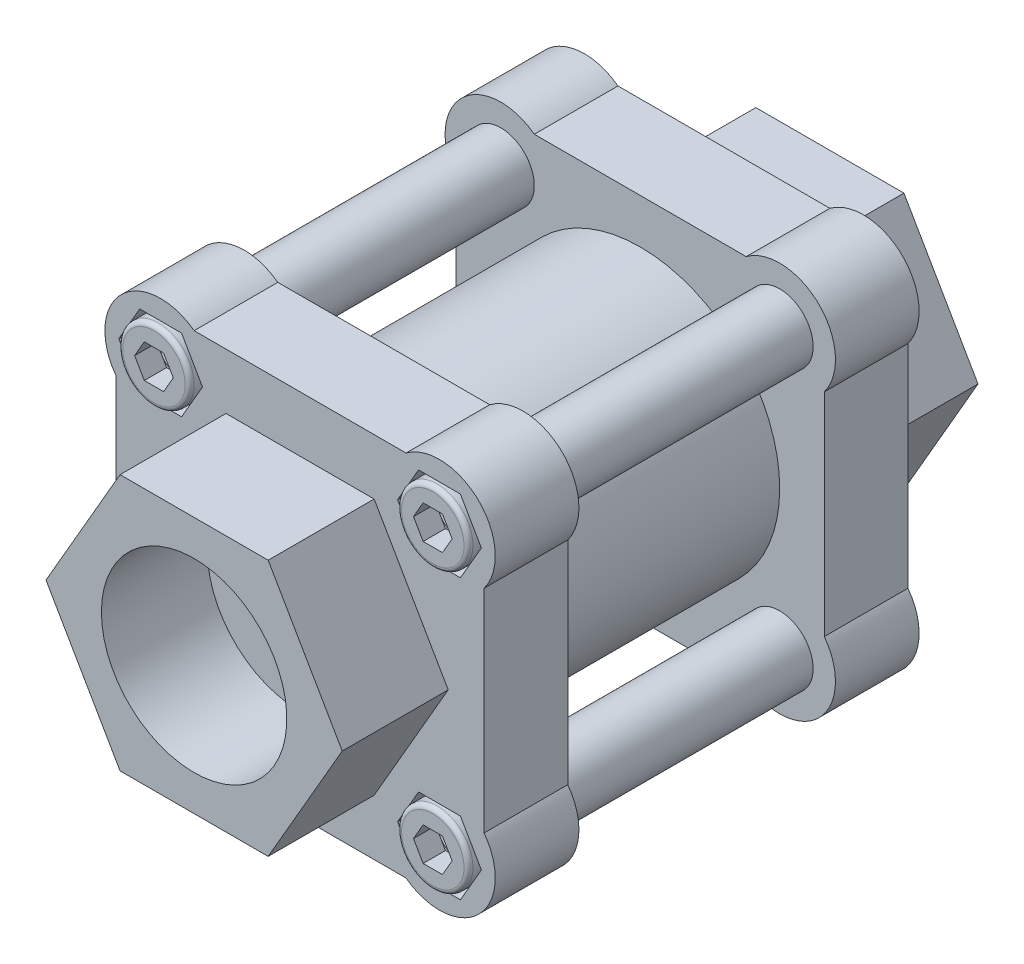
ISO-10303-21;
HEADER;
FILE_DESCRIPTION(('STEP AP214'),'2;1');
FILE_NAME('part.step','',(''),(''),'','','');
FILE_SCHEMA(('AUTOMOTIVE_DESIGN { 1 0 10303 214 1 1 1 1 }'));
ENDSEC;
DATA;
#1=APPLICATION_CONTEXT('core data for automotive mechanical design processes');
#2=APPLICATION_PROTOCOL_DEFINITION('international standard','automotive_design',2000,#1);
#3=PRODUCT_CONTEXT('',#1,'mechanical');
#4=PRODUCT('Part','Part','',(#3));
#5=PRODUCT_RELATED_PRODUCT_CATEGORY('part','',(#4));
#6=PRODUCT_DEFINITION_FORMATION('','',#4);
#7=PRODUCT_DEFINITION_CONTEXT('part definition',#1,'design');
#8=PRODUCT_DEFINITION('design','',#6,#7);
#9=PRODUCT_DEFINITION_SHAPE('','',#8);
#10=(LENGTH_UNIT() NAMED_UNIT(*) SI_UNIT(.MILLI.,.METRE.));
#11=(NAMED_UNIT(*) PLANE_ANGLE_UNIT() SI_UNIT($,.RADIAN.));
#12=(NAMED_UNIT(*) SI_UNIT($,.STERADIAN.) SOLID_ANGLE_UNIT());
#13=UNCERTAINTY_MEASURE_WITH_UNIT(LENGTH_MEASURE(1.E-05),#10,'distance_accuracy_value','');
#14=(GEOMETRIC_REPRESENTATION_CONTEXT(3) GLOBAL_UNCERTAINTY_ASSIGNED_CONTEXT((#13)) GLOBAL_UNIT_ASSIGNED_CONTEXT((#10,
#11,#12)) REPRESENTATION_CONTEXT('',''));
#15=CARTESIAN_POINT('',(0.,0.,0.));
#16=DIRECTION('',(0.,0.,1.));
#17=DIRECTION('',(1.,0.,0.));
#18=AXIS2_PLACEMENT_3D('',#15,#16,#17);
#19=CARTESIAN_POINT('',(25.,-28.,96.2));
#20=DIRECTION('',(0.,0.,-1.));
#21=DIRECTION('',(1.,0.,0.));
#22=AXIS2_PLACEMENT_3D('',#19,#20,#21);
#23=PLANE('',#22);
#24=CARTESIAN_POINT('',(25.,-25.,96.2));
#25=DIRECTION('',(0.,0.,-1.));
#26=DIRECTION('',(1.,0.,0.));
#27=AXIS2_PLACEMENT_3D('',#24,#25,#26);
#28=CIRCLE('',#27,5.6);
#29=CARTESIAN_POINT('',(30.6,-25.,96.2));
#30=VERTEX_POINT('',#29);
#31=EDGE_CURVE('E918',#30,#30,#28,.T.);
#32=ORIENTED_EDGE('',*,*,#31,.F.);
#33=EDGE_LOOP('',(#32));
#34=FACE_BOUND('',#33,.T.);
#35=DIRECTION('',(-1.,0.,0.));
#36=VECTOR('',#35,1.);
#37=CARTESIAN_POINT('',(25.,-22.,96.2));
#38=LINE('',#37,#36);
#39=CARTESIAN_POINT('',(26.7320508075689,-22.,96.2));
#40=VERTEX_POINT('',#39);
#41=CARTESIAN_POINT('',(23.2679491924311,-22.,96.2));
#42=VERTEX_POINT('',#41);
#43=EDGE_CURVE('E9',#40,#42,#38,.T.);
#44=ORIENTED_EDGE('',*,*,#43,.F.);
#45=DIRECTION('',(-0.5,0.866025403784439,0.));
#46=VECTOR('',#45,1.);
#47=CARTESIAN_POINT('',(28.89711431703,-25.75,96.2));
#48=LINE('',#47,#46);
#49=CARTESIAN_POINT('',(28.4641016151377,-25.,96.2));
#50=VERTEX_POINT('',#49);
#51=EDGE_CURVE('E1721',#50,#40,#48,.T.);
#52=ORIENTED_EDGE('',*,*,#51,.F.);
#53=DIRECTION('',(0.5,0.866025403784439,0.));
#54=VECTOR('',#53,1.);
#55=CARTESIAN_POINT('',(26.2990381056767,-28.75,96.2));
#56=LINE('',#55,#54);
#57=CARTESIAN_POINT('',(26.7320508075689,-28.,96.2));
#58=VERTEX_POINT('',#57);
#59=EDGE_CURVE('E1724',#58,#50,#56,.T.);
#60=ORIENTED_EDGE('',*,*,#59,.F.);
#61=DIRECTION('',(1.,0.,0.));
#62=VECTOR('',#61,1.);
#63=CARTESIAN_POINT('',(25.,-28.,96.2));
#64=LINE('',#63,#62);
#65=CARTESIAN_POINT('',(23.2679491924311,-28.,96.2));
#66=VERTEX_POINT('',#65);
#67=EDGE_CURVE('E1727',#66,#58,#64,.T.);
#68=ORIENTED_EDGE('',*,*,#67,.F.);
#69=DIRECTION('',(0.5,-0.866025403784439,0.));
#70=VECTOR('',#69,1.);
#71=CARTESIAN_POINT('',(23.7009618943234,-28.75,96.2));
#72=LINE('',#71,#70);
#73=CARTESIAN_POINT('',(21.5358983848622,-25.,96.2));
#74=VERTEX_POINT('',#73);
#75=EDGE_CURVE('E1730',#74,#66,#72,.T.);
#76=ORIENTED_EDGE('',*,*,#75,.F.);
#77=DIRECTION('',(-0.5,-0.866025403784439,0.));
#78=VECTOR('',#77,1.);
#79=CARTESIAN_POINT('',(21.1028856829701,-25.75,96.2));
#80=LINE('',#79,#78);
#81=EDGE_CURVE('E22',#42,#74,#80,.T.);
#82=ORIENTED_EDGE('',*,*,#81,.F.);
#83=EDGE_LOOP('',(#44,#52,#60,#68,#76,#82));
#84=FACE_BOUND('',#83,.T.);
#85=ADVANCED_FACE('F14',(#34,#84),#23,.F.);
#86=CARTESIAN_POINT('',(25.,22.,96.2));
#87=DIRECTION('',(0.,0.,-1.));
#88=DIRECTION('',(1.,0.,0.));
#89=AXIS2_PLACEMENT_3D('',#86,#87,#88);
#90=PLANE('',#89);
#91=CARTESIAN_POINT('',(25.,25.,96.2));
#92=DIRECTION('',(0.,0.,-1.));
#93=DIRECTION('',(1.,0.,0.));
#94=AXIS2_PLACEMENT_3D('',#91,#92,#93);
#95=CIRCLE('',#94,5.6);
#96=CARTESIAN_POINT('',(30.6,25.,96.2));
#97=VERTEX_POINT('',#96);
#98=EDGE_CURVE('E967',#97,#97,#95,.T.);
#99=ORIENTED_EDGE('',*,*,#98,.F.);
#100=EDGE_LOOP('',(#99));
#101=FACE_BOUND('',#100,.T.);
#102=DIRECTION('',(-1.,0.,0.));
#103=VECTOR('',#102,1.);
#104=CARTESIAN_POINT('',(25.,28.,96.2));
#105=LINE('',#104,#103);
#106=CARTESIAN_POINT('',(26.7320508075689,28.,96.2));
#107=VERTEX_POINT('',#106);
#108=CARTESIAN_POINT('',(23.2679491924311,28.,96.2));
#109=VERTEX_POINT('',#108);
#110=EDGE_CURVE('E1718',#107,#109,#105,.T.);
#111=ORIENTED_EDGE('',*,*,#110,.F.);
#112=DIRECTION('',(-0.5,0.866025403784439,0.));
#113=VECTOR('',#112,1.);
#114=CARTESIAN_POINT('',(28.89711431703,24.25,96.2));
#115=LINE('',#114,#113);
#116=CARTESIAN_POINT('',(28.4641016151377,25.,96.2));
#117=VERTEX_POINT('',#116);
#118=EDGE_CURVE('E1703',#117,#107,#115,.T.);
#119=ORIENTED_EDGE('',*,*,#118,.F.);
#120=DIRECTION('',(0.5,0.866025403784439,0.));
#121=VECTOR('',#120,1.);
#122=CARTESIAN_POINT('',(26.2990381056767,21.25,96.2));
#123=LINE('',#122,#121);
#124=CARTESIAN_POINT('',(26.7320508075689,22.,96.2));
#125=VERTEX_POINT('',#124);
#126=EDGE_CURVE('E1706',#125,#117,#123,.T.);
#127=ORIENTED_EDGE('',*,*,#126,.F.);
#128=DIRECTION('',(1.,0.,0.));
#129=VECTOR('',#128,1.);
#130=CARTESIAN_POINT('',(25.,22.,96.2));
#131=LINE('',#130,#129);
#132=CARTESIAN_POINT('',(23.2679491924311,22.,96.2));
#133=VERTEX_POINT('',#132);
#134=EDGE_CURVE('E1709',#133,#125,#131,.T.);
#135=ORIENTED_EDGE('',*,*,#134,.F.);
#136=DIRECTION('',(0.5,-0.866025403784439,0.));
#137=VECTOR('',#136,1.);
#138=CARTESIAN_POINT('',(23.7009618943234,21.25,96.2));
#139=LINE('',#138,#137);
#140=CARTESIAN_POINT('',(21.5358983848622,25.,96.2));
#141=VERTEX_POINT('',#140);
#142=EDGE_CURVE('E1712',#141,#133,#139,.T.);
#143=ORIENTED_EDGE('',*,*,#142,.F.);
#144=DIRECTION('',(-0.5,-0.866025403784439,0.));
#145=VECTOR('',#144,1.);
#146=CARTESIAN_POINT('',(21.1028856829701,24.25,96.2));
#147=LINE('',#146,#145);
#148=EDGE_CURVE('E1715',#109,#141,#147,.T.);
#149=ORIENTED_EDGE('',*,*,#148,.F.);
#150=EDGE_LOOP('',(#111,#119,#127,#135,#143,#149));
#151=FACE_BOUND('',#150,.T.);
#152=ADVANCED_FACE('F1782',(#101,#151),#90,.F.);
#153=CARTESIAN_POINT('',(-25.,-28.,96.2));
#154=DIRECTION('',(0.,0.,-1.));
#155=DIRECTION('',(1.,0.,0.));
#156=AXIS2_PLACEMENT_3D('',#153,#154,#155);
#157=PLANE('',#156);
#158=CARTESIAN_POINT('',(-25.,-25.,96.2));
#159=DIRECTION('',(0.,0.,-1.));
#160=DIRECTION('',(1.,0.,0.));
#161=AXIS2_PLACEMENT_3D('',#158,#159,#160);
#162=CIRCLE('',#161,5.6);
#163=CARTESIAN_POINT('',(-19.4,-25.,96.2));
#164=VERTEX_POINT('',#163);
#165=EDGE_CURVE('E1015',#164,#164,#162,.T.);
#166=ORIENTED_EDGE('',*,*,#165,.F.);
#167=EDGE_LOOP('',(#166));
#168=FACE_BOUND('',#167,.T.);
#169=DIRECTION('',(-1.,0.,0.));
#170=VECTOR('',#169,1.);
#171=CARTESIAN_POINT('',(-25.,-22.,96.2));
#172=LINE('',#171,#170);
#173=CARTESIAN_POINT('',(-23.2679491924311,-22.,96.2));
#174=VERTEX_POINT('',#173);
#175=CARTESIAN_POINT('',(-26.7320508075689,-22.,96.2));
#176=VERTEX_POINT('',#175);
#177=EDGE_CURVE('E1700',#174,#176,#172,.T.);
#178=ORIENTED_EDGE('',*,*,#177,.F.);
#179=DIRECTION('',(-0.5,0.866025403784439,0.));
#180=VECTOR('',#179,1.);
#181=CARTESIAN_POINT('',(-21.1028856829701,-25.75,96.2));
#182=LINE('',#181,#180);
#183=CARTESIAN_POINT('',(-21.5358983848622,-25.,96.2));
#184=VERTEX_POINT('',#183);
#185=EDGE_CURVE('E1685',#184,#174,#182,.T.);
#186=ORIENTED_EDGE('',*,*,#185,.F.);
#187=DIRECTION('',(0.5,0.866025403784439,0.));
#188=VECTOR('',#187,1.);
#189=CARTESIAN_POINT('',(-23.7009618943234,-28.75,96.2));
#190=LINE('',#189,#188);
#191=CARTESIAN_POINT('',(-23.2679491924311,-28.,96.2));
#192=VERTEX_POINT('',#191);
#193=EDGE_CURVE('E1688',#192,#184,#190,.T.);
#194=ORIENTED_EDGE('',*,*,#193,.F.);
#195=DIRECTION('',(1.,0.,0.));
#196=VECTOR('',#195,1.);
#197=CARTESIAN_POINT('',(-25.,-28.,96.2));
#198=LINE('',#197,#196);
#199=CARTESIAN_POINT('',(-26.7320508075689,-28.,96.2));
#200=VERTEX_POINT('',#199);
#201=EDGE_CURVE('E1691',#200,#192,#198,.T.);
#202=ORIENTED_EDGE('',*,*,#201,.F.);
#203=DIRECTION('',(0.5,-0.866025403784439,0.));
#204=VECTOR('',#203,1.);
#205=CARTESIAN_POINT('',(-26.2990381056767,-28.75,96.2));
#206=LINE('',#205,#204);
#207=CARTESIAN_POINT('',(-28.4641016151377,-25.,96.2));
#208=VERTEX_POINT('',#207);
#209=EDGE_CURVE('E1694',#208,#200,#206,.T.);
#210=ORIENTED_EDGE('',*,*,#209,.F.);
#211=DIRECTION('',(-0.5,-0.866025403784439,0.));
#212=VECTOR('',#211,1.);
#213=CARTESIAN_POINT('',(-28.89711431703,-25.75,96.2));
#214=LINE('',#213,#212);
#215=EDGE_CURVE('E1697',#176,#208,#214,.T.);
#216=ORIENTED_EDGE('',*,*,#215,.F.);
#217=EDGE_LOOP('',(#178,#186,#194,#202,#210,#216));
#218=FACE_BOUND('',#217,.T.);
#219=ADVANCED_FACE('F1788',(#168,#218),#157,.F.);
#220=CARTESIAN_POINT('',(-25.,22.,96.2));
#221=DIRECTION('',(0.,0.,-1.));
#222=DIRECTION('',(1.,0.,0.));
#223=AXIS2_PLACEMENT_3D('',#220,#221,#222);
#224=PLANE('',#223);
#225=CARTESIAN_POINT('',(-25.,25.,96.2));
#226=DIRECTION('',(0.,0.,-1.));
#227=DIRECTION('',(1.,0.,0.));
#228=AXIS2_PLACEMENT_3D('',#225,#226,#227);
#229=CIRCLE('',#228,5.6);
#230=CARTESIAN_POINT('',(-19.4,25.,96.2));
#231=VERTEX_POINT('',#230);
#232=EDGE_CURVE('E1063',#231,#231,#229,.T.);
#233=ORIENTED_EDGE('',*,*,#232,.F.);
#234=EDGE_LOOP('',(#233));
#235=FACE_BOUND('',#234,.T.);
#236=DIRECTION('',(-1.,0.,0.));
#237=VECTOR('',#236,1.);
#238=CARTESIAN_POINT('',(-25.,28.,96.2));
#239=LINE('',#238,#237);
#240=CARTESIAN_POINT('',(-23.2679491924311,28.,96.2));
#241=VERTEX_POINT('',#240);
#242=CARTESIAN_POINT('',(-26.7320508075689,28.,96.2));
#243=VERTEX_POINT('',#242);
#244=EDGE_CURVE('E1682',#241,#243,#239,.T.);
#245=ORIENTED_EDGE('',*,*,#244,.F.);
#246=DIRECTION('',(-0.5,0.866025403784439,0.));
#247=VECTOR('',#246,1.);
#248=CARTESIAN_POINT('',(-21.1028856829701,24.25,96.2));
#249=LINE('',#248,#247);
#250=CARTESIAN_POINT('',(-21.5358983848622,25.,96.2));
#251=VERTEX_POINT('',#250);
#252=EDGE_CURVE('E936',#251,#241,#249,.T.);
#253=ORIENTED_EDGE('',*,*,#252,.F.);
#254=DIRECTION('',(0.5,0.866025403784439,0.));
#255=VECTOR('',#254,1.);
#256=CARTESIAN_POINT('',(-23.7009618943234,21.25,96.2));
#257=LINE('',#256,#255);
#258=CARTESIAN_POINT('',(-23.2679491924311,22.,96.2));
#259=VERTEX_POINT('',#258);
#260=EDGE_CURVE('E1670',#259,#251,#257,.T.);
#261=ORIENTED_EDGE('',*,*,#260,.F.);
#262=DIRECTION('',(1.,0.,0.));
#263=VECTOR('',#262,1.);
#264=CARTESIAN_POINT('',(-25.,22.,96.2));
#265=LINE('',#264,#263);
#266=CARTESIAN_POINT('',(-26.7320508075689,22.,96.2));
#267=VERTEX_POINT('',#266);
#268=EDGE_CURVE('E1673',#267,#259,#265,.T.);
#269=ORIENTED_EDGE('',*,*,#268,.F.);
#270=DIRECTION('',(0.5,-0.866025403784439,0.));
#271=VECTOR('',#270,1.);
#272=CARTESIAN_POINT('',(-26.2990381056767,21.25,96.2));
#273=LINE('',#272,#271);
#274=CARTESIAN_POINT('',(-28.4641016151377,25.,96.2));
#275=VERTEX_POINT('',#274);
#276=EDGE_CURVE('E1676',#275,#267,#273,.T.);
#277=ORIENTED_EDGE('',*,*,#276,.F.);
#278=DIRECTION('',(-0.5,-0.866025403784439,0.));
#279=VECTOR('',#278,1.);
#280=CARTESIAN_POINT('',(-28.89711431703,24.25,96.2));
#281=LINE('',#280,#279);
#282=EDGE_CURVE('E1679',#243,#275,#281,.T.);
#283=ORIENTED_EDGE('',*,*,#282,.F.);
#284=EDGE_LOOP('',(#245,#253,#261,#269,#277,#283));
#285=FACE_BOUND('',#284,.T.);
#286=ADVANCED_FACE('F1898',(#235,#285),#224,.F.);
#287=CARTESIAN_POINT('',(-25.,25.,19.));
#288=DIRECTION('',(0.,0.,1.));
#289=DIRECTION('',(-1.,0.,0.));
#290=AXIS2_PLACEMENT_3D('',#287,#288,#289);
#291=PLANE('',#290);
#292=DIRECTION('',(-1.,0.,0.));
#293=VECTOR('',#292,1.);
#294=CARTESIAN_POINT('',(28.7527767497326,31.5,19.));
#295=LINE('',#294,#293);
#296=CARTESIAN_POINT('',(28.7527767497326,31.5,19.));
#297=VERTEX_POINT('',#296);
#298=CARTESIAN_POINT('',(21.2472232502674,31.5,19.));
#299=VERTEX_POINT('',#298);
#300=EDGE_CURVE('E1126',#297,#299,#295,.T.);
#301=ORIENTED_EDGE('',*,*,#300,.T.);
#302=DIRECTION('',(-0.5,-0.866025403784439,0.));
#303=VECTOR('',#302,1.);
#304=CARTESIAN_POINT('',(21.2472232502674,31.5,19.));
#305=LINE('',#304,#303);
#306=CARTESIAN_POINT('',(17.4944465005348,25.,19.));
#307=VERTEX_POINT('',#306);
#308=EDGE_CURVE('E1144',#299,#307,#305,.T.);
#309=ORIENTED_EDGE('',*,*,#308,.T.);
#310=DIRECTION('',(0.5,-0.866025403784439,0.));
#311=VECTOR('',#310,1.);
#312=CARTESIAN_POINT('',(17.4944465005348,25.,19.));
#313=LINE('',#312,#311);
#314=CARTESIAN_POINT('',(21.2472232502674,18.5,19.));
#315=VERTEX_POINT('',#314);
#316=EDGE_CURVE('E1147',#307,#315,#313,.T.);
#317=ORIENTED_EDGE('',*,*,#316,.T.);
#318=DIRECTION('',(1.,0.,0.));
#319=VECTOR('',#318,1.);
#320=CARTESIAN_POINT('',(21.2472232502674,18.5,19.));
#321=LINE('',#320,#319);
#322=CARTESIAN_POINT('',(28.7527767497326,18.5,19.));
#323=VERTEX_POINT('',#322);
#324=EDGE_CURVE('E1150',#315,#323,#321,.T.);
#325=ORIENTED_EDGE('',*,*,#324,.T.);
#326=DIRECTION('',(0.5,0.866025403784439,0.));
#327=VECTOR('',#326,1.);
#328=CARTESIAN_POINT('',(28.7527767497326,18.5,19.));
#329=LINE('',#328,#327);
#330=CARTESIAN_POINT('',(32.5055534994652,25.,19.));
#331=VERTEX_POINT('',#330);
#332=EDGE_CURVE('E1153',#323,#331,#329,.T.);
#333=ORIENTED_EDGE('',*,*,#332,.T.);
#334=DIRECTION('',(-0.5,0.866025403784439,0.));
#335=VECTOR('',#334,1.);
#336=CARTESIAN_POINT('',(32.5055534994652,25.,19.));
#337=LINE('',#336,#335);
#338=EDGE_CURVE('E1131',#331,#297,#337,.T.);
#339=ORIENTED_EDGE('',*,*,#338,.T.);
#340=EDGE_LOOP('',(#301,#309,#317,#325,#333,#339));
#341=FACE_BOUND('',#340,.T.);
#342=DIRECTION('',(-1.,0.,0.));
#343=VECTOR('',#342,1.);
#344=CARTESIAN_POINT('',(-21.2472232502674,31.5,19.));
#345=LINE('',#344,#343);
#346=CARTESIAN_POINT('',(-21.2472232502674,31.5,19.));
#347=VERTEX_POINT('',#346);
#348=CARTESIAN_POINT('',(-28.7527767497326,31.5,19.));
#349=VERTEX_POINT('',#348);
#350=EDGE_CURVE('E1216',#347,#349,#345,.T.);
#351=ORIENTED_EDGE('',*,*,#350,.T.);
#352=DIRECTION('',(-0.5,-0.866025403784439,0.));
#353=VECTOR('',#352,1.);
#354=CARTESIAN_POINT('',(-28.7527767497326,31.5,19.));
#355=LINE('',#354,#353);
#356=CARTESIAN_POINT('',(-32.5055534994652,25.,19.));
#357=VERTEX_POINT('',#356);
#358=EDGE_CURVE('E1234',#349,#357,#355,.T.);
#359=ORIENTED_EDGE('',*,*,#358,.T.);
#360=DIRECTION('',(0.5,-0.866025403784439,0.));
#361=VECTOR('',#360,1.);
#362=CARTESIAN_POINT('',(-32.5055534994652,25.,19.));
#363=LINE('',#362,#361);
#364=CARTESIAN_POINT('',(-28.7527767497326,18.5,19.));
#365=VERTEX_POINT('',#364);
#366=EDGE_CURVE('E1237',#357,#365,#363,.T.);
#367=ORIENTED_EDGE('',*,*,#366,.T.);
#368=DIRECTION('',(1.,0.,0.));
#369=VECTOR('',#368,1.);
#370=CARTESIAN_POINT('',(-28.7527767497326,18.5,19.));
#371=LINE('',#370,#369);
#372=CARTESIAN_POINT('',(-21.2472232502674,18.5,19.));
#373=VERTEX_POINT('',#372);
#374=EDGE_CURVE('E1240',#365,#373,#371,.T.);
#375=ORIENTED_EDGE('',*,*,#374,.T.);
#376=DIRECTION('',(0.5,0.866025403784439,0.));
#377=VECTOR('',#376,1.);
#378=CARTESIAN_POINT('',(-21.2472232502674,18.5,19.));
#379=LINE('',#378,#377);
#380=CARTESIAN_POINT('',(-17.4944465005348,25.,19.));
#381=VERTEX_POINT('',#380);
#382=EDGE_CURVE('E1243',#373,#381,#379,.T.);
#383=ORIENTED_EDGE('',*,*,#382,.T.);
#384=DIRECTION('',(-0.5,0.866025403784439,0.));
#385=VECTOR('',#384,1.);
#386=CARTESIAN_POINT('',(-17.4944465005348,25.,19.));
#387=LINE('',#386,#385);
#388=EDGE_CURVE('E1221',#381,#347,#387,.T.);
#389=ORIENTED_EDGE('',*,*,#388,.T.);
#390=EDGE_LOOP('',(#351,#359,#367,#375,#383,#389));
#391=FACE_BOUND('',#390,.T.);
#392=DIRECTION('',(-1.,0.,0.));
#393=VECTOR('',#392,1.);
#394=CARTESIAN_POINT('',(19.,33.,19.));
#395=LINE('',#394,#393);
#396=CARTESIAN_POINT('',(19.,33.,19.));
#397=VERTEX_POINT('',#396);
#398=CARTESIAN_POINT('',(-19.,33.,19.));
#399=VERTEX_POINT('',#398);
#400=EDGE_CURVE('E1564',#397,#399,#395,.T.);
#401=ORIENTED_EDGE('',*,*,#400,.F.);
#402=CARTESIAN_POINT('',(25.,25.,19.));
#403=DIRECTION('',(0.,0.,1.));
#404=DIRECTION('',(0.,-1.,0.));
#405=AXIS2_PLACEMENT_3D('',#402,#403,#404);
#406=CIRCLE('',#405,10.);
#407=CARTESIAN_POINT('',(33.,19.,19.));
#408=VERTEX_POINT('',#407);
#409=EDGE_CURVE('E1569',#408,#397,#406,.T.);
#410=ORIENTED_EDGE('',*,*,#409,.F.);
#411=DIRECTION('',(0.,1.,0.));
#412=VECTOR('',#411,1.);
#413=CARTESIAN_POINT('',(33.,-19.,19.));
#414=LINE('',#413,#412);
#415=CARTESIAN_POINT('',(33.,-19.,19.));
#416=VERTEX_POINT('',#415);
#417=EDGE_CURVE('E1601',#416,#408,#414,.T.);
#418=ORIENTED_EDGE('',*,*,#417,.F.);
#419=CARTESIAN_POINT('',(25.,-25.,19.));
#420=DIRECTION('',(0.,0.,1.));
#421=DIRECTION('',(0.,-1.,0.));
#422=AXIS2_PLACEMENT_3D('',#419,#420,#421);
#423=CIRCLE('',#422,10.);
#424=CARTESIAN_POINT('',(19.,-33.,19.));
#425=VERTEX_POINT('',#424);
#426=EDGE_CURVE('E1598',#425,#416,#423,.T.);
#427=ORIENTED_EDGE('',*,*,#426,.F.);
#428=DIRECTION('',(1.,0.,0.));
#429=VECTOR('',#428,1.);
#430=CARTESIAN_POINT('',(-19.,-33.,19.));
#431=LINE('',#430,#429);
#432=CARTESIAN_POINT('',(-19.,-33.,19.));
#433=VERTEX_POINT('',#432);
#434=EDGE_CURVE('E1595',#433,#425,#431,.T.);
#435=ORIENTED_EDGE('',*,*,#434,.F.);
#436=CARTESIAN_POINT('',(-25.,-25.,19.));
#437=DIRECTION('',(0.,0.,1.));
#438=DIRECTION('',(0.,-1.,0.));
#439=AXIS2_PLACEMENT_3D('',#436,#437,#438);
#440=CIRCLE('',#439,10.);
#441=CARTESIAN_POINT('',(-33.,-19.,19.));
#442=VERTEX_POINT('',#441);
#443=EDGE_CURVE('E1592',#442,#433,#440,.T.);
#444=ORIENTED_EDGE('',*,*,#443,.F.);
#445=DIRECTION('',(0.,-1.,0.));
#446=VECTOR('',#445,1.);
#447=CARTESIAN_POINT('',(-33.,19.,19.));
#448=LINE('',#447,#446);
#449=CARTESIAN_POINT('',(-33.,19.,19.));
#450=VERTEX_POINT('',#449);
#451=EDGE_CURVE('E1589',#450,#442,#448,.T.);
#452=ORIENTED_EDGE('',*,*,#451,.F.);
#453=CARTESIAN_POINT('',(-25.,25.,19.));
#454=DIRECTION('',(0.,0.,1.));
#455=DIRECTION('',(0.,-1.,0.));
#456=AXIS2_PLACEMENT_3D('',#453,#454,#455);
#457=CIRCLE('',#456,10.);
#458=EDGE_CURVE('E1586',#399,#450,#457,.T.);
#459=ORIENTED_EDGE('',*,*,#458,.F.);
#460=EDGE_LOOP('',(#401,#410,#418,#427,#435,#444,#452,#459));
#461=FACE_BOUND('',#460,.T.);
#462=DIRECTION('',(1.,0.,0.));
#463=VECTOR('',#462,1.);
#464=CARTESIAN_POINT('',(-25.,23.,19.));
#465=LINE('',#464,#463);
#466=CARTESIAN_POINT('',(-13.2790561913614,23.,19.));
#467=VERTEX_POINT('',#466);
#468=CARTESIAN_POINT('',(13.2790561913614,23.,19.));
#469=VERTEX_POINT('',#468);
#470=EDGE_CURVE('E1652',#467,#469,#465,.T.);
#471=ORIENTED_EDGE('',*,*,#470,.F.);
#472=DIRECTION('',(0.5,0.866025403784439,0.));
#473=VECTOR('',#472,1.);
#474=CARTESIAN_POINT('',(-15.3432667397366,19.4246824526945,19.));
#475=LINE('',#474,#473);
#476=CARTESIAN_POINT('',(-26.5581123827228,0.,19.));
#477=VERTEX_POINT('',#476);
#478=EDGE_CURVE('E1649',#477,#467,#475,.T.);
#479=ORIENTED_EDGE('',*,*,#478,.F.);
#480=DIRECTION('',(-0.5,0.866025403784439,0.));
#481=VECTOR('',#480,1.);
#482=CARTESIAN_POINT('',(-36.9939018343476,18.0753175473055,19.));
#483=LINE('',#482,#481);
#484=CARTESIAN_POINT('',(-13.2790561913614,-23.,19.));
#485=VERTEX_POINT('',#484);
#486=EDGE_CURVE('E1646',#485,#477,#483,.T.);
#487=ORIENTED_EDGE('',*,*,#486,.F.);
#488=DIRECTION('',(-1.,0.,0.));
#489=VECTOR('',#488,1.);
#490=CARTESIAN_POINT('',(-25.,-23.,19.));
#491=LINE('',#490,#489);
#492=CARTESIAN_POINT('',(13.2790561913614,-23.,19.));
#493=VERTEX_POINT('',#492);
#494=EDGE_CURVE('E1643',#493,#485,#491,.T.);
#495=ORIENTED_EDGE('',*,*,#494,.F.);
#496=DIRECTION('',(-0.5,-0.866025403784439,0.));
#497=VECTOR('',#496,1.);
#498=CARTESIAN_POINT('',(24.4939018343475,-3.57531754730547,19.));
#499=LINE('',#498,#497);
#500=CARTESIAN_POINT('',(26.5581123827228,0.,19.));
#501=VERTEX_POINT('',#500);
#502=EDGE_CURVE('E1640',#501,#493,#499,.T.);
#503=ORIENTED_EDGE('',*,*,#502,.F.);
#504=DIRECTION('',(0.5,-0.866025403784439,0.));
#505=VECTOR('',#504,1.);
#506=CARTESIAN_POINT('',(2.84326673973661,41.0753175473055,19.));
#507=LINE('',#506,#505);
#508=EDGE_CURVE('E1637',#469,#501,#507,.T.);
#509=ORIENTED_EDGE('',*,*,#508,.F.);
#510=EDGE_LOOP('',(#471,#479,#487,#495,#503,#509));
#511=FACE_BOUND('',#510,.T.);
#512=DIRECTION('',(-1.,0.,0.));
#513=VECTOR('',#512,1.);
#514=CARTESIAN_POINT('',(-21.2472232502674,-18.5,19.));
#515=LINE('',#514,#513);
#516=CARTESIAN_POINT('',(-21.2472232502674,-18.5,19.));
#517=VERTEX_POINT('',#516);
#518=CARTESIAN_POINT('',(-28.7527767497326,-18.5,19.));
#519=VERTEX_POINT('',#518);
#520=EDGE_CURVE('E1171',#517,#519,#515,.T.);
#521=ORIENTED_EDGE('',*,*,#520,.T.);
#522=DIRECTION('',(-0.5,-0.866025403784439,0.));
#523=VECTOR('',#522,1.);
#524=CARTESIAN_POINT('',(-28.7527767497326,-18.5,19.));
#525=LINE('',#524,#523);
#526=CARTESIAN_POINT('',(-32.5055534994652,-25.,19.));
#527=VERTEX_POINT('',#526);
#528=EDGE_CURVE('E1189',#519,#527,#525,.T.);
#529=ORIENTED_EDGE('',*,*,#528,.T.);
#530=DIRECTION('',(0.5,-0.866025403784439,0.));
#531=VECTOR('',#530,1.);
#532=CARTESIAN_POINT('',(-32.5055534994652,-25.,19.));
#533=LINE('',#532,#531);
#534=CARTESIAN_POINT('',(-28.7527767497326,-31.5,19.));
#535=VERTEX_POINT('',#534);
#536=EDGE_CURVE('E1192',#527,#535,#533,.T.);
#537=ORIENTED_EDGE('',*,*,#536,.T.);
#538=DIRECTION('',(1.,0.,0.));
#539=VECTOR('',#538,1.);
#540=CARTESIAN_POINT('',(-28.7527767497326,-31.5,19.));
#541=LINE('',#540,#539);
#542=CARTESIAN_POINT('',(-21.2472232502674,-31.5,19.));
#543=VERTEX_POINT('',#542);
#544=EDGE_CURVE('E1195',#535,#543,#541,.T.);
#545=ORIENTED_EDGE('',*,*,#544,.T.);
#546=DIRECTION('',(0.5,0.866025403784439,0.));
#547=VECTOR('',#546,1.);
#548=CARTESIAN_POINT('',(-21.2472232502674,-31.5,19.));
#549=LINE('',#548,#547);
#550=CARTESIAN_POINT('',(-17.4944465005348,-25.,19.));
#551=VERTEX_POINT('',#550);
#552=EDGE_CURVE('E1198',#543,#551,#549,.T.);
#553=ORIENTED_EDGE('',*,*,#552,.T.);
#554=DIRECTION('',(-0.5,0.866025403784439,0.));
#555=VECTOR('',#554,1.);
#556=CARTESIAN_POINT('',(-17.4944465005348,-25.,19.));
#557=LINE('',#556,#555);
#558=EDGE_CURVE('E1176',#551,#517,#557,.T.);
#559=ORIENTED_EDGE('',*,*,#558,.T.);
#560=EDGE_LOOP('',(#521,#529,#537,#545,#553,#559));
#561=FACE_BOUND('',#560,.T.);
#562=DIRECTION('',(-1.,0.,0.));
#563=VECTOR('',#562,1.);
#564=CARTESIAN_POINT('',(28.7527767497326,-18.5,19.));
#565=LINE('',#564,#563);
#566=CARTESIAN_POINT('',(28.7527767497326,-18.5,19.));
#567=VERTEX_POINT('',#566);
#568=CARTESIAN_POINT('',(21.2472232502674,-18.5,19.));
#569=VERTEX_POINT('',#568);
#570=EDGE_CURVE('E1077',#567,#569,#565,.T.);
#571=ORIENTED_EDGE('',*,*,#570,.T.);
#572=DIRECTION('',(-0.5,-0.866025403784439,0.));
#573=VECTOR('',#572,1.);
#574=CARTESIAN_POINT('',(21.2472232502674,-18.5,19.));
#575=LINE('',#574,#573);
#576=CARTESIAN_POINT('',(17.4944465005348,-25.,19.));
#577=VERTEX_POINT('',#576);
#578=EDGE_CURVE('E1099',#569,#577,#575,.T.);
#579=ORIENTED_EDGE('',*,*,#578,.T.);
#580=DIRECTION('',(0.5,-0.866025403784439,0.));
#581=VECTOR('',#580,1.);
#582=CARTESIAN_POINT('',(17.4944465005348,-25.,19.));
#583=LINE('',#582,#581);
#584=CARTESIAN_POINT('',(21.2472232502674,-31.5,19.));
#585=VERTEX_POINT('',#584);
#586=EDGE_CURVE('E1102',#577,#585,#583,.T.);
#587=ORIENTED_EDGE('',*,*,#586,.T.);
#588=DIRECTION('',(1.,0.,0.));
#589=VECTOR('',#588,1.);
#590=CARTESIAN_POINT('',(21.2472232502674,-31.5,19.));
#591=LINE('',#590,#589);
#592=CARTESIAN_POINT('',(28.7527767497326,-31.5,19.));
#593=VERTEX_POINT('',#592);
#594=EDGE_CURVE('E1105',#585,#593,#591,.T.);
#595=ORIENTED_EDGE('',*,*,#594,.T.);
#596=DIRECTION('',(0.5,0.866025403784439,0.));
#597=VECTOR('',#596,1.);
#598=CARTESIAN_POINT('',(28.7527767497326,-31.5,19.));
#599=LINE('',#598,#597);
#600=CARTESIAN_POINT('',(32.5055534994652,-25.,19.));
#601=VERTEX_POINT('',#600);
#602=EDGE_CURVE('E1108',#593,#601,#599,.T.);
#603=ORIENTED_EDGE('',*,*,#602,.T.);
#604=DIRECTION('',(-0.5,0.866025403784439,0.));
#605=VECTOR('',#604,1.);
#606=CARTESIAN_POINT('',(32.5055534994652,-25.,19.));
#607=LINE('',#606,#605);
#608=EDGE_CURVE('E1086',#601,#567,#607,.T.);
#609=ORIENTED_EDGE('',*,*,#608,.T.);
#610=EDGE_LOOP('',(#571,#579,#587,#595,#603,#609));
#611=FACE_BOUND('',#610,.T.);
#612=ADVANCED_FACE('F1954',(#341,#391,#461,#511,#561,#611),#291,.F.);
#613=CARTESIAN_POINT('',(-25.,25.,95.));
#614=DIRECTION('',(0.,0.,1.));
#615=DIRECTION('',(-1.,0.,0.));
#616=AXIS2_PLACEMENT_3D('',#613,#614,#615);
#617=PLANE('',#616);
#618=DIRECTION('',(-1.,0.,0.));
#619=VECTOR('',#618,1.);
#620=CARTESIAN_POINT('',(28.7527767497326,-18.5,95.));
#621=LINE('',#620,#619);
#622=CARTESIAN_POINT('',(28.7527767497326,-18.5,95.));
#623=VERTEX_POINT('',#622);
#624=CARTESIAN_POINT('',(21.2472232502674,-18.5,95.));
#625=VERTEX_POINT('',#624);
#626=EDGE_CURVE('E1261',#623,#625,#621,.T.);
#627=ORIENTED_EDGE('',*,*,#626,.F.);
#628=DIRECTION('',(-0.5,0.866025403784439,0.));
#629=VECTOR('',#628,1.);
#630=CARTESIAN_POINT('',(32.5055534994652,-25.,95.));
#631=LINE('',#630,#629);
#632=CARTESIAN_POINT('',(32.5055534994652,-25.,95.));
#633=VERTEX_POINT('',#632);
#634=EDGE_CURVE('E1266',#633,#623,#631,.T.);
#635=ORIENTED_EDGE('',*,*,#634,.F.);
#636=DIRECTION('',(0.5,0.866025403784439,0.));
#637=VECTOR('',#636,1.);
#638=CARTESIAN_POINT('',(28.7527767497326,-31.5,95.));
#639=LINE('',#638,#637);
#640=CARTESIAN_POINT('',(28.7527767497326,-31.5,95.));
#641=VERTEX_POINT('',#640);
#642=EDGE_CURVE('E1293',#641,#633,#639,.T.);
#643=ORIENTED_EDGE('',*,*,#642,.F.);
#644=DIRECTION('',(1.,0.,0.));
#645=VECTOR('',#644,1.);
#646=CARTESIAN_POINT('',(21.2472232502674,-31.5,95.));
#647=LINE('',#646,#645);
#648=CARTESIAN_POINT('',(21.2472232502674,-31.5,95.));
#649=VERTEX_POINT('',#648);
#650=EDGE_CURVE('E1290',#649,#641,#647,.T.);
#651=ORIENTED_EDGE('',*,*,#650,.F.);
#652=DIRECTION('',(0.5,-0.866025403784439,0.));
#653=VECTOR('',#652,1.);
#654=CARTESIAN_POINT('',(17.4944465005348,-25.,95.));
#655=LINE('',#654,#653);
#656=CARTESIAN_POINT('',(17.4944465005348,-25.,95.));
#657=VERTEX_POINT('',#656);
#658=EDGE_CURVE('E1287',#657,#649,#655,.T.);
#659=ORIENTED_EDGE('',*,*,#658,.F.);
#660=DIRECTION('',(-0.5,-0.866025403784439,0.));
#661=VECTOR('',#660,1.);
#662=CARTESIAN_POINT('',(21.2472232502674,-18.5,95.));
#663=LINE('',#662,#661);
#664=EDGE_CURVE('E1284',#625,#657,#663,.T.);
#665=ORIENTED_EDGE('',*,*,#664,.F.);
#666=EDGE_LOOP('',(#627,#635,#643,#651,#659,#665));
#667=FACE_BOUND('',#666,.T.);
#668=DIRECTION('',(-1.,0.,0.));
#669=VECTOR('',#668,1.);
#670=CARTESIAN_POINT('',(28.7527767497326,31.5,95.));
#671=LINE('',#670,#669);
#672=CARTESIAN_POINT('',(28.7527767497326,31.5,95.));
#673=VERTEX_POINT('',#672);
#674=CARTESIAN_POINT('',(21.2472232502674,31.5,95.));
#675=VERTEX_POINT('',#674);
#676=EDGE_CURVE('E1309',#673,#675,#671,.T.);
#677=ORIENTED_EDGE('',*,*,#676,.F.);
#678=DIRECTION('',(-0.5,0.866025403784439,0.));
#679=VECTOR('',#678,1.);
#680=CARTESIAN_POINT('',(32.5055534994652,25.,95.));
#681=LINE('',#680,#679);
#682=CARTESIAN_POINT('',(32.5055534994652,25.,95.));
#683=VERTEX_POINT('',#682);
#684=EDGE_CURVE('E1314',#683,#673,#681,.T.);
#685=ORIENTED_EDGE('',*,*,#684,.F.);
#686=DIRECTION('',(0.5,0.866025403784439,0.));
#687=VECTOR('',#686,1.);
#688=CARTESIAN_POINT('',(28.7527767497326,18.5,95.));
#689=LINE('',#688,#687);
#690=CARTESIAN_POINT('',(28.7527767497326,18.5,95.));
#691=VERTEX_POINT('',#690);
#692=EDGE_CURVE('E1341',#691,#683,#689,.T.);
#693=ORIENTED_EDGE('',*,*,#692,.F.);
#694=DIRECTION('',(1.,0.,0.));
#695=VECTOR('',#694,1.);
#696=CARTESIAN_POINT('',(21.2472232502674,18.5,95.));
#697=LINE('',#696,#695);
#698=CARTESIAN_POINT('',(21.2472232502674,18.5,95.));
#699=VERTEX_POINT('',#698);
#700=EDGE_CURVE('E1338',#699,#691,#697,.T.);
#701=ORIENTED_EDGE('',*,*,#700,.F.);
#702=DIRECTION('',(0.5,-0.866025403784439,0.));
#703=VECTOR('',#702,1.);
#704=CARTESIAN_POINT('',(17.4944465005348,25.,95.));
#705=LINE('',#704,#703);
#706=CARTESIAN_POINT('',(17.4944465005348,25.,95.));
#707=VERTEX_POINT('',#706);
#708=EDGE_CURVE('E1335',#707,#699,#705,.T.);
#709=ORIENTED_EDGE('',*,*,#708,.F.);
#710=DIRECTION('',(-0.5,-0.866025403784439,0.));
#711=VECTOR('',#710,1.);
#712=CARTESIAN_POINT('',(21.2472232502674,31.5,95.));
#713=LINE('',#712,#711);
#714=EDGE_CURVE('E1332',#675,#707,#713,.T.);
#715=ORIENTED_EDGE('',*,*,#714,.F.);
#716=EDGE_LOOP('',(#677,#685,#693,#701,#709,#715));
#717=FACE_BOUND('',#716,.T.);
#718=DIRECTION('',(-1.,0.,0.));
#719=VECTOR('',#718,1.);
#720=CARTESIAN_POINT('',(-21.2472232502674,-18.5,95.));
#721=LINE('',#720,#719);
#722=CARTESIAN_POINT('',(-21.2472232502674,-18.5,95.));
#723=VERTEX_POINT('',#722);
#724=CARTESIAN_POINT('',(-28.7527767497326,-18.5,95.));
#725=VERTEX_POINT('',#724);
#726=EDGE_CURVE('E1357',#723,#725,#721,.T.);
#727=ORIENTED_EDGE('',*,*,#726,.F.);
#728=DIRECTION('',(-0.5,0.866025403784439,0.));
#729=VECTOR('',#728,1.);
#730=CARTESIAN_POINT('',(-17.4944465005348,-25.,95.));
#731=LINE('',#730,#729);
#732=CARTESIAN_POINT('',(-17.4944465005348,-25.,95.));
#733=VERTEX_POINT('',#732);
#734=EDGE_CURVE('E1362',#733,#723,#731,.T.);
#735=ORIENTED_EDGE('',*,*,#734,.F.);
#736=DIRECTION('',(0.5,0.866025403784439,0.));
#737=VECTOR('',#736,1.);
#738=CARTESIAN_POINT('',(-21.2472232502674,-31.5,95.));
#739=LINE('',#738,#737);
#740=CARTESIAN_POINT('',(-21.2472232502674,-31.5,95.));
#741=VERTEX_POINT('',#740);
#742=EDGE_CURVE('E1389',#741,#733,#739,.T.);
#743=ORIENTED_EDGE('',*,*,#742,.F.);
#744=DIRECTION('',(1.,0.,0.));
#745=VECTOR('',#744,1.);
#746=CARTESIAN_POINT('',(-28.7527767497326,-31.5,95.));
#747=LINE('',#746,#745);
#748=CARTESIAN_POINT('',(-28.7527767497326,-31.5,95.));
#749=VERTEX_POINT('',#748);
#750=EDGE_CURVE('E1386',#749,#741,#747,.T.);
#751=ORIENTED_EDGE('',*,*,#750,.F.);
#752=DIRECTION('',(0.5,-0.866025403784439,0.));
#753=VECTOR('',#752,1.);
#754=CARTESIAN_POINT('',(-32.5055534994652,-25.,95.));
#755=LINE('',#754,#753);
#756=CARTESIAN_POINT('',(-32.5055534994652,-25.,95.));
#757=VERTEX_POINT('',#756);
#758=EDGE_CURVE('E1383',#757,#749,#755,.T.);
#759=ORIENTED_EDGE('',*,*,#758,.F.);
#760=DIRECTION('',(-0.5,-0.866025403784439,0.));
#761=VECTOR('',#760,1.);
#762=CARTESIAN_POINT('',(-28.7527767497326,-18.5,95.));
#763=LINE('',#762,#761);
#764=EDGE_CURVE('E1380',#725,#757,#763,.T.);
#765=ORIENTED_EDGE('',*,*,#764,.F.);
#766=EDGE_LOOP('',(#727,#735,#743,#751,#759,#765));
#767=FACE_BOUND('',#766,.T.);
#768=DIRECTION('',(-1.,0.,0.));
#769=VECTOR('',#768,1.);
#770=CARTESIAN_POINT('',(-21.2472232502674,31.5,95.));
#771=LINE('',#770,#769);
#772=CARTESIAN_POINT('',(-21.2472232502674,31.5,95.));
#773=VERTEX_POINT('',#772);
#774=CARTESIAN_POINT('',(-28.7527767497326,31.5,95.));
#775=VERTEX_POINT('',#774);
#776=EDGE_CURVE('E1405',#773,#775,#771,.T.);
#777=ORIENTED_EDGE('',*,*,#776,.F.);
#778=DIRECTION('',(-0.5,0.866025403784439,0.));
#779=VECTOR('',#778,1.);
#780=CARTESIAN_POINT('',(-17.4944465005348,25.,95.));
#781=LINE('',#780,#779);
#782=CARTESIAN_POINT('',(-17.4944465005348,25.,95.));
#783=VERTEX_POINT('',#782);
#784=EDGE_CURVE('E1410',#783,#773,#781,.T.);
#785=ORIENTED_EDGE('',*,*,#784,.F.);
#786=DIRECTION('',(0.5,0.866025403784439,0.));
#787=VECTOR('',#786,1.);
#788=CARTESIAN_POINT('',(-21.2472232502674,18.5,95.));
#789=LINE('',#788,#787);
#790=CARTESIAN_POINT('',(-21.2472232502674,18.5,95.));
#791=VERTEX_POINT('',#790);
#792=EDGE_CURVE('E1437',#791,#783,#789,.T.);
#793=ORIENTED_EDGE('',*,*,#792,.F.);
#794=DIRECTION('',(1.,0.,0.));
#795=VECTOR('',#794,1.);
#796=CARTESIAN_POINT('',(-28.7527767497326,18.5,95.));
#797=LINE('',#796,#795);
#798=CARTESIAN_POINT('',(-28.7527767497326,18.5,95.));
#799=VERTEX_POINT('',#798);
#800=EDGE_CURVE('E1434',#799,#791,#797,.T.);
#801=ORIENTED_EDGE('',*,*,#800,.F.);
#802=DIRECTION('',(0.5,-0.866025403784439,0.));
#803=VECTOR('',#802,1.);
#804=CARTESIAN_POINT('',(-32.5055534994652,25.,95.));
#805=LINE('',#804,#803);
#806=CARTESIAN_POINT('',(-32.5055534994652,25.,95.));
#807=VERTEX_POINT('',#806);
#808=EDGE_CURVE('E1431',#807,#799,#805,.T.);
#809=ORIENTED_EDGE('',*,*,#808,.F.);
#810=DIRECTION('',(-0.5,-0.866025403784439,0.));
#811=VECTOR('',#810,1.);
#812=CARTESIAN_POINT('',(-28.7527767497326,31.5,95.));
#813=LINE('',#812,#811);
#814=EDGE_CURVE('E1428',#775,#807,#813,.T.);
#815=ORIENTED_EDGE('',*,*,#814,.F.);
#816=EDGE_LOOP('',(#777,#785,#793,#801,#809,#815));
#817=FACE_BOUND('',#816,.T.);
#818=DIRECTION('',(-1.,0.,0.));
#819=VECTOR('',#818,1.);
#820=CARTESIAN_POINT('',(19.,33.,95.));
#821=LINE('',#820,#819);
#822=CARTESIAN_POINT('',(19.,33.,95.));
#823=VERTEX_POINT('',#822);
#824=CARTESIAN_POINT('',(-19.,33.,95.));
#825=VERTEX_POINT('',#824);
#826=EDGE_CURVE('E1565',#823,#825,#821,.T.);
#827=ORIENTED_EDGE('',*,*,#826,.T.);
#828=CARTESIAN_POINT('',(-25.,25.,95.));
#829=DIRECTION('',(0.,0.,1.));
#830=DIRECTION('',(0.,-1.,0.));
#831=AXIS2_PLACEMENT_3D('',#828,#829,#830);
#832=CIRCLE('',#831,10.);
#833=CARTESIAN_POINT('',(-33.,19.,95.));
#834=VERTEX_POINT('',#833);
#835=EDGE_CURVE('E1568',#825,#834,#832,.T.);
#836=ORIENTED_EDGE('',*,*,#835,.T.);
#837=DIRECTION('',(0.,-1.,0.));
#838=VECTOR('',#837,1.);
#839=CARTESIAN_POINT('',(-33.,19.,95.));
#840=LINE('',#839,#838);
#841=CARTESIAN_POINT('',(-33.,-19.,95.));
#842=VERTEX_POINT('',#841);
#843=EDGE_CURVE('E1571',#834,#842,#840,.T.);
#844=ORIENTED_EDGE('',*,*,#843,.T.);
#845=CARTESIAN_POINT('',(-25.,-25.,95.));
#846=DIRECTION('',(0.,0.,1.));
#847=DIRECTION('',(0.,-1.,0.));
#848=AXIS2_PLACEMENT_3D('',#845,#846,#847);
#849=CIRCLE('',#848,10.);
#850=CARTESIAN_POINT('',(-19.,-33.,95.));
#851=VERTEX_POINT('',#850);
#852=EDGE_CURVE('E1573',#842,#851,#849,.T.);
#853=ORIENTED_EDGE('',*,*,#852,.T.);
#854=DIRECTION('',(1.,0.,0.));
#855=VECTOR('',#854,1.);
#856=CARTESIAN_POINT('',(-19.,-33.,95.));
#857=LINE('',#856,#855);
#858=CARTESIAN_POINT('',(19.,-33.,95.));
#859=VERTEX_POINT('',#858);
#860=EDGE_CURVE('E1575',#851,#859,#857,.T.);
#861=ORIENTED_EDGE('',*,*,#860,.T.);
#862=CARTESIAN_POINT('',(25.,-25.,95.));
#863=DIRECTION('',(0.,0.,1.));
#864=DIRECTION('',(0.,-1.,0.));
#865=AXIS2_PLACEMENT_3D('',#862,#863,#864);
#866=CIRCLE('',#865,10.);
#867=CARTESIAN_POINT('',(33.,-19.,95.));
#868=VERTEX_POINT('',#867);
#869=EDGE_CURVE('E1577',#859,#868,#866,.T.);
#870=ORIENTED_EDGE('',*,*,#869,.T.);
#871=DIRECTION('',(0.,1.,0.));
#872=VECTOR('',#871,1.);
#873=CARTESIAN_POINT('',(33.,-19.,95.));
#874=LINE('',#873,#872);
#875=CARTESIAN_POINT('',(33.,19.,95.));
#876=VERTEX_POINT('',#875);
#877=EDGE_CURVE('E1579',#868,#876,#874,.T.);
#878=ORIENTED_EDGE('',*,*,#877,.T.);
#879=CARTESIAN_POINT('',(25.,25.,95.));
#880=DIRECTION('',(0.,0.,1.));
#881=DIRECTION('',(0.,-1.,0.));
#882=AXIS2_PLACEMENT_3D('',#879,#880,#881);
#883=CIRCLE('',#882,10.);
#884=EDGE_CURVE('E1581',#876,#823,#883,.T.);
#885=ORIENTED_EDGE('',*,*,#884,.T.);
#886=EDGE_LOOP('',(#827,#836,#844,#853,#861,#870,#878,#885));
#887=FACE_BOUND('',#886,.T.);
#888=DIRECTION('',(0.5,0.866025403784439,0.));
#889=VECTOR('',#888,1.);
#890=CARTESIAN_POINT('',(-15.3432667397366,19.4246824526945,95.));
#891=LINE('',#890,#889);
#892=CARTESIAN_POINT('',(-26.5581123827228,0.,95.));
#893=VERTEX_POINT('',#892);
#894=CARTESIAN_POINT('',(-13.2790561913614,23.,95.));
#895=VERTEX_POINT('',#894);
#896=EDGE_CURVE('E1558',#893,#895,#891,.T.);
#897=ORIENTED_EDGE('',*,*,#896,.T.);
#898=DIRECTION('',(1.,0.,0.));
#899=VECTOR('',#898,1.);
#900=CARTESIAN_POINT('',(-25.,23.,95.));
#901=LINE('',#900,#899);
#902=CARTESIAN_POINT('',(13.2790561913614,23.,95.));
#903=VERTEX_POINT('',#902);
#904=EDGE_CURVE('E1561',#895,#903,#901,.T.);
#905=ORIENTED_EDGE('',*,*,#904,.T.);
#906=DIRECTION('',(0.5,-0.866025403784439,0.));
#907=VECTOR('',#906,1.);
#908=CARTESIAN_POINT('',(2.84326673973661,41.0753175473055,95.));
#909=LINE('',#908,#907);
#910=CARTESIAN_POINT('',(26.5581123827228,0.,95.));
#911=VERTEX_POINT('',#910);
#912=EDGE_CURVE('E1546',#903,#911,#909,.T.);
#913=ORIENTED_EDGE('',*,*,#912,.T.);
#914=DIRECTION('',(-0.5,-0.866025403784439,0.));
#915=VECTOR('',#914,1.);
#916=CARTESIAN_POINT('',(24.4939018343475,-3.57531754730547,95.));
#917=LINE('',#916,#915);
#918=CARTESIAN_POINT('',(13.2790561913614,-23.,95.));
#919=VERTEX_POINT('',#918);
#920=EDGE_CURVE('E1549',#911,#919,#917,.T.);
#921=ORIENTED_EDGE('',*,*,#920,.T.);
#922=DIRECTION('',(-1.,0.,0.));
#923=VECTOR('',#922,1.);
#924=CARTESIAN_POINT('',(-25.,-23.,95.));
#925=LINE('',#924,#923);
#926=CARTESIAN_POINT('',(-13.2790561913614,-23.,95.));
#927=VERTEX_POINT('',#926);
#928=EDGE_CURVE('E1552',#919,#927,#925,.T.);
#929=ORIENTED_EDGE('',*,*,#928,.T.);
#930=DIRECTION('',(-0.5,0.866025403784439,0.));
#931=VECTOR('',#930,1.);
#932=CARTESIAN_POINT('',(-36.9939018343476,18.0753175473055,95.));
#933=LINE('',#932,#931);
#934=EDGE_CURVE('E1555',#927,#893,#933,.T.);
#935=ORIENTED_EDGE('',*,*,#934,.T.);
#936=EDGE_LOOP('',(#897,#905,#913,#921,#929,#935));
#937=FACE_BOUND('',#936,.T.);
#938=ADVANCED_FACE('F2237',(#667,#717,#767,#817,#887,#937),#617,.T.);
#939=CARTESIAN_POINT('',(19.,33.,95.));
#940=DIRECTION('',(0.,-1.,0.));
#941=DIRECTION('',(1.,0.,0.));
#942=AXIS2_PLACEMENT_3D('',#939,#940,#941);
#943=PLANE('',#942);
#944=DIRECTION('',(0.,0.,-1.));
#945=VECTOR('',#944,1.);
#946=CARTESIAN_POINT('',(19.,33.,95.));
#947=LINE('',#946,#945);
#948=CARTESIAN_POINT('',(19.,33.,80.));
#949=VERTEX_POINT('',#948);
#950=EDGE_CURVE('E1606',#823,#949,#947,.T.);
#951=ORIENTED_EDGE('',*,*,#950,.T.);
#952=DIRECTION('',(-1.,0.,0.));
#953=VECTOR('',#952,1.);
#954=CARTESIAN_POINT('',(19.,33.,80.));
#955=LINE('',#954,#953);
#956=CARTESIAN_POINT('',(-19.,33.,80.));
#957=VERTEX_POINT('',#956);
#958=EDGE_CURVE('E1482',#949,#957,#955,.T.);
#959=ORIENTED_EDGE('',*,*,#958,.T.);
#960=DIRECTION('',(0.,0.,-1.));
#961=VECTOR('',#960,1.);
#962=CARTESIAN_POINT('',(-19.,33.,95.));
#963=LINE('',#962,#961);
#964=EDGE_CURVE('E1634',#825,#957,#963,.T.);
#965=ORIENTED_EDGE('',*,*,#964,.F.);
#966=ORIENTED_EDGE('',*,*,#826,.F.);
#967=EDGE_LOOP('',(#951,#959,#965,#966));
#968=FACE_BOUND('',#967,.T.);
#969=ADVANCED_FACE('F16',(#968),#943,.F.);
#970=CARTESIAN_POINT('',(-25.,25.,95.));
#971=DIRECTION('',(0.,0.,-1.));
#972=DIRECTION('',(1.,0.,0.));
#973=AXIS2_PLACEMENT_3D('',#970,#971,#972);
#974=CYLINDRICAL_SURFACE('',#973,10.);
#975=CARTESIAN_POINT('',(-25.,25.,80.));
#976=DIRECTION('',(0.,0.,1.));
#977=DIRECTION('',(-1.,0.,0.));
#978=AXIS2_PLACEMENT_3D('',#975,#976,#977);
#979=CIRCLE('',#978,10.);
#980=CARTESIAN_POINT('',(-33.,19.,80.));
#981=VERTEX_POINT('',#980);
#982=EDGE_CURVE('E1490',#957,#981,#979,.T.);
#983=ORIENTED_EDGE('',*,*,#982,.T.);
#984=DIRECTION('',(0.,0.,-1.));
#985=VECTOR('',#984,1.);
#986=CARTESIAN_POINT('',(-33.,19.,95.));
#987=LINE('',#986,#985);
#988=EDGE_CURVE('E1630',#834,#981,#987,.T.);
#989=ORIENTED_EDGE('',*,*,#988,.F.);
#990=ORIENTED_EDGE('',*,*,#835,.F.);
#991=ORIENTED_EDGE('',*,*,#964,.T.);
#992=EDGE_LOOP('',(#983,#989,#990,#991));
#993=FACE_BOUND('',#992,.T.);
#994=ADVANCED_FACE('F2270',(#993),#974,.T.);
#995=CARTESIAN_POINT('',(-33.,19.,95.));
#996=DIRECTION('',(1.,0.,0.));
#997=DIRECTION('',(0.,1.,0.));
#998=AXIS2_PLACEMENT_3D('',#995,#996,#997);
#999=PLANE('',#998);
#1000=ORIENTED_EDGE('',*,*,#988,.T.);
#1001=DIRECTION('',(0.,-1.,0.));
#1002=VECTOR('',#1001,1.);
#1003=CARTESIAN_POINT('',(-33.,19.,80.));
#1004=LINE('',#1003,#1002);
#1005=CARTESIAN_POINT('',(-33.,-19.,80.));
#1006=VERTEX_POINT('',#1005);
#1007=EDGE_CURVE('E1485',#981,#1006,#1004,.T.);
#1008=ORIENTED_EDGE('',*,*,#1007,.T.);
#1009=DIRECTION('',(0.,0.,-1.));
#1010=VECTOR('',#1009,1.);
#1011=CARTESIAN_POINT('',(-33.,-19.,95.));
#1012=LINE('',#1011,#1010);
#1013=EDGE_CURVE('E1626',#842,#1006,#1012,.T.);
#1014=ORIENTED_EDGE('',*,*,#1013,.F.);
#1015=ORIENTED_EDGE('',*,*,#843,.F.);
#1016=EDGE_LOOP('',(#1000,#1008,#1014,#1015));
#1017=FACE_BOUND('',#1016,.T.);
#1018=ADVANCED_FACE('F2266',(#1017),#999,.F.);
#1019=CARTESIAN_POINT('',(-25.,-25.,95.));
#1020=DIRECTION('',(0.,0.,-1.));
#1021=DIRECTION('',(1.,0.,0.));
#1022=AXIS2_PLACEMENT_3D('',#1019,#1020,#1021);
#1023=CYLINDRICAL_SURFACE('',#1022,10.);
#1024=CARTESIAN_POINT('',(-25.,-25.,80.));
#1025=DIRECTION('',(0.,0.,1.));
#1026=DIRECTION('',(-1.,0.,0.));
#1027=AXIS2_PLACEMENT_3D('',#1024,#1025,#1026);
#1028=CIRCLE('',#1027,10.);
#1029=CARTESIAN_POINT('',(-19.,-33.,80.));
#1030=VERTEX_POINT('',#1029);
#1031=EDGE_CURVE('E1483',#1006,#1030,#1028,.T.);
#1032=ORIENTED_EDGE('',*,*,#1031,.T.);
#1033=DIRECTION('',(0.,0.,-1.));
#1034=VECTOR('',#1033,1.);
#1035=CARTESIAN_POINT('',(-19.,-33.,95.));
#1036=LINE('',#1035,#1034);
#1037=EDGE_CURVE('E1622',#851,#1030,#1036,.T.);
#1038=ORIENTED_EDGE('',*,*,#1037,.F.);
#1039=ORIENTED_EDGE('',*,*,#852,.F.);
#1040=ORIENTED_EDGE('',*,*,#1013,.T.);
#1041=EDGE_LOOP('',(#1032,#1038,#1039,#1040));
#1042=FACE_BOUND('',#1041,.T.);
#1043=ADVANCED_FACE('F2261',(#1042),#1023,.T.);
#1044=CARTESIAN_POINT('',(-19.,-33.,95.));
#1045=DIRECTION('',(0.,1.,0.));
#1046=DIRECTION('',(-1.,0.,0.));
#1047=AXIS2_PLACEMENT_3D('',#1044,#1045,#1046);
#1048=PLANE('',#1047);
#1049=ORIENTED_EDGE('',*,*,#1037,.T.);
#1050=DIRECTION('',(1.,0.,0.));
#1051=VECTOR('',#1050,1.);
#1052=CARTESIAN_POINT('',(-19.,-33.,80.));
#1053=LINE('',#1052,#1051);
#1054=CARTESIAN_POINT('',(19.,-33.,80.));
#1055=VERTEX_POINT('',#1054);
#1056=EDGE_CURVE('E1479',#1030,#1055,#1053,.T.);
#1057=ORIENTED_EDGE('',*,*,#1056,.T.);
#1058=DIRECTION('',(0.,0.,-1.));
#1059=VECTOR('',#1058,1.);
#1060=CARTESIAN_POINT('',(19.,-33.,95.));
#1061=LINE('',#1060,#1059);
#1062=EDGE_CURVE('E1618',#859,#1055,#1061,.T.);
#1063=ORIENTED_EDGE('',*,*,#1062,.F.);
#1064=ORIENTED_EDGE('',*,*,#860,.F.);
#1065=EDGE_LOOP('',(#1049,#1057,#1063,#1064));
#1066=FACE_BOUND('',#1065,.T.);
#1067=ADVANCED_FACE('F2256',(#1066),#1048,.F.);
#1068=CARTESIAN_POINT('',(25.,-25.,95.));
#1069=DIRECTION('',(0.,0.,-1.));
#1070=DIRECTION('',(1.,0.,0.));
#1071=AXIS2_PLACEMENT_3D('',#1068,#1069,#1070);
#1072=CYLINDRICAL_SURFACE('',#1071,10.);
#1073=CARTESIAN_POINT('',(25.,-25.,80.));
#1074=DIRECTION('',(0.,0.,1.));
#1075=DIRECTION('',(-1.,0.,0.));
#1076=AXIS2_PLACEMENT_3D('',#1073,#1074,#1075);
#1077=CIRCLE('',#1076,10.);
#1078=CARTESIAN_POINT('',(33.,-19.,80.));
#1079=VERTEX_POINT('',#1078);
#1080=EDGE_CURVE('E1477',#1055,#1079,#1077,.T.);
#1081=ORIENTED_EDGE('',*,*,#1080,.T.);
#1082=DIRECTION('',(0.,0.,-1.));
#1083=VECTOR('',#1082,1.);
#1084=CARTESIAN_POINT('',(33.,-19.,95.));
#1085=LINE('',#1084,#1083);
#1086=EDGE_CURVE('E1614',#868,#1079,#1085,.T.);
#1087=ORIENTED_EDGE('',*,*,#1086,.F.);
#1088=ORIENTED_EDGE('',*,*,#869,.F.);
#1089=ORIENTED_EDGE('',*,*,#1062,.T.);
#1090=EDGE_LOOP('',(#1081,#1087,#1088,#1089));
#1091=FACE_BOUND('',#1090,.T.);
#1092=ADVANCED_FACE('F2251',(#1091),#1072,.T.);
#1093=CARTESIAN_POINT('',(33.,-19.,95.));
#1094=DIRECTION('',(-1.,0.,0.));
#1095=DIRECTION('',(0.,-1.,0.));
#1096=AXIS2_PLACEMENT_3D('',#1093,#1094,#1095);
#1097=PLANE('',#1096);
#1098=ORIENTED_EDGE('',*,*,#1086,.T.);
#1099=DIRECTION('',(0.,1.,0.));
#1100=VECTOR('',#1099,1.);
#1101=CARTESIAN_POINT('',(33.,-19.,80.));
#1102=LINE('',#1101,#1100);
#1103=CARTESIAN_POINT('',(33.,19.,80.));
#1104=VERTEX_POINT('',#1103);
#1105=EDGE_CURVE('E1474',#1079,#1104,#1102,.T.);
#1106=ORIENTED_EDGE('',*,*,#1105,.T.);
#1107=DIRECTION('',(0.,0.,-1.));
#1108=VECTOR('',#1107,1.);
#1109=CARTESIAN_POINT('',(33.,19.,95.));
#1110=LINE('',#1109,#1108);
#1111=EDGE_CURVE('E1610',#876,#1104,#1110,.T.);
#1112=ORIENTED_EDGE('',*,*,#1111,.F.);
#1113=ORIENTED_EDGE('',*,*,#877,.F.);
#1114=EDGE_LOOP('',(#1098,#1106,#1112,#1113));
#1115=FACE_BOUND('',#1114,.T.);
#1116=ADVANCED_FACE('F2246',(#1115),#1097,.F.);
#1117=CARTESIAN_POINT('',(25.,25.,95.));
#1118=DIRECTION('',(0.,0.,-1.));
#1119=DIRECTION('',(1.,0.,0.));
#1120=AXIS2_PLACEMENT_3D('',#1117,#1118,#1119);
#1121=CYLINDRICAL_SURFACE('',#1120,10.);
#1122=ORIENTED_EDGE('',*,*,#1111,.T.);
#1123=CARTESIAN_POINT('',(25.,25.,80.));
#1124=DIRECTION('',(0.,0.,1.));
#1125=DIRECTION('',(-1.,0.,0.));
#1126=AXIS2_PLACEMENT_3D('',#1123,#1124,#1125);
#1127=CIRCLE('',#1126,10.);
#1128=EDGE_CURVE('E1657',#1104,#949,#1127,.T.);
#1129=ORIENTED_EDGE('',*,*,#1128,.T.);
#1130=ORIENTED_EDGE('',*,*,#950,.F.);
#1131=ORIENTED_EDGE('',*,*,#884,.F.);
#1132=EDGE_LOOP('',(#1122,#1129,#1130,#1131));
#1133=FACE_BOUND('',#1132,.T.);
#1134=ADVANCED_FACE('F2234',(#1133),#1121,.T.);
#1135=CARTESIAN_POINT('',(13.2790561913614,23.,114.));
#1136=DIRECTION('',(0.,-1.,0.));
#1137=DIRECTION('',(1.,0.,0.));
#1138=AXIS2_PLACEMENT_3D('',#1135,#1136,#1137);
#1139=PLANE('',#1138);
#1140=ORIENTED_EDGE('',*,*,#904,.F.);
#1141=DIRECTION('',(0.,0.,-1.));
#1142=VECTOR('',#1141,1.);
#1143=CARTESIAN_POINT('',(-13.2790561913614,23.,114.));
#1144=LINE('',#1143,#1142);
#1145=CARTESIAN_POINT('',(-13.2790561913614,23.,114.));
#1146=VERTEX_POINT('',#1145);
#1147=EDGE_CURVE('E1543',#1146,#895,#1144,.T.);
#1148=ORIENTED_EDGE('',*,*,#1147,.F.);
#1149=DIRECTION('',(-1.,0.,0.));
#1150=VECTOR('',#1149,1.);
#1151=CARTESIAN_POINT('',(13.2790561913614,23.,114.));
#1152=LINE('',#1151,#1150);
#1153=CARTESIAN_POINT('',(13.2790561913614,23.,114.));
#1154=VERTEX_POINT('',#1153);
#1155=EDGE_CURVE('E1493',#1154,#1146,#1152,.T.);
#1156=ORIENTED_EDGE('',*,*,#1155,.F.);
#1157=DIRECTION('',(0.,0.,-1.));
#1158=VECTOR('',#1157,1.);
#1159=CARTESIAN_POINT('',(13.2790561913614,23.,114.));
#1160=LINE('',#1159,#1158);
#1161=EDGE_CURVE('E1524',#1154,#903,#1160,.T.);
#1162=ORIENTED_EDGE('',*,*,#1161,.T.);
#1163=EDGE_LOOP('',(#1140,#1148,#1156,#1162));
#1164=FACE_BOUND('',#1163,.T.);
#1165=ADVANCED_FACE('F2229',(#1164),#1139,.F.);
#1166=CARTESIAN_POINT('',(-13.2790561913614,23.,114.));
#1167=DIRECTION('',(0.866025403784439,-0.5,0.));
#1168=DIRECTION('',(0.5,0.866025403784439,0.));
#1169=AXIS2_PLACEMENT_3D('',#1166,#1167,#1168);
#1170=PLANE('',#1169);
#1171=ORIENTED_EDGE('',*,*,#896,.F.);
#1172=DIRECTION('',(0.,0.,-1.));
#1173=VECTOR('',#1172,1.);
#1174=CARTESIAN_POINT('',(-26.5581123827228,0.,114.));
#1175=LINE('',#1174,#1173);
#1176=CARTESIAN_POINT('',(-26.5581123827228,0.,114.));
#1177=VERTEX_POINT('',#1176);
#1178=EDGE_CURVE('E1539',#1177,#893,#1175,.T.);
#1179=ORIENTED_EDGE('',*,*,#1178,.F.);
#1180=DIRECTION('',(-0.5,-0.866025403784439,0.));
#1181=VECTOR('',#1180,1.);
#1182=CARTESIAN_POINT('',(-13.2790561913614,23.,114.));
#1183=LINE('',#1182,#1181);
#1184=EDGE_CURVE('E1496',#1146,#1177,#1183,.T.);
#1185=ORIENTED_EDGE('',*,*,#1184,.F.);
#1186=ORIENTED_EDGE('',*,*,#1147,.T.);
#1187=EDGE_LOOP('',(#1171,#1179,#1185,#1186));
#1188=FACE_BOUND('',#1187,.T.);
#1189=ADVANCED_FACE('F2224',(#1188),#1170,.F.);
#1190=CARTESIAN_POINT('',(-26.5581123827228,0.,114.));
#1191=DIRECTION('',(0.866025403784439,0.5,0.));
#1192=DIRECTION('',(-0.5,0.866025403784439,0.));
#1193=AXIS2_PLACEMENT_3D('',#1190,#1191,#1192);
#1194=PLANE('',#1193);
#1195=ORIENTED_EDGE('',*,*,#934,.F.);
#1196=DIRECTION('',(0.,0.,-1.));
#1197=VECTOR('',#1196,1.);
#1198=CARTESIAN_POINT('',(-13.2790561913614,-23.,114.));
#1199=LINE('',#1198,#1197);
#1200=CARTESIAN_POINT('',(-13.2790561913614,-23.,114.));
#1201=VERTEX_POINT('',#1200);
#1202=EDGE_CURVE('E1535',#1201,#927,#1199,.T.);
#1203=ORIENTED_EDGE('',*,*,#1202,.F.);
#1204=DIRECTION('',(0.5,-0.866025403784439,0.));
#1205=VECTOR('',#1204,1.);
#1206=CARTESIAN_POINT('',(-26.5581123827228,0.,114.));
#1207=LINE('',#1206,#1205);
#1208=EDGE_CURVE('E1499',#1177,#1201,#1207,.T.);
#1209=ORIENTED_EDGE('',*,*,#1208,.F.);
#1210=ORIENTED_EDGE('',*,*,#1178,.T.);
#1211=EDGE_LOOP('',(#1195,#1203,#1209,#1210));
#1212=FACE_BOUND('',#1211,.T.);
#1213=ADVANCED_FACE('F2219',(#1212),#1194,.F.);
#1214=CARTESIAN_POINT('',(-13.2790561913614,-23.,114.));
#1215=DIRECTION('',(0.,1.,0.));
#1216=DIRECTION('',(-1.,0.,0.));
#1217=AXIS2_PLACEMENT_3D('',#1214,#1215,#1216);
#1218=PLANE('',#1217);
#1219=ORIENTED_EDGE('',*,*,#928,.F.);
#1220=DIRECTION('',(0.,0.,-1.));
#1221=VECTOR('',#1220,1.);
#1222=CARTESIAN_POINT('',(13.2790561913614,-23.,114.));
#1223=LINE('',#1222,#1221);
#1224=CARTESIAN_POINT('',(13.2790561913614,-23.,114.));
#1225=VERTEX_POINT('',#1224);
#1226=EDGE_CURVE('E1531',#1225,#919,#1223,.T.);
#1227=ORIENTED_EDGE('',*,*,#1226,.F.);
#1228=DIRECTION('',(1.,0.,0.));
#1229=VECTOR('',#1228,1.);
#1230=CARTESIAN_POINT('',(-13.2790561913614,-23.,114.));
#1231=LINE('',#1230,#1229);
#1232=EDGE_CURVE('E1501',#1201,#1225,#1231,.T.);
#1233=ORIENTED_EDGE('',*,*,#1232,.F.);
#1234=ORIENTED_EDGE('',*,*,#1202,.T.);
#1235=EDGE_LOOP('',(#1219,#1227,#1233,#1234));
#1236=FACE_BOUND('',#1235,.T.);
#1237=ADVANCED_FACE('F2214',(#1236),#1218,.F.);
#1238=CARTESIAN_POINT('',(13.2790561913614,-23.,114.));
#1239=DIRECTION('',(-0.866025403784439,0.5,0.));
#1240=DIRECTION('',(-0.5,-0.866025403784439,0.));
#1241=AXIS2_PLACEMENT_3D('',#1238,#1239,#1240);
#1242=PLANE('',#1241);
#1243=ORIENTED_EDGE('',*,*,#920,.F.);
#1244=DIRECTION('',(0.,0.,-1.));
#1245=VECTOR('',#1244,1.);
#1246=CARTESIAN_POINT('',(26.5581123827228,0.,114.));
#1247=LINE('',#1246,#1245);
#1248=CARTESIAN_POINT('',(26.5581123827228,0.,114.));
#1249=VERTEX_POINT('',#1248);
#1250=EDGE_CURVE('E1528',#1249,#911,#1247,.T.);
#1251=ORIENTED_EDGE('',*,*,#1250,.F.);
#1252=DIRECTION('',(0.5,0.866025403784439,0.));
#1253=VECTOR('',#1252,1.);
#1254=CARTESIAN_POINT('',(13.2790561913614,-23.,114.));
#1255=LINE('',#1254,#1253);
#1256=EDGE_CURVE('E1503',#1225,#1249,#1255,.T.);
#1257=ORIENTED_EDGE('',*,*,#1256,.F.);
#1258=ORIENTED_EDGE('',*,*,#1226,.T.);
#1259=EDGE_LOOP('',(#1243,#1251,#1257,#1258));
#1260=FACE_BOUND('',#1259,.T.);
#1261=ADVANCED_FACE('F2210',(#1260),#1242,.F.);
#1262=CARTESIAN_POINT('',(26.5581123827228,0.,114.));
#1263=DIRECTION('',(-0.866025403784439,-0.5,0.));
#1264=DIRECTION('',(0.5,-0.866025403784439,0.));
#1265=AXIS2_PLACEMENT_3D('',#1262,#1263,#1264);
#1266=PLANE('',#1265);
#1267=ORIENTED_EDGE('',*,*,#912,.F.);
#1268=ORIENTED_EDGE('',*,*,#1161,.F.);
#1269=DIRECTION('',(-0.5,0.866025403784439,0.));
#1270=VECTOR('',#1269,1.);
#1271=CARTESIAN_POINT('',(26.5581123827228,0.,114.));
#1272=LINE('',#1271,#1270);
#1273=EDGE_CURVE('E1505',#1249,#1154,#1272,.T.);
#1274=ORIENTED_EDGE('',*,*,#1273,.F.);
#1275=ORIENTED_EDGE('',*,*,#1250,.T.);
#1276=EDGE_LOOP('',(#1267,#1268,#1274,#1275));
#1277=FACE_BOUND('',#1276,.T.);
#1278=ADVANCED_FACE('F2202',(#1277),#1266,.F.);
#1279=CARTESIAN_POINT('',(0.,0.,114.));
#1280=DIRECTION('',(0.,0.,1.));
#1281=DIRECTION('',(-1.,0.,0.));
#1282=AXIS2_PLACEMENT_3D('',#1279,#1280,#1281);
#1283=PLANE('',#1282);
#1284=CARTESIAN_POINT('',(0.,0.,114.));
#1285=DIRECTION('',(0.,0.,1.));
#1286=DIRECTION('',(-1.,0.,0.));
#1287=AXIS2_PLACEMENT_3D('',#1284,#1285,#1286);
#1288=CIRCLE('',#1287,16.6245);
#1289=CARTESIAN_POINT('',(-16.6245,0.,114.));
#1290=VERTEX_POINT('',#1289);
#1291=EDGE_CURVE('E3625',#1290,#1290,#1288,.T.);
#1292=ORIENTED_EDGE('',*,*,#1291,.F.);
#1293=EDGE_LOOP('',(#1292));
#1294=FACE_BOUND('',#1293,.T.);
#1295=ORIENTED_EDGE('',*,*,#1155,.T.);
#1296=ORIENTED_EDGE('',*,*,#1184,.T.);
#1297=ORIENTED_EDGE('',*,*,#1208,.T.);
#1298=ORIENTED_EDGE('',*,*,#1232,.T.);
#1299=ORIENTED_EDGE('',*,*,#1256,.T.);
#1300=ORIENTED_EDGE('',*,*,#1273,.T.);
#1301=EDGE_LOOP('',(#1295,#1296,#1297,#1298,#1299,#1300));
#1302=FACE_BOUND('',#1301,.T.);
#1303=ADVANCED_FACE('F2190',(#1294,#1302),#1283,.T.);
#1304=CARTESIAN_POINT('',(0.,0.,80.));
#1305=DIRECTION('',(0.,0.,1.));
#1306=DIRECTION('',(-1.,0.,0.));
#1307=AXIS2_PLACEMENT_3D('',#1304,#1305,#1306);
#1308=PLANE('',#1307);
#1309=CARTESIAN_POINT('',(25.,-25.,80.));
#1310=DIRECTION('',(0.,0.,1.));
#1311=DIRECTION('',(-1.,0.,0.));
#1312=AXIS2_PLACEMENT_3D('',#1309,#1310,#1311);
#1313=CIRCLE('',#1312,6.);
#1314=CARTESIAN_POINT('',(19.,-25.,80.));
#1315=VERTEX_POINT('',#1314);
#1316=EDGE_CURVE('E933',#1315,#1315,#1313,.F.);
#1317=ORIENTED_EDGE('',*,*,#1316,.F.);
#1318=EDGE_LOOP('',(#1317));
#1319=FACE_BOUND('',#1318,.T.);
#1320=CARTESIAN_POINT('',(25.,25.,80.));
#1321=DIRECTION('',(0.,0.,1.));
#1322=DIRECTION('',(-1.,0.,0.));
#1323=AXIS2_PLACEMENT_3D('',#1320,#1321,#1322);
#1324=CIRCLE('',#1323,6.);
#1325=CARTESIAN_POINT('',(19.,25.,80.));
#1326=VERTEX_POINT('',#1325);
#1327=EDGE_CURVE('E982',#1326,#1326,#1324,.F.);
#1328=ORIENTED_EDGE('',*,*,#1327,.F.);
#1329=EDGE_LOOP('',(#1328));
#1330=FACE_BOUND('',#1329,.T.);
#1331=CARTESIAN_POINT('',(-25.,-25.,80.));
#1332=DIRECTION('',(0.,0.,1.));
#1333=DIRECTION('',(-1.,0.,0.));
#1334=AXIS2_PLACEMENT_3D('',#1331,#1332,#1333);
#1335=CIRCLE('',#1334,6.);
#1336=CARTESIAN_POINT('',(-31.,-25.,80.));
#1337=VERTEX_POINT('',#1336);
#1338=EDGE_CURVE('E1030',#1337,#1337,#1335,.F.);
#1339=ORIENTED_EDGE('',*,*,#1338,.F.);
#1340=EDGE_LOOP('',(#1339));
#1341=FACE_BOUND('',#1340,.T.);
#1342=CARTESIAN_POINT('',(-25.,25.,80.));
#1343=DIRECTION('',(0.,0.,1.));
#1344=DIRECTION('',(-1.,0.,0.));
#1345=AXIS2_PLACEMENT_3D('',#1342,#1343,#1344);
#1346=CIRCLE('',#1345,6.);
#1347=CARTESIAN_POINT('',(-31.,25.,80.));
#1348=VERTEX_POINT('',#1347);
#1349=EDGE_CURVE('E1078',#1348,#1348,#1346,.F.);
#1350=ORIENTED_EDGE('',*,*,#1349,.F.);
#1351=EDGE_LOOP('',(#1350));
#1352=FACE_BOUND('',#1351,.T.);
#1353=CARTESIAN_POINT('',(0.,0.,80.));
#1354=DIRECTION('',(0.,0.,1.));
#1355=DIRECTION('',(0.,-1.,0.));
#1356=AXIS2_PLACEMENT_3D('',#1353,#1354,#1355);
#1357=CIRCLE('',#1356,25.);
#1358=CARTESIAN_POINT('',(0.,-25.,80.));
#1359=VERTEX_POINT('',#1358);
#1360=EDGE_CURVE('E1454',#1359,#1359,#1357,.T.);
#1361=ORIENTED_EDGE('',*,*,#1360,.T.);
#1362=EDGE_LOOP('',(#1361));
#1363=FACE_BOUND('',#1362,.T.);
#1364=ORIENTED_EDGE('',*,*,#982,.F.);
#1365=ORIENTED_EDGE('',*,*,#958,.F.);
#1366=ORIENTED_EDGE('',*,*,#1128,.F.);
#1367=ORIENTED_EDGE('',*,*,#1105,.F.);
#1368=ORIENTED_EDGE('',*,*,#1080,.F.);
#1369=ORIENTED_EDGE('',*,*,#1056,.F.);
#1370=ORIENTED_EDGE('',*,*,#1031,.F.);
#1371=ORIENTED_EDGE('',*,*,#1007,.F.);
#1372=EDGE_LOOP('',(#1364,#1365,#1366,#1367,#1368,#1369,#1370,#1371));
#1373=FACE_BOUND('',#1372,.T.);
#1374=ADVANCED_FACE('F2186',(#1319,#1330,#1341,#1352,#1363,#1373),#1308,.F.);
#1375=CARTESIAN_POINT('',(0.,0.,34.));
#1376=DIRECTION('',(0.,0.,1.));
#1377=DIRECTION('',(-1.,0.,0.));
#1378=AXIS2_PLACEMENT_3D('',#1375,#1376,#1377);
#1379=PLANE('',#1378);
#1380=CARTESIAN_POINT('',(25.,-25.,34.));
#1381=DIRECTION('',(0.,0.,1.));
#1382=DIRECTION('',(-1.,0.,0.));
#1383=AXIS2_PLACEMENT_3D('',#1380,#1381,#1382);
#1384=CIRCLE('',#1383,6.);
#1385=CARTESIAN_POINT('',(19.,-25.,34.));
#1386=VERTEX_POINT('',#1385);
#1387=EDGE_CURVE('E929',#1386,#1386,#1384,.F.);
#1388=ORIENTED_EDGE('',*,*,#1387,.T.);
#1389=EDGE_LOOP('',(#1388));
#1390=FACE_BOUND('',#1389,.T.);
#1391=CARTESIAN_POINT('',(25.,25.,34.));
#1392=DIRECTION('',(0.,0.,1.));
#1393=DIRECTION('',(-1.,0.,0.));
#1394=AXIS2_PLACEMENT_3D('',#1391,#1392,#1393);
#1395=CIRCLE('',#1394,6.);
#1396=CARTESIAN_POINT('',(19.,25.,34.));
#1397=VERTEX_POINT('',#1396);
#1398=EDGE_CURVE('E978',#1397,#1397,#1395,.F.);
#1399=ORIENTED_EDGE('',*,*,#1398,.T.);
#1400=EDGE_LOOP('',(#1399));
#1401=FACE_BOUND('',#1400,.T.);
#1402=CARTESIAN_POINT('',(-25.,-25.,34.));
#1403=DIRECTION('',(0.,0.,1.));
#1404=DIRECTION('',(-1.,0.,0.));
#1405=AXIS2_PLACEMENT_3D('',#1402,#1403,#1404);
#1406=CIRCLE('',#1405,6.);
#1407=CARTESIAN_POINT('',(-31.,-25.,34.));
#1408=VERTEX_POINT('',#1407);
#1409=EDGE_CURVE('E1026',#1408,#1408,#1406,.F.);
#1410=ORIENTED_EDGE('',*,*,#1409,.T.);
#1411=EDGE_LOOP('',(#1410));
#1412=FACE_BOUND('',#1411,.T.);
#1413=CARTESIAN_POINT('',(-25.,25.,34.));
#1414=DIRECTION('',(0.,0.,1.));
#1415=DIRECTION('',(-1.,0.,0.));
#1416=AXIS2_PLACEMENT_3D('',#1413,#1414,#1415);
#1417=CIRCLE('',#1416,6.);
#1418=CARTESIAN_POINT('',(-31.,25.,34.));
#1419=VERTEX_POINT('',#1418);
#1420=EDGE_CURVE('E1074',#1419,#1419,#1417,.F.);
#1421=ORIENTED_EDGE('',*,*,#1420,.T.);
#1422=EDGE_LOOP('',(#1421));
#1423=FACE_BOUND('',#1422,.T.);
#1424=CARTESIAN_POINT('',(0.,0.,34.));
#1425=DIRECTION('',(0.,0.,1.));
#1426=DIRECTION('',(0.,-1.,0.));
#1427=AXIS2_PLACEMENT_3D('',#1424,#1425,#1426);
#1428=CIRCLE('',#1427,25.);
#1429=CARTESIAN_POINT('',(0.,-25.,34.));
#1430=VERTEX_POINT('',#1429);
#1431=EDGE_CURVE('E1453',#1430,#1430,#1428,.T.);
#1432=ORIENTED_EDGE('',*,*,#1431,.F.);
#1433=EDGE_LOOP('',(#1432));
#1434=FACE_BOUND('',#1433,.T.);
#1435=CARTESIAN_POINT('',(-25.,25.,34.));
#1436=DIRECTION('',(0.,0.,1.));
#1437=DIRECTION('',(-1.,0.,0.));
#1438=AXIS2_PLACEMENT_3D('',#1435,#1436,#1437);
#1439=CIRCLE('',#1438,10.);
#1440=CARTESIAN_POINT('',(-19.,33.,34.));
#1441=VERTEX_POINT('',#1440);
#1442=CARTESIAN_POINT('',(-33.,19.,34.));
#1443=VERTEX_POINT('',#1442);
#1444=EDGE_CURVE('E1472',#1441,#1443,#1439,.T.);
#1445=ORIENTED_EDGE('',*,*,#1444,.T.);
#1446=DIRECTION('',(0.,-1.,0.));
#1447=VECTOR('',#1446,1.);
#1448=CARTESIAN_POINT('',(-33.,19.,34.));
#1449=LINE('',#1448,#1447);
#1450=CARTESIAN_POINT('',(-33.,-19.,34.));
#1451=VERTEX_POINT('',#1450);
#1452=EDGE_CURVE('E1468',#1443,#1451,#1449,.T.);
#1453=ORIENTED_EDGE('',*,*,#1452,.T.);
#1454=CARTESIAN_POINT('',(-25.,-25.,34.));
#1455=DIRECTION('',(0.,0.,1.));
#1456=DIRECTION('',(-1.,0.,0.));
#1457=AXIS2_PLACEMENT_3D('',#1454,#1455,#1456);
#1458=CIRCLE('',#1457,10.);
#1459=CARTESIAN_POINT('',(-19.,-33.,34.));
#1460=VERTEX_POINT('',#1459);
#1461=EDGE_CURVE('E1466',#1451,#1460,#1458,.T.);
#1462=ORIENTED_EDGE('',*,*,#1461,.T.);
#1463=DIRECTION('',(1.,0.,0.));
#1464=VECTOR('',#1463,1.);
#1465=CARTESIAN_POINT('',(-19.,-33.,34.));
#1466=LINE('',#1465,#1464);
#1467=CARTESIAN_POINT('',(19.,-33.,34.));
#1468=VERTEX_POINT('',#1467);
#1469=EDGE_CURVE('E1463',#1460,#1468,#1466,.T.);
#1470=ORIENTED_EDGE('',*,*,#1469,.T.);
#1471=CARTESIAN_POINT('',(25.,-25.,34.));
#1472=DIRECTION('',(0.,0.,1.));
#1473=DIRECTION('',(-1.,0.,0.));
#1474=AXIS2_PLACEMENT_3D('',#1471,#1472,#1473);
#1475=CIRCLE('',#1474,10.);
#1476=CARTESIAN_POINT('',(33.,-19.,34.));
#1477=VERTEX_POINT('',#1476);
#1478=EDGE_CURVE('E1461',#1468,#1477,#1475,.T.);
#1479=ORIENTED_EDGE('',*,*,#1478,.T.);
#1480=DIRECTION('',(0.,1.,0.));
#1481=VECTOR('',#1480,1.);
#1482=CARTESIAN_POINT('',(33.,-19.,34.));
#1483=LINE('',#1482,#1481);
#1484=CARTESIAN_POINT('',(33.,19.,34.));
#1485=VERTEX_POINT('',#1484);
#1486=EDGE_CURVE('E1457',#1477,#1485,#1483,.T.);
#1487=ORIENTED_EDGE('',*,*,#1486,.T.);
#1488=CARTESIAN_POINT('',(25.,25.,34.));
#1489=DIRECTION('',(0.,0.,1.));
#1490=DIRECTION('',(-1.,0.,0.));
#1491=AXIS2_PLACEMENT_3D('',#1488,#1489,#1490);
#1492=CIRCLE('',#1491,10.);
#1493=CARTESIAN_POINT('',(19.,33.,34.));
#1494=VERTEX_POINT('',#1493);
#1495=EDGE_CURVE('E1655',#1485,#1494,#1492,.T.);
#1496=ORIENTED_EDGE('',*,*,#1495,.T.);
#1497=DIRECTION('',(-1.,0.,0.));
#1498=VECTOR('',#1497,1.);
#1499=CARTESIAN_POINT('',(19.,33.,34.));
#1500=LINE('',#1499,#1498);
#1501=EDGE_CURVE('E1465',#1494,#1441,#1500,.T.);
#1502=ORIENTED_EDGE('',*,*,#1501,.T.);
#1503=EDGE_LOOP('',(#1445,#1453,#1462,#1470,#1479,#1487,#1496,#1502));
#1504=FACE_BOUND('',#1503,.T.);
#1505=ADVANCED_FACE('F2189',(#1390,#1401,#1412,#1423,#1434,#1504),#1379,.T.);
#1506=CARTESIAN_POINT('',(0.,0.,80.));
#1507=DIRECTION('',(0.,0.,-1.));
#1508=DIRECTION('',(1.,0.,0.));
#1509=AXIS2_PLACEMENT_3D('',#1506,#1507,#1508);
#1510=CYLINDRICAL_SURFACE('',#1509,25.);
#1511=ORIENTED_EDGE('',*,*,#1360,.F.);
#1512=EDGE_LOOP('',(#1511));
#1513=FACE_BOUND('',#1512,.T.);
#1514=ORIENTED_EDGE('',*,*,#1431,.T.);
#1515=EDGE_LOOP('',(#1514));
#1516=FACE_BOUND('',#1515,.T.);
#1517=ADVANCED_FACE('F2194',(#1513,#1516),#1510,.T.);
#1518=CARTESIAN_POINT('',(0.,0.,0.));
#1519=DIRECTION('',(0.,0.,1.));
#1520=DIRECTION('',(-1.,0.,0.));
#1521=AXIS2_PLACEMENT_3D('',#1518,#1519,#1520);
#1522=PLANE('',#1521);
#1523=CARTESIAN_POINT('',(0.,0.,0.));
#1524=DIRECTION('',(0.,0.,-1.));
#1525=DIRECTION('',(1.,0.,0.));
#1526=AXIS2_PLACEMENT_3D('',#1523,#1524,#1525);
#1527=CIRCLE('',#1526,16.6245);
#1528=CARTESIAN_POINT('',(16.6245,0.,0.));
#1529=VERTEX_POINT('',#1528);
#1530=EDGE_CURVE('E3626',#1529,#1529,#1527,.T.);
#1531=ORIENTED_EDGE('',*,*,#1530,.F.);
#1532=EDGE_LOOP('',(#1531));
#1533=FACE_BOUND('',#1532,.T.);
#1534=DIRECTION('',(-1.,0.,0.));
#1535=VECTOR('',#1534,1.);
#1536=CARTESIAN_POINT('',(13.2790561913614,23.,0.));
#1537=LINE('',#1536,#1535);
#1538=CARTESIAN_POINT('',(13.2790561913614,23.,0.));
#1539=VERTEX_POINT('',#1538);
#1540=CARTESIAN_POINT('',(-13.2790561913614,23.,0.));
#1541=VERTEX_POINT('',#1540);
#1542=EDGE_CURVE('E1492',#1539,#1541,#1537,.T.);
#1543=ORIENTED_EDGE('',*,*,#1542,.F.);
#1544=DIRECTION('',(-0.5,0.866025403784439,0.));
#1545=VECTOR('',#1544,1.);
#1546=CARTESIAN_POINT('',(26.5581123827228,0.,0.));
#1547=LINE('',#1546,#1545);
#1548=CARTESIAN_POINT('',(26.5581123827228,0.,0.));
#1549=VERTEX_POINT('',#1548);
#1550=EDGE_CURVE('E1497',#1549,#1539,#1547,.T.);
#1551=ORIENTED_EDGE('',*,*,#1550,.F.);
#1552=DIRECTION('',(0.5,0.866025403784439,0.));
#1553=VECTOR('',#1552,1.);
#1554=CARTESIAN_POINT('',(13.2790561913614,-23.,0.));
#1555=LINE('',#1554,#1553);
#1556=CARTESIAN_POINT('',(13.2790561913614,-23.,0.));
#1557=VERTEX_POINT('',#1556);
#1558=EDGE_CURVE('E1519',#1557,#1549,#1555,.T.);
#1559=ORIENTED_EDGE('',*,*,#1558,.F.);
#1560=DIRECTION('',(1.,0.,0.));
#1561=VECTOR('',#1560,1.);
#1562=CARTESIAN_POINT('',(-13.2790561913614,-23.,0.));
#1563=LINE('',#1562,#1561);
#1564=CARTESIAN_POINT('',(-13.2790561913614,-23.,0.));
#1565=VERTEX_POINT('',#1564);
#1566=EDGE_CURVE('E1516',#1565,#1557,#1563,.T.);
#1567=ORIENTED_EDGE('',*,*,#1566,.F.);
#1568=DIRECTION('',(0.5,-0.866025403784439,0.));
#1569=VECTOR('',#1568,1.);
#1570=CARTESIAN_POINT('',(-26.5581123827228,0.,0.));
#1571=LINE('',#1570,#1569);
#1572=CARTESIAN_POINT('',(-26.5581123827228,0.,0.));
#1573=VERTEX_POINT('',#1572);
#1574=EDGE_CURVE('E1513',#1573,#1565,#1571,.T.);
#1575=ORIENTED_EDGE('',*,*,#1574,.F.);
#1576=DIRECTION('',(-0.5,-0.866025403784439,0.));
#1577=VECTOR('',#1576,1.);
#1578=CARTESIAN_POINT('',(-13.2790561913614,23.,0.));
#1579=LINE('',#1578,#1577);
#1580=EDGE_CURVE('E1510',#1541,#1573,#1579,.T.);
#1581=ORIENTED_EDGE('',*,*,#1580,.F.);
#1582=EDGE_LOOP('',(#1543,#1551,#1559,#1567,#1575,#1581));
#1583=FACE_BOUND('',#1582,.T.);
#1584=ADVANCED_FACE('F2198',(#1533,#1583),#1522,.F.);
#1585=EDGE_CURVE('E1507',#469,#1539,#1160,.T.);
#1586=ORIENTED_EDGE('',*,*,#1585,.F.);
#1587=ORIENTED_EDGE('',*,*,#508,.T.);
#1588=EDGE_CURVE('E1527',#501,#1549,#1247,.T.);
#1589=ORIENTED_EDGE('',*,*,#1588,.T.);
#1590=ORIENTED_EDGE('',*,*,#1550,.T.);
#1591=EDGE_LOOP('',(#1586,#1587,#1589,#1590));
#1592=FACE_BOUND('',#1591,.T.);
#1593=ADVANCED_FACE('F2206',(#1592),#1266,.F.);
#1594=ORIENTED_EDGE('',*,*,#1588,.F.);
#1595=ORIENTED_EDGE('',*,*,#502,.T.);
#1596=EDGE_CURVE('E1530',#493,#1557,#1223,.T.);
#1597=ORIENTED_EDGE('',*,*,#1596,.T.);
#1598=ORIENTED_EDGE('',*,*,#1558,.T.);
#1599=EDGE_LOOP('',(#1594,#1595,#1597,#1598));
#1600=FACE_BOUND('',#1599,.T.);
#1601=ADVANCED_FACE('F2216',(#1600),#1242,.F.);
#1602=ORIENTED_EDGE('',*,*,#1596,.F.);
#1603=ORIENTED_EDGE('',*,*,#494,.T.);
#1604=EDGE_CURVE('E1534',#485,#1565,#1199,.T.);
#1605=ORIENTED_EDGE('',*,*,#1604,.T.);
#1606=ORIENTED_EDGE('',*,*,#1566,.T.);
#1607=EDGE_LOOP('',(#1602,#1603,#1605,#1606));
#1608=FACE_BOUND('',#1607,.T.);
#1609=ADVANCED_FACE('F2221',(#1608),#1218,.F.);
#1610=ORIENTED_EDGE('',*,*,#1604,.F.);
#1611=ORIENTED_EDGE('',*,*,#486,.T.);
#1612=EDGE_CURVE('E1538',#477,#1573,#1175,.T.);
#1613=ORIENTED_EDGE('',*,*,#1612,.T.);
#1614=ORIENTED_EDGE('',*,*,#1574,.T.);
#1615=EDGE_LOOP('',(#1610,#1611,#1613,#1614));
#1616=FACE_BOUND('',#1615,.T.);
#1617=ADVANCED_FACE('F2226',(#1616),#1194,.F.);
#1618=ORIENTED_EDGE('',*,*,#1612,.F.);
#1619=ORIENTED_EDGE('',*,*,#478,.T.);
#1620=EDGE_CURVE('E1542',#467,#1541,#1144,.T.);
#1621=ORIENTED_EDGE('',*,*,#1620,.T.);
#1622=ORIENTED_EDGE('',*,*,#1580,.T.);
#1623=EDGE_LOOP('',(#1618,#1619,#1621,#1622));
#1624=FACE_BOUND('',#1623,.T.);
#1625=ADVANCED_FACE('F2231',(#1624),#1170,.F.);
#1626=ORIENTED_EDGE('',*,*,#1620,.F.);
#1627=ORIENTED_EDGE('',*,*,#470,.T.);
#1628=ORIENTED_EDGE('',*,*,#1585,.T.);
#1629=ORIENTED_EDGE('',*,*,#1542,.T.);
#1630=EDGE_LOOP('',(#1626,#1627,#1628,#1629));
#1631=FACE_BOUND('',#1630,.T.);
#1632=ADVANCED_FACE('F2236',(#1631),#1139,.F.);
#1633=EDGE_CURVE('E1583',#1494,#397,#947,.T.);
#1634=ORIENTED_EDGE('',*,*,#1633,.F.);
#1635=ORIENTED_EDGE('',*,*,#1495,.F.);
#1636=EDGE_CURVE('E1609',#1485,#408,#1110,.T.);
#1637=ORIENTED_EDGE('',*,*,#1636,.T.);
#1638=ORIENTED_EDGE('',*,*,#409,.T.);
#1639=EDGE_LOOP('',(#1634,#1635,#1637,#1638));
#1640=FACE_BOUND('',#1639,.T.);
#1641=ADVANCED_FACE('F2248',(#1640),#1121,.T.);
#1642=ORIENTED_EDGE('',*,*,#1486,.F.);
#1643=EDGE_CURVE('E1613',#1477,#416,#1085,.T.);
#1644=ORIENTED_EDGE('',*,*,#1643,.T.);
#1645=ORIENTED_EDGE('',*,*,#417,.T.);
#1646=ORIENTED_EDGE('',*,*,#1636,.F.);
#1647=EDGE_LOOP('',(#1642,#1644,#1645,#1646));
#1648=FACE_BOUND('',#1647,.T.);
#1649=ADVANCED_FACE('F2253',(#1648),#1097,.F.);
#1650=ORIENTED_EDGE('',*,*,#1643,.F.);
#1651=ORIENTED_EDGE('',*,*,#1478,.F.);
#1652=EDGE_CURVE('E1617',#1468,#425,#1061,.T.);
#1653=ORIENTED_EDGE('',*,*,#1652,.T.);
#1654=ORIENTED_EDGE('',*,*,#426,.T.);
#1655=EDGE_LOOP('',(#1650,#1651,#1653,#1654));
#1656=FACE_BOUND('',#1655,.T.);
#1657=ADVANCED_FACE('F2258',(#1656),#1072,.T.);
#1658=ORIENTED_EDGE('',*,*,#1469,.F.);
#1659=EDGE_CURVE('E1621',#1460,#433,#1036,.T.);
#1660=ORIENTED_EDGE('',*,*,#1659,.T.);
#1661=ORIENTED_EDGE('',*,*,#434,.T.);
#1662=ORIENTED_EDGE('',*,*,#1652,.F.);
#1663=EDGE_LOOP('',(#1658,#1660,#1661,#1662));
#1664=FACE_BOUND('',#1663,.T.);
#1665=ADVANCED_FACE('F2263',(#1664),#1048,.F.);
#1666=ORIENTED_EDGE('',*,*,#1659,.F.);
#1667=ORIENTED_EDGE('',*,*,#1461,.F.);
#1668=EDGE_CURVE('E1625',#1451,#442,#1012,.T.);
#1669=ORIENTED_EDGE('',*,*,#1668,.T.);
#1670=ORIENTED_EDGE('',*,*,#443,.T.);
#1671=EDGE_LOOP('',(#1666,#1667,#1669,#1670));
#1672=FACE_BOUND('',#1671,.T.);
#1673=ADVANCED_FACE('F2268',(#1672),#1023,.T.);
#1674=ORIENTED_EDGE('',*,*,#1452,.F.);
#1675=EDGE_CURVE('E1629',#1443,#450,#987,.T.);
#1676=ORIENTED_EDGE('',*,*,#1675,.T.);
#1677=ORIENTED_EDGE('',*,*,#451,.T.);
#1678=ORIENTED_EDGE('',*,*,#1668,.F.);
#1679=EDGE_LOOP('',(#1674,#1676,#1677,#1678));
#1680=FACE_BOUND('',#1679,.T.);
#1681=ADVANCED_FACE('F2272',(#1680),#999,.F.);
#1682=ORIENTED_EDGE('',*,*,#1675,.F.);
#1683=ORIENTED_EDGE('',*,*,#1444,.F.);
#1684=EDGE_CURVE('E1633',#1441,#399,#963,.T.);
#1685=ORIENTED_EDGE('',*,*,#1684,.T.);
#1686=ORIENTED_EDGE('',*,*,#458,.T.);
#1687=EDGE_LOOP('',(#1682,#1683,#1685,#1686));
#1688=FACE_BOUND('',#1687,.T.);
#1689=ADVANCED_FACE('F2275',(#1688),#974,.T.);
#1690=ORIENTED_EDGE('',*,*,#1501,.F.);
#1691=ORIENTED_EDGE('',*,*,#1633,.T.);
#1692=ORIENTED_EDGE('',*,*,#400,.T.);
#1693=ORIENTED_EDGE('',*,*,#1684,.F.);
#1694=EDGE_LOOP('',(#1690,#1691,#1692,#1693));
#1695=FACE_BOUND('',#1694,.T.);
#1696=ADVANCED_FACE('F2184',(#1695),#943,.F.);
#1697=CARTESIAN_POINT('',(-21.2472232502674,31.5,88.2));
#1698=DIRECTION('',(0.,1.,0.));
#1699=DIRECTION('',(-1.,0.,0.));
#1700=AXIS2_PLACEMENT_3D('',#1697,#1698,#1699);
#1701=PLANE('',#1700);
#1702=ORIENTED_EDGE('',*,*,#776,.T.);
#1703=DIRECTION('',(0.,0.,1.));
#1704=VECTOR('',#1703,1.);
#1705=CARTESIAN_POINT('',(-28.7527767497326,31.5,88.2));
#1706=LINE('',#1705,#1704);
#1707=CARTESIAN_POINT('',(-28.7527767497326,31.5,88.2));
#1708=VERTEX_POINT('',#1707);
#1709=EDGE_CURVE('E1451',#1708,#775,#1706,.T.);
#1710=ORIENTED_EDGE('',*,*,#1709,.F.);
#1711=DIRECTION('',(-1.,0.,0.));
#1712=VECTOR('',#1711,1.);
#1713=CARTESIAN_POINT('',(-21.2472232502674,31.5,88.2));
#1714=LINE('',#1713,#1712);
#1715=CARTESIAN_POINT('',(-21.2472232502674,31.5,88.2));
#1716=VERTEX_POINT('',#1715);
#1717=EDGE_CURVE('E1406',#1716,#1708,#1714,.T.);
#1718=ORIENTED_EDGE('',*,*,#1717,.F.);
#1719=DIRECTION('',(0.,0.,1.));
#1720=VECTOR('',#1719,1.);
#1721=CARTESIAN_POINT('',(-21.2472232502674,31.5,88.2));
#1722=LINE('',#1721,#1720);
#1723=EDGE_CURVE('E1425',#1716,#773,#1722,.T.);
#1724=ORIENTED_EDGE('',*,*,#1723,.T.);
#1725=EDGE_LOOP('',(#1702,#1710,#1718,#1724));
#1726=FACE_BOUND('',#1725,.T.);
#1727=ADVANCED_FACE('F2180',(#1726),#1701,.F.);
#1728=CARTESIAN_POINT('',(-28.7527767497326,31.5,88.2));
#1729=DIRECTION('',(-0.866025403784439,0.5,0.));
#1730=DIRECTION('',(-0.5,-0.866025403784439,0.));
#1731=AXIS2_PLACEMENT_3D('',#1728,#1729,#1730);
#1732=PLANE('',#1731);
#1733=ORIENTED_EDGE('',*,*,#814,.T.);
#1734=DIRECTION('',(0.,0.,1.));
#1735=VECTOR('',#1734,1.);
#1736=CARTESIAN_POINT('',(-32.5055534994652,25.,88.2));
#1737=LINE('',#1736,#1735);
#1738=CARTESIAN_POINT('',(-32.5055534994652,25.,88.2));
#1739=VERTEX_POINT('',#1738);
#1740=EDGE_CURVE('E1449',#1739,#807,#1737,.T.);
#1741=ORIENTED_EDGE('',*,*,#1740,.F.);
#1742=DIRECTION('',(-0.5,-0.866025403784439,0.));
#1743=VECTOR('',#1742,1.);
#1744=CARTESIAN_POINT('',(-28.7527767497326,31.5,88.2));
#1745=LINE('',#1744,#1743);
#1746=EDGE_CURVE('E1409',#1708,#1739,#1745,.T.);
#1747=ORIENTED_EDGE('',*,*,#1746,.F.);
#1748=ORIENTED_EDGE('',*,*,#1709,.T.);
#1749=EDGE_LOOP('',(#1733,#1741,#1747,#1748));
#1750=FACE_BOUND('',#1749,.T.);
#1751=ADVANCED_FACE('F2176',(#1750),#1732,.F.);
#1752=CARTESIAN_POINT('',(-32.5055534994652,25.,88.2));
#1753=DIRECTION('',(-0.866025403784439,-0.5,0.));
#1754=DIRECTION('',(0.5,-0.866025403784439,0.));
#1755=AXIS2_PLACEMENT_3D('',#1752,#1753,#1754);
#1756=PLANE('',#1755);
#1757=ORIENTED_EDGE('',*,*,#808,.T.);
#1758=DIRECTION('',(0.,0.,1.));
#1759=VECTOR('',#1758,1.);
#1760=CARTESIAN_POINT('',(-28.7527767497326,18.5,88.2));
#1761=LINE('',#1760,#1759);
#1762=CARTESIAN_POINT('',(-28.7527767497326,18.5,88.2));
#1763=VERTEX_POINT('',#1762);
#1764=EDGE_CURVE('E1447',#1763,#799,#1761,.T.);
#1765=ORIENTED_EDGE('',*,*,#1764,.F.);
#1766=DIRECTION('',(0.5,-0.866025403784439,0.));
#1767=VECTOR('',#1766,1.);
#1768=CARTESIAN_POINT('',(-32.5055534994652,25.,88.2));
#1769=LINE('',#1768,#1767);
#1770=EDGE_CURVE('E1413',#1739,#1763,#1769,.T.);
#1771=ORIENTED_EDGE('',*,*,#1770,.F.);
#1772=ORIENTED_EDGE('',*,*,#1740,.T.);
#1773=EDGE_LOOP('',(#1757,#1765,#1771,#1772));
#1774=FACE_BOUND('',#1773,.T.);
#1775=ADVANCED_FACE('F2172',(#1774),#1756,.F.);
#1776=CARTESIAN_POINT('',(-28.7527767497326,18.5,88.2));
#1777=DIRECTION('',(0.,-1.,0.));
#1778=DIRECTION('',(1.,0.,0.));
#1779=AXIS2_PLACEMENT_3D('',#1776,#1777,#1778);
#1780=PLANE('',#1779);
#1781=ORIENTED_EDGE('',*,*,#800,.T.);
#1782=DIRECTION('',(0.,0.,1.));
#1783=VECTOR('',#1782,1.);
#1784=CARTESIAN_POINT('',(-21.2472232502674,18.5,88.2));
#1785=LINE('',#1784,#1783);
#1786=CARTESIAN_POINT('',(-21.2472232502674,18.5,88.2));
#1787=VERTEX_POINT('',#1786);
#1788=EDGE_CURVE('E1445',#1787,#791,#1785,.T.);
#1789=ORIENTED_EDGE('',*,*,#1788,.F.);
#1790=DIRECTION('',(1.,0.,0.));
#1791=VECTOR('',#1790,1.);
#1792=CARTESIAN_POINT('',(-28.7527767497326,18.5,88.2));
#1793=LINE('',#1792,#1791);
#1794=EDGE_CURVE('E1416',#1763,#1787,#1793,.T.);
#1795=ORIENTED_EDGE('',*,*,#1794,.F.);
#1796=ORIENTED_EDGE('',*,*,#1764,.T.);
#1797=EDGE_LOOP('',(#1781,#1789,#1795,#1796));
#1798=FACE_BOUND('',#1797,.T.);
#1799=ADVANCED_FACE('F2168',(#1798),#1780,.F.);
#1800=CARTESIAN_POINT('',(-21.2472232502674,18.5,88.2));
#1801=DIRECTION('',(0.866025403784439,-0.5,0.));
#1802=DIRECTION('',(0.5,0.866025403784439,0.));
#1803=AXIS2_PLACEMENT_3D('',#1800,#1801,#1802);
#1804=PLANE('',#1803);
#1805=ORIENTED_EDGE('',*,*,#792,.T.);
#1806=DIRECTION('',(0.,0.,1.));
#1807=VECTOR('',#1806,1.);
#1808=CARTESIAN_POINT('',(-17.4944465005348,25.,88.2));
#1809=LINE('',#1808,#1807);
#1810=CARTESIAN_POINT('',(-17.4944465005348,25.,88.2));
#1811=VERTEX_POINT('',#1810);
#1812=EDGE_CURVE('E1442',#1811,#783,#1809,.T.);
#1813=ORIENTED_EDGE('',*,*,#1812,.F.);
#1814=DIRECTION('',(0.5,0.866025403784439,0.));
#1815=VECTOR('',#1814,1.);
#1816=CARTESIAN_POINT('',(-21.2472232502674,18.5,88.2));
#1817=LINE('',#1816,#1815);
#1818=EDGE_CURVE('E1419',#1787,#1811,#1817,.T.);
#1819=ORIENTED_EDGE('',*,*,#1818,.F.);
#1820=ORIENTED_EDGE('',*,*,#1788,.T.);
#1821=EDGE_LOOP('',(#1805,#1813,#1819,#1820));
#1822=FACE_BOUND('',#1821,.T.);
#1823=ADVANCED_FACE('F2164',(#1822),#1804,.F.);
#1824=CARTESIAN_POINT('',(-17.4944465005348,25.,88.2));
#1825=DIRECTION('',(0.866025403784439,0.5,0.));
#1826=DIRECTION('',(-0.5,0.866025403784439,0.));
#1827=AXIS2_PLACEMENT_3D('',#1824,#1825,#1826);
#1828=PLANE('',#1827);
#1829=ORIENTED_EDGE('',*,*,#784,.T.);
#1830=ORIENTED_EDGE('',*,*,#1723,.F.);
#1831=DIRECTION('',(-0.5,0.866025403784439,0.));
#1832=VECTOR('',#1831,1.);
#1833=CARTESIAN_POINT('',(-17.4944465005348,25.,88.2));
#1834=LINE('',#1833,#1832);
#1835=EDGE_CURVE('E1422',#1811,#1716,#1834,.T.);
#1836=ORIENTED_EDGE('',*,*,#1835,.F.);
#1837=ORIENTED_EDGE('',*,*,#1812,.T.);
#1838=EDGE_LOOP('',(#1829,#1830,#1836,#1837));
#1839=FACE_BOUND('',#1838,.T.);
#1840=ADVANCED_FACE('F2160',(#1839),#1828,.F.);
#1841=CARTESIAN_POINT('',(0.,0.,88.2));
#1842=DIRECTION('',(0.,0.,1.));
#1843=DIRECTION('',(-1.,0.,0.));
#1844=AXIS2_PLACEMENT_3D('',#1841,#1842,#1843);
#1845=PLANE('',#1844);
#1846=CARTESIAN_POINT('',(-25.,25.,88.2));
#1847=DIRECTION('',(0.,0.,1.));
#1848=DIRECTION('',(-1.,0.,0.));
#1849=AXIS2_PLACEMENT_3D('',#1846,#1847,#1848);
#1850=CIRCLE('',#1849,6.);
#1851=CARTESIAN_POINT('',(-31.,25.,88.2));
#1852=VERTEX_POINT('',#1851);
#1853=EDGE_CURVE('E1070',#1852,#1852,#1850,.F.);
#1854=ORIENTED_EDGE('',*,*,#1853,.T.);
#1855=EDGE_LOOP('',(#1854));
#1856=FACE_BOUND('',#1855,.T.);
#1857=ORIENTED_EDGE('',*,*,#1717,.T.);
#1858=ORIENTED_EDGE('',*,*,#1746,.T.);
#1859=ORIENTED_EDGE('',*,*,#1770,.T.);
#1860=ORIENTED_EDGE('',*,*,#1794,.T.);
#1861=ORIENTED_EDGE('',*,*,#1818,.T.);
#1862=ORIENTED_EDGE('',*,*,#1835,.T.);
#1863=EDGE_LOOP('',(#1857,#1858,#1859,#1860,#1861,#1862));
#1864=FACE_BOUND('',#1863,.T.);
#1865=ADVANCED_FACE('F2156',(#1856,#1864),#1845,.T.);
#1866=CARTESIAN_POINT('',(-21.2472232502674,-18.5,88.2));
#1867=DIRECTION('',(0.,1.,0.));
#1868=DIRECTION('',(-1.,0.,0.));
#1869=AXIS2_PLACEMENT_3D('',#1866,#1867,#1868);
#1870=PLANE('',#1869);
#1871=ORIENTED_EDGE('',*,*,#726,.T.);
#1872=DIRECTION('',(0.,0.,1.));
#1873=VECTOR('',#1872,1.);
#1874=CARTESIAN_POINT('',(-28.7527767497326,-18.5,88.2));
#1875=LINE('',#1874,#1873);
#1876=CARTESIAN_POINT('',(-28.7527767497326,-18.5,88.2));
#1877=VERTEX_POINT('',#1876);
#1878=EDGE_CURVE('E1403',#1877,#725,#1875,.T.);
#1879=ORIENTED_EDGE('',*,*,#1878,.F.);
#1880=DIRECTION('',(-1.,0.,0.));
#1881=VECTOR('',#1880,1.);
#1882=CARTESIAN_POINT('',(-21.2472232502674,-18.5,88.2));
#1883=LINE('',#1882,#1881);
#1884=CARTESIAN_POINT('',(-21.2472232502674,-18.5,88.2));
#1885=VERTEX_POINT('',#1884);
#1886=EDGE_CURVE('E1358',#1885,#1877,#1883,.T.);
#1887=ORIENTED_EDGE('',*,*,#1886,.F.);
#1888=DIRECTION('',(0.,0.,1.));
#1889=VECTOR('',#1888,1.);
#1890=CARTESIAN_POINT('',(-21.2472232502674,-18.5,88.2));
#1891=LINE('',#1890,#1889);
#1892=EDGE_CURVE('E1377',#1885,#723,#1891,.T.);
#1893=ORIENTED_EDGE('',*,*,#1892,.T.);
#1894=EDGE_LOOP('',(#1871,#1879,#1887,#1893));
#1895=FACE_BOUND('',#1894,.T.);
#1896=ADVANCED_FACE('F2152',(#1895),#1870,.F.);
#1897=CARTESIAN_POINT('',(-28.7527767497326,-18.5,88.2));
#1898=DIRECTION('',(-0.866025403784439,0.5,0.));
#1899=DIRECTION('',(-0.5,-0.866025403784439,0.));
#1900=AXIS2_PLACEMENT_3D('',#1897,#1898,#1899);
#1901=PLANE('',#1900);
#1902=ORIENTED_EDGE('',*,*,#764,.T.);
#1903=DIRECTION('',(0.,0.,1.));
#1904=VECTOR('',#1903,1.);
#1905=CARTESIAN_POINT('',(-32.5055534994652,-25.,88.2));
#1906=LINE('',#1905,#1904);
#1907=CARTESIAN_POINT('',(-32.5055534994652,-25.,88.2));
#1908=VERTEX_POINT('',#1907);
#1909=EDGE_CURVE('E1401',#1908,#757,#1906,.T.);
#1910=ORIENTED_EDGE('',*,*,#1909,.F.);
#1911=DIRECTION('',(-0.5,-0.866025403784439,0.));
#1912=VECTOR('',#1911,1.);
#1913=CARTESIAN_POINT('',(-28.7527767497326,-18.5,88.2));
#1914=LINE('',#1913,#1912);
#1915=EDGE_CURVE('E1361',#1877,#1908,#1914,.T.);
#1916=ORIENTED_EDGE('',*,*,#1915,.F.);
#1917=ORIENTED_EDGE('',*,*,#1878,.T.);
#1918=EDGE_LOOP('',(#1902,#1910,#1916,#1917));
#1919=FACE_BOUND('',#1918,.T.);
#1920=ADVANCED_FACE('F2148',(#1919),#1901,.F.);
#1921=CARTESIAN_POINT('',(-32.5055534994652,-25.,88.2));
#1922=DIRECTION('',(-0.866025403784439,-0.5,0.));
#1923=DIRECTION('',(0.5,-0.866025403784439,0.));
#1924=AXIS2_PLACEMENT_3D('',#1921,#1922,#1923);
#1925=PLANE('',#1924);
#1926=ORIENTED_EDGE('',*,*,#758,.T.);
#1927=DIRECTION('',(0.,0.,1.));
#1928=VECTOR('',#1927,1.);
#1929=CARTESIAN_POINT('',(-28.7527767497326,-31.5,88.2));
#1930=LINE('',#1929,#1928);
#1931=CARTESIAN_POINT('',(-28.7527767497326,-31.5,88.2));
#1932=VERTEX_POINT('',#1931);
#1933=EDGE_CURVE('E1399',#1932,#749,#1930,.T.);
#1934=ORIENTED_EDGE('',*,*,#1933,.F.);
#1935=DIRECTION('',(0.5,-0.866025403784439,0.));
#1936=VECTOR('',#1935,1.);
#1937=CARTESIAN_POINT('',(-32.5055534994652,-25.,88.2));
#1938=LINE('',#1937,#1936);
#1939=EDGE_CURVE('E1365',#1908,#1932,#1938,.T.);
#1940=ORIENTED_EDGE('',*,*,#1939,.F.);
#1941=ORIENTED_EDGE('',*,*,#1909,.T.);
#1942=EDGE_LOOP('',(#1926,#1934,#1940,#1941));
#1943=FACE_BOUND('',#1942,.T.);
#1944=ADVANCED_FACE('F2144',(#1943),#1925,.F.);
#1945=CARTESIAN_POINT('',(-28.7527767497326,-31.5,88.2));
#1946=DIRECTION('',(0.,-1.,0.));
#1947=DIRECTION('',(1.,0.,0.));
#1948=AXIS2_PLACEMENT_3D('',#1945,#1946,#1947);
#1949=PLANE('',#1948);
#1950=ORIENTED_EDGE('',*,*,#750,.T.);
#1951=DIRECTION('',(0.,0.,1.));
#1952=VECTOR('',#1951,1.);
#1953=CARTESIAN_POINT('',(-21.2472232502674,-31.5,88.2));
#1954=LINE('',#1953,#1952);
#1955=CARTESIAN_POINT('',(-21.2472232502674,-31.5,88.2));
#1956=VERTEX_POINT('',#1955);
#1957=EDGE_CURVE('E1397',#1956,#741,#1954,.T.);
#1958=ORIENTED_EDGE('',*,*,#1957,.F.);
#1959=DIRECTION('',(1.,0.,0.));
#1960=VECTOR('',#1959,1.);
#1961=CARTESIAN_POINT('',(-28.7527767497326,-31.5,88.2));
#1962=LINE('',#1961,#1960);
#1963=EDGE_CURVE('E1368',#1932,#1956,#1962,.T.);
#1964=ORIENTED_EDGE('',*,*,#1963,.F.);
#1965=ORIENTED_EDGE('',*,*,#1933,.T.);
#1966=EDGE_LOOP('',(#1950,#1958,#1964,#1965));
#1967=FACE_BOUND('',#1966,.T.);
#1968=ADVANCED_FACE('F2140',(#1967),#1949,.F.);
#1969=CARTESIAN_POINT('',(-21.2472232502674,-31.5,88.2));
#1970=DIRECTION('',(0.866025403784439,-0.5,0.));
#1971=DIRECTION('',(0.5,0.866025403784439,0.));
#1972=AXIS2_PLACEMENT_3D('',#1969,#1970,#1971);
#1973=PLANE('',#1972);
#1974=ORIENTED_EDGE('',*,*,#742,.T.);
#1975=DIRECTION('',(0.,0.,1.));
#1976=VECTOR('',#1975,1.);
#1977=CARTESIAN_POINT('',(-17.4944465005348,-25.,88.2));
#1978=LINE('',#1977,#1976);
#1979=CARTESIAN_POINT('',(-17.4944465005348,-25.,88.2));
#1980=VERTEX_POINT('',#1979);
#1981=EDGE_CURVE('E1394',#1980,#733,#1978,.T.);
#1982=ORIENTED_EDGE('',*,*,#1981,.F.);
#1983=DIRECTION('',(0.5,0.866025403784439,0.));
#1984=VECTOR('',#1983,1.);
#1985=CARTESIAN_POINT('',(-21.2472232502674,-31.5,88.2));
#1986=LINE('',#1985,#1984);
#1987=EDGE_CURVE('E1371',#1956,#1980,#1986,.T.);
#1988=ORIENTED_EDGE('',*,*,#1987,.F.);
#1989=ORIENTED_EDGE('',*,*,#1957,.T.);
#1990=EDGE_LOOP('',(#1974,#1982,#1988,#1989));
#1991=FACE_BOUND('',#1990,.T.);
#1992=ADVANCED_FACE('F2136',(#1991),#1973,.F.);
#1993=CARTESIAN_POINT('',(-17.4944465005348,-25.,88.2));
#1994=DIRECTION('',(0.866025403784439,0.5,0.));
#1995=DIRECTION('',(-0.5,0.866025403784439,0.));
#1996=AXIS2_PLACEMENT_3D('',#1993,#1994,#1995);
#1997=PLANE('',#1996);
#1998=ORIENTED_EDGE('',*,*,#734,.T.);
#1999=ORIENTED_EDGE('',*,*,#1892,.F.);
#2000=DIRECTION('',(-0.5,0.866025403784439,0.));
#2001=VECTOR('',#2000,1.);
#2002=CARTESIAN_POINT('',(-17.4944465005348,-25.,88.2));
#2003=LINE('',#2002,#2001);
#2004=EDGE_CURVE('E1374',#1980,#1885,#2003,.T.);
#2005=ORIENTED_EDGE('',*,*,#2004,.F.);
#2006=ORIENTED_EDGE('',*,*,#1981,.T.);
#2007=EDGE_LOOP('',(#1998,#1999,#2005,#2006));
#2008=FACE_BOUND('',#2007,.T.);
#2009=ADVANCED_FACE('F2132',(#2008),#1997,.F.);
#2010=CARTESIAN_POINT('',(0.,0.,88.2));
#2011=DIRECTION('',(0.,0.,1.));
#2012=DIRECTION('',(-1.,0.,0.));
#2013=AXIS2_PLACEMENT_3D('',#2010,#2011,#2012);
#2014=PLANE('',#2013);
#2015=CARTESIAN_POINT('',(-25.,-25.,88.2));
#2016=DIRECTION('',(0.,0.,1.));
#2017=DIRECTION('',(-1.,0.,0.));
#2018=AXIS2_PLACEMENT_3D('',#2015,#2016,#2017);
#2019=CIRCLE('',#2018,6.);
#2020=CARTESIAN_POINT('',(-31.,-25.,88.2));
#2021=VERTEX_POINT('',#2020);
#2022=EDGE_CURVE('E1022',#2021,#2021,#2019,.F.);
#2023=ORIENTED_EDGE('',*,*,#2022,.T.);
#2024=EDGE_LOOP('',(#2023));
#2025=FACE_BOUND('',#2024,.T.);
#2026=ORIENTED_EDGE('',*,*,#1886,.T.);
#2027=ORIENTED_EDGE('',*,*,#1915,.T.);
#2028=ORIENTED_EDGE('',*,*,#1939,.T.);
#2029=ORIENTED_EDGE('',*,*,#1963,.T.);
#2030=ORIENTED_EDGE('',*,*,#1987,.T.);
#2031=ORIENTED_EDGE('',*,*,#2004,.T.);
#2032=EDGE_LOOP('',(#2026,#2027,#2028,#2029,#2030,#2031));
#2033=FACE_BOUND('',#2032,.T.);
#2034=ADVANCED_FACE('F2128',(#2025,#2033),#2014,.T.);
#2035=CARTESIAN_POINT('',(28.7527767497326,31.5,88.2));
#2036=DIRECTION('',(0.,1.,0.));
#2037=DIRECTION('',(-1.,0.,0.));
#2038=AXIS2_PLACEMENT_3D('',#2035,#2036,#2037);
#2039=PLANE('',#2038);
#2040=ORIENTED_EDGE('',*,*,#676,.T.);
#2041=DIRECTION('',(0.,0.,1.));
#2042=VECTOR('',#2041,1.);
#2043=CARTESIAN_POINT('',(21.2472232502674,31.5,88.2));
#2044=LINE('',#2043,#2042);
#2045=CARTESIAN_POINT('',(21.2472232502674,31.5,88.2));
#2046=VERTEX_POINT('',#2045);
#2047=EDGE_CURVE('E1355',#2046,#675,#2044,.T.);
#2048=ORIENTED_EDGE('',*,*,#2047,.F.);
#2049=DIRECTION('',(-1.,0.,0.));
#2050=VECTOR('',#2049,1.);
#2051=CARTESIAN_POINT('',(28.7527767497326,31.5,88.2));
#2052=LINE('',#2051,#2050);
#2053=CARTESIAN_POINT('',(28.7527767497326,31.5,88.2));
#2054=VERTEX_POINT('',#2053);
#2055=EDGE_CURVE('E1310',#2054,#2046,#2052,.T.);
#2056=ORIENTED_EDGE('',*,*,#2055,.F.);
#2057=DIRECTION('',(0.,0.,1.));
#2058=VECTOR('',#2057,1.);
#2059=CARTESIAN_POINT('',(28.7527767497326,31.5,88.2));
#2060=LINE('',#2059,#2058);
#2061=EDGE_CURVE('E1329',#2054,#673,#2060,.T.);
#2062=ORIENTED_EDGE('',*,*,#2061,.T.);
#2063=EDGE_LOOP('',(#2040,#2048,#2056,#2062));
#2064=FACE_BOUND('',#2063,.T.);
#2065=ADVANCED_FACE('F2124',(#2064),#2039,.F.);
#2066=CARTESIAN_POINT('',(21.2472232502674,31.5,88.2));
#2067=DIRECTION('',(-0.866025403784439,0.5,0.));
#2068=DIRECTION('',(-0.5,-0.866025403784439,0.));
#2069=AXIS2_PLACEMENT_3D('',#2066,#2067,#2068);
#2070=PLANE('',#2069);
#2071=ORIENTED_EDGE('',*,*,#714,.T.);
#2072=DIRECTION('',(0.,0.,1.));
#2073=VECTOR('',#2072,1.);
#2074=CARTESIAN_POINT('',(17.4944465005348,25.,88.2));
#2075=LINE('',#2074,#2073);
#2076=CARTESIAN_POINT('',(17.4944465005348,25.,88.2));
#2077=VERTEX_POINT('',#2076);
#2078=EDGE_CURVE('E1353',#2077,#707,#2075,.T.);
#2079=ORIENTED_EDGE('',*,*,#2078,.F.);
#2080=DIRECTION('',(-0.5,-0.866025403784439,0.));
#2081=VECTOR('',#2080,1.);
#2082=CARTESIAN_POINT('',(21.2472232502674,31.5,88.2));
#2083=LINE('',#2082,#2081);
#2084=EDGE_CURVE('E1313',#2046,#2077,#2083,.T.);
#2085=ORIENTED_EDGE('',*,*,#2084,.F.);
#2086=ORIENTED_EDGE('',*,*,#2047,.T.);
#2087=EDGE_LOOP('',(#2071,#2079,#2085,#2086));
#2088=FACE_BOUND('',#2087,.T.);
#2089=ADVANCED_FACE('F2120',(#2088),#2070,.F.);
#2090=CARTESIAN_POINT('',(17.4944465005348,25.,88.2));
#2091=DIRECTION('',(-0.866025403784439,-0.5,0.));
#2092=DIRECTION('',(0.5,-0.866025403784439,0.));
#2093=AXIS2_PLACEMENT_3D('',#2090,#2091,#2092);
#2094=PLANE('',#2093);
#2095=ORIENTED_EDGE('',*,*,#708,.T.);
#2096=DIRECTION('',(0.,0.,1.));
#2097=VECTOR('',#2096,1.);
#2098=CARTESIAN_POINT('',(21.2472232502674,18.5,88.2));
#2099=LINE('',#2098,#2097);
#2100=CARTESIAN_POINT('',(21.2472232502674,18.5,88.2));
#2101=VERTEX_POINT('',#2100);
#2102=EDGE_CURVE('E1351',#2101,#699,#2099,.T.);
#2103=ORIENTED_EDGE('',*,*,#2102,.F.);
#2104=DIRECTION('',(0.5,-0.866025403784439,0.));
#2105=VECTOR('',#2104,1.);
#2106=CARTESIAN_POINT('',(17.4944465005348,25.,88.2));
#2107=LINE('',#2106,#2105);
#2108=EDGE_CURVE('E1317',#2077,#2101,#2107,.T.);
#2109=ORIENTED_EDGE('',*,*,#2108,.F.);
#2110=ORIENTED_EDGE('',*,*,#2078,.T.);
#2111=EDGE_LOOP('',(#2095,#2103,#2109,#2110));
#2112=FACE_BOUND('',#2111,.T.);
#2113=ADVANCED_FACE('F2116',(#2112),#2094,.F.);
#2114=CARTESIAN_POINT('',(21.2472232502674,18.5,88.2));
#2115=DIRECTION('',(0.,-1.,0.));
#2116=DIRECTION('',(1.,0.,0.));
#2117=AXIS2_PLACEMENT_3D('',#2114,#2115,#2116);
#2118=PLANE('',#2117);
#2119=ORIENTED_EDGE('',*,*,#700,.T.);
#2120=DIRECTION('',(0.,0.,1.));
#2121=VECTOR('',#2120,1.);
#2122=CARTESIAN_POINT('',(28.7527767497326,18.5,88.2));
#2123=LINE('',#2122,#2121);
#2124=CARTESIAN_POINT('',(28.7527767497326,18.5,88.2));
#2125=VERTEX_POINT('',#2124);
#2126=EDGE_CURVE('E1349',#2125,#691,#2123,.T.);
#2127=ORIENTED_EDGE('',*,*,#2126,.F.);
#2128=DIRECTION('',(1.,0.,0.));
#2129=VECTOR('',#2128,1.);
#2130=CARTESIAN_POINT('',(21.2472232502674,18.5,88.2));
#2131=LINE('',#2130,#2129);
#2132=EDGE_CURVE('E1320',#2101,#2125,#2131,.T.);
#2133=ORIENTED_EDGE('',*,*,#2132,.F.);
#2134=ORIENTED_EDGE('',*,*,#2102,.T.);
#2135=EDGE_LOOP('',(#2119,#2127,#2133,#2134));
#2136=FACE_BOUND('',#2135,.T.);
#2137=ADVANCED_FACE('F2112',(#2136),#2118,.F.);
#2138=CARTESIAN_POINT('',(28.7527767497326,18.5,88.2));
#2139=DIRECTION('',(0.866025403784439,-0.5,0.));
#2140=DIRECTION('',(0.5,0.866025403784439,0.));
#2141=AXIS2_PLACEMENT_3D('',#2138,#2139,#2140);
#2142=PLANE('',#2141);
#2143=ORIENTED_EDGE('',*,*,#692,.T.);
#2144=DIRECTION('',(0.,0.,1.));
#2145=VECTOR('',#2144,1.);
#2146=CARTESIAN_POINT('',(32.5055534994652,25.,88.2));
#2147=LINE('',#2146,#2145);
#2148=CARTESIAN_POINT('',(32.5055534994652,25.,88.2));
#2149=VERTEX_POINT('',#2148);
#2150=EDGE_CURVE('E1346',#2149,#683,#2147,.T.);
#2151=ORIENTED_EDGE('',*,*,#2150,.F.);
#2152=DIRECTION('',(0.5,0.866025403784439,0.));
#2153=VECTOR('',#2152,1.);
#2154=CARTESIAN_POINT('',(28.7527767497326,18.5,88.2));
#2155=LINE('',#2154,#2153);
#2156=EDGE_CURVE('E1323',#2125,#2149,#2155,.T.);
#2157=ORIENTED_EDGE('',*,*,#2156,.F.);
#2158=ORIENTED_EDGE('',*,*,#2126,.T.);
#2159=EDGE_LOOP('',(#2143,#2151,#2157,#2158));
#2160=FACE_BOUND('',#2159,.T.);
#2161=ADVANCED_FACE('F2108',(#2160),#2142,.F.);
#2162=CARTESIAN_POINT('',(32.5055534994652,25.,88.2));
#2163=DIRECTION('',(0.866025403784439,0.5,0.));
#2164=DIRECTION('',(-0.5,0.866025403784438,0.));
#2165=AXIS2_PLACEMENT_3D('',#2162,#2163,#2164);
#2166=PLANE('',#2165);
#2167=ORIENTED_EDGE('',*,*,#684,.T.);
#2168=ORIENTED_EDGE('',*,*,#2061,.F.);
#2169=DIRECTION('',(-0.5,0.866025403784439,0.));
#2170=VECTOR('',#2169,1.);
#2171=CARTESIAN_POINT('',(32.5055534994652,25.,88.2));
#2172=LINE('',#2171,#2170);
#2173=EDGE_CURVE('E1326',#2149,#2054,#2172,.T.);
#2174=ORIENTED_EDGE('',*,*,#2173,.F.);
#2175=ORIENTED_EDGE('',*,*,#2150,.T.);
#2176=EDGE_LOOP('',(#2167,#2168,#2174,#2175));
#2177=FACE_BOUND('',#2176,.T.);
#2178=ADVANCED_FACE('F2104',(#2177),#2166,.F.);
#2179=CARTESIAN_POINT('',(0.,0.,88.2));
#2180=DIRECTION('',(0.,0.,1.));
#2181=DIRECTION('',(-1.,0.,0.));
#2182=AXIS2_PLACEMENT_3D('',#2179,#2180,#2181);
#2183=PLANE('',#2182);
#2184=CARTESIAN_POINT('',(25.,25.,88.2));
#2185=DIRECTION('',(0.,0.,1.));
#2186=DIRECTION('',(-1.,0.,0.));
#2187=AXIS2_PLACEMENT_3D('',#2184,#2185,#2186);
#2188=CIRCLE('',#2187,6.);
#2189=CARTESIAN_POINT('',(19.,25.,88.2));
#2190=VERTEX_POINT('',#2189);
#2191=EDGE_CURVE('E974',#2190,#2190,#2188,.F.);
#2192=ORIENTED_EDGE('',*,*,#2191,.T.);
#2193=EDGE_LOOP('',(#2192));
#2194=FACE_BOUND('',#2193,.T.);
#2195=ORIENTED_EDGE('',*,*,#2055,.T.);
#2196=ORIENTED_EDGE('',*,*,#2084,.T.);
#2197=ORIENTED_EDGE('',*,*,#2108,.T.);
#2198=ORIENTED_EDGE('',*,*,#2132,.T.);
#2199=ORIENTED_EDGE('',*,*,#2156,.T.);
#2200=ORIENTED_EDGE('',*,*,#2173,.T.);
#2201=EDGE_LOOP('',(#2195,#2196,#2197,#2198,#2199,#2200));
#2202=FACE_BOUND('',#2201,.T.);
#2203=ADVANCED_FACE('F2100',(#2194,#2202),#2183,.T.);
#2204=CARTESIAN_POINT('',(28.7527767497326,-18.5,88.2));
#2205=DIRECTION('',(0.,1.,0.));
#2206=DIRECTION('',(-1.,0.,0.));
#2207=AXIS2_PLACEMENT_3D('',#2204,#2205,#2206);
#2208=PLANE('',#2207);
#2209=ORIENTED_EDGE('',*,*,#626,.T.);
#2210=DIRECTION('',(0.,0.,1.));
#2211=VECTOR('',#2210,1.);
#2212=CARTESIAN_POINT('',(21.2472232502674,-18.5,88.2));
#2213=LINE('',#2212,#2211);
#2214=CARTESIAN_POINT('',(21.2472232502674,-18.5,88.2));
#2215=VERTEX_POINT('',#2214);
#2216=EDGE_CURVE('E1307',#2215,#625,#2213,.T.);
#2217=ORIENTED_EDGE('',*,*,#2216,.F.);
#2218=DIRECTION('',(-1.,0.,0.));
#2219=VECTOR('',#2218,1.);
#2220=CARTESIAN_POINT('',(28.7527767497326,-18.5,88.2));
#2221=LINE('',#2220,#2219);
#2222=CARTESIAN_POINT('',(28.7527767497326,-18.5,88.2));
#2223=VERTEX_POINT('',#2222);
#2224=EDGE_CURVE('E1262',#2223,#2215,#2221,.T.);
#2225=ORIENTED_EDGE('',*,*,#2224,.F.);
#2226=DIRECTION('',(0.,0.,1.));
#2227=VECTOR('',#2226,1.);
#2228=CARTESIAN_POINT('',(28.7527767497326,-18.5,88.2));
#2229=LINE('',#2228,#2227);
#2230=EDGE_CURVE('E1281',#2223,#623,#2229,.T.);
#2231=ORIENTED_EDGE('',*,*,#2230,.T.);
#2232=EDGE_LOOP('',(#2209,#2217,#2225,#2231));
#2233=FACE_BOUND('',#2232,.T.);
#2234=ADVANCED_FACE('F2096',(#2233),#2208,.F.);
#2235=CARTESIAN_POINT('',(21.2472232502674,-18.5,88.2));
#2236=DIRECTION('',(-0.866025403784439,0.5,0.));
#2237=DIRECTION('',(-0.5,-0.866025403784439,0.));
#2238=AXIS2_PLACEMENT_3D('',#2235,#2236,#2237);
#2239=PLANE('',#2238);
#2240=ORIENTED_EDGE('',*,*,#664,.T.);
#2241=DIRECTION('',(0.,0.,1.));
#2242=VECTOR('',#2241,1.);
#2243=CARTESIAN_POINT('',(17.4944465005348,-25.,88.2));
#2244=LINE('',#2243,#2242);
#2245=CARTESIAN_POINT('',(17.4944465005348,-25.,88.2));
#2246=VERTEX_POINT('',#2245);
#2247=EDGE_CURVE('E1305',#2246,#657,#2244,.T.);
#2248=ORIENTED_EDGE('',*,*,#2247,.F.);
#2249=DIRECTION('',(-0.5,-0.866025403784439,0.));
#2250=VECTOR('',#2249,1.);
#2251=CARTESIAN_POINT('',(21.2472232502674,-18.5,88.2));
#2252=LINE('',#2251,#2250);
#2253=EDGE_CURVE('E1265',#2215,#2246,#2252,.T.);
#2254=ORIENTED_EDGE('',*,*,#2253,.F.);
#2255=ORIENTED_EDGE('',*,*,#2216,.T.);
#2256=EDGE_LOOP('',(#2240,#2248,#2254,#2255));
#2257=FACE_BOUND('',#2256,.T.);
#2258=ADVANCED_FACE('F2092',(#2257),#2239,.F.);
#2259=CARTESIAN_POINT('',(17.4944465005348,-25.,88.2));
#2260=DIRECTION('',(-0.866025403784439,-0.5,0.));
#2261=DIRECTION('',(0.5,-0.866025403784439,0.));
#2262=AXIS2_PLACEMENT_3D('',#2259,#2260,#2261);
#2263=PLANE('',#2262);
#2264=ORIENTED_EDGE('',*,*,#658,.T.);
#2265=DIRECTION('',(0.,0.,1.));
#2266=VECTOR('',#2265,1.);
#2267=CARTESIAN_POINT('',(21.2472232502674,-31.5,88.2));
#2268=LINE('',#2267,#2266);
#2269=CARTESIAN_POINT('',(21.2472232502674,-31.5,88.2));
#2270=VERTEX_POINT('',#2269);
#2271=EDGE_CURVE('E1303',#2270,#649,#2268,.T.);
#2272=ORIENTED_EDGE('',*,*,#2271,.F.);
#2273=DIRECTION('',(0.5,-0.866025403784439,0.));
#2274=VECTOR('',#2273,1.);
#2275=CARTESIAN_POINT('',(17.4944465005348,-25.,88.2));
#2276=LINE('',#2275,#2274);
#2277=EDGE_CURVE('E1269',#2246,#2270,#2276,.T.);
#2278=ORIENTED_EDGE('',*,*,#2277,.F.);
#2279=ORIENTED_EDGE('',*,*,#2247,.T.);
#2280=EDGE_LOOP('',(#2264,#2272,#2278,#2279));
#2281=FACE_BOUND('',#2280,.T.);
#2282=ADVANCED_FACE('F2088',(#2281),#2263,.F.);
#2283=CARTESIAN_POINT('',(21.2472232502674,-31.5,88.2));
#2284=DIRECTION('',(0.,-1.,0.));
#2285=DIRECTION('',(1.,0.,0.));
#2286=AXIS2_PLACEMENT_3D('',#2283,#2284,#2285);
#2287=PLANE('',#2286);
#2288=ORIENTED_EDGE('',*,*,#650,.T.);
#2289=DIRECTION('',(0.,0.,1.));
#2290=VECTOR('',#2289,1.);
#2291=CARTESIAN_POINT('',(28.7527767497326,-31.5,88.2));
#2292=LINE('',#2291,#2290);
#2293=CARTESIAN_POINT('',(28.7527767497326,-31.5,88.2));
#2294=VERTEX_POINT('',#2293);
#2295=EDGE_CURVE('E1301',#2294,#641,#2292,.T.);
#2296=ORIENTED_EDGE('',*,*,#2295,.F.);
#2297=DIRECTION('',(1.,0.,0.));
#2298=VECTOR('',#2297,1.);
#2299=CARTESIAN_POINT('',(21.2472232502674,-31.5,88.2));
#2300=LINE('',#2299,#2298);
#2301=EDGE_CURVE('E1272',#2270,#2294,#2300,.T.);
#2302=ORIENTED_EDGE('',*,*,#2301,.F.);
#2303=ORIENTED_EDGE('',*,*,#2271,.T.);
#2304=EDGE_LOOP('',(#2288,#2296,#2302,#2303));
#2305=FACE_BOUND('',#2304,.T.);
#2306=ADVANCED_FACE('F2084',(#2305),#2287,.F.);
#2307=CARTESIAN_POINT('',(28.7527767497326,-31.5,88.2));
#2308=DIRECTION('',(0.866025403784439,-0.5,0.));
#2309=DIRECTION('',(0.5,0.866025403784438,0.));
#2310=AXIS2_PLACEMENT_3D('',#2307,#2308,#2309);
#2311=PLANE('',#2310);
#2312=ORIENTED_EDGE('',*,*,#642,.T.);
#2313=DIRECTION('',(0.,0.,1.));
#2314=VECTOR('',#2313,1.);
#2315=CARTESIAN_POINT('',(32.5055534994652,-25.,88.2));
#2316=LINE('',#2315,#2314);
#2317=CARTESIAN_POINT('',(32.5055534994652,-25.,88.2));
#2318=VERTEX_POINT('',#2317);
#2319=EDGE_CURVE('E1298',#2318,#633,#2316,.T.);
#2320=ORIENTED_EDGE('',*,*,#2319,.F.);
#2321=DIRECTION('',(0.5,0.866025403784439,0.));
#2322=VECTOR('',#2321,1.);
#2323=CARTESIAN_POINT('',(28.7527767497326,-31.5,88.2));
#2324=LINE('',#2323,#2322);
#2325=EDGE_CURVE('E1275',#2294,#2318,#2324,.T.);
#2326=ORIENTED_EDGE('',*,*,#2325,.F.);
#2327=ORIENTED_EDGE('',*,*,#2295,.T.);
#2328=EDGE_LOOP('',(#2312,#2320,#2326,#2327));
#2329=FACE_BOUND('',#2328,.T.);
#2330=ADVANCED_FACE('F2080',(#2329),#2311,.F.);
#2331=CARTESIAN_POINT('',(32.5055534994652,-25.,88.2));
#2332=DIRECTION('',(0.866025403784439,0.5,0.));
#2333=DIRECTION('',(-0.5,0.866025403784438,0.));
#2334=AXIS2_PLACEMENT_3D('',#2331,#2332,#2333);
#2335=PLANE('',#2334);
#2336=ORIENTED_EDGE('',*,*,#634,.T.);
#2337=ORIENTED_EDGE('',*,*,#2230,.F.);
#2338=DIRECTION('',(-0.5,0.866025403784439,0.));
#2339=VECTOR('',#2338,1.);
#2340=CARTESIAN_POINT('',(32.5055534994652,-25.,88.2));
#2341=LINE('',#2340,#2339);
#2342=EDGE_CURVE('E1278',#2318,#2223,#2341,.T.);
#2343=ORIENTED_EDGE('',*,*,#2342,.F.);
#2344=ORIENTED_EDGE('',*,*,#2319,.T.);
#2345=EDGE_LOOP('',(#2336,#2337,#2343,#2344));
#2346=FACE_BOUND('',#2345,.T.);
#2347=ADVANCED_FACE('F2076',(#2346),#2335,.F.);
#2348=CARTESIAN_POINT('',(0.,0.,88.2));
#2349=DIRECTION('',(0.,0.,1.));
#2350=DIRECTION('',(-1.,0.,0.));
#2351=AXIS2_PLACEMENT_3D('',#2348,#2349,#2350);
#2352=PLANE('',#2351);
#2353=CARTESIAN_POINT('',(25.,-25.,88.2));
#2354=DIRECTION('',(0.,0.,1.));
#2355=DIRECTION('',(-1.,0.,0.));
#2356=AXIS2_PLACEMENT_3D('',#2353,#2354,#2355);
#2357=CIRCLE('',#2356,6.);
#2358=CARTESIAN_POINT('',(19.,-25.,88.2));
#2359=VERTEX_POINT('',#2358);
#2360=EDGE_CURVE('E925',#2359,#2359,#2357,.F.);
#2361=ORIENTED_EDGE('',*,*,#2360,.T.);
#2362=EDGE_LOOP('',(#2361));
#2363=FACE_BOUND('',#2362,.T.);
#2364=ORIENTED_EDGE('',*,*,#2224,.T.);
#2365=ORIENTED_EDGE('',*,*,#2253,.T.);
#2366=ORIENTED_EDGE('',*,*,#2277,.T.);
#2367=ORIENTED_EDGE('',*,*,#2301,.T.);
#2368=ORIENTED_EDGE('',*,*,#2325,.T.);
#2369=ORIENTED_EDGE('',*,*,#2342,.T.);
#2370=EDGE_LOOP('',(#2364,#2365,#2366,#2367,#2368,#2369));
#2371=FACE_BOUND('',#2370,.T.);
#2372=ADVANCED_FACE('F2072',(#2363,#2371),#2352,.T.);
#2373=CARTESIAN_POINT('',(-21.2472232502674,31.5,25.8));
#2374=DIRECTION('',(0.,-1.,0.));
#2375=DIRECTION('',(1.,0.,0.));
#2376=AXIS2_PLACEMENT_3D('',#2373,#2374,#2375);
#2377=PLANE('',#2376);
#2378=ORIENTED_EDGE('',*,*,#350,.F.);
#2379=DIRECTION('',(0.,0.,-1.));
#2380=VECTOR('',#2379,1.);
#2381=CARTESIAN_POINT('',(-21.2472232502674,31.5,25.8));
#2382=LINE('',#2381,#2380);
#2383=CARTESIAN_POINT('',(-21.2472232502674,31.5,25.8));
#2384=VERTEX_POINT('',#2383);
#2385=EDGE_CURVE('E1231',#2384,#347,#2382,.T.);
#2386=ORIENTED_EDGE('',*,*,#2385,.F.);
#2387=DIRECTION('',(-1.,0.,0.));
#2388=VECTOR('',#2387,1.);
#2389=CARTESIAN_POINT('',(-21.2472232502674,31.5,25.8));
#2390=LINE('',#2389,#2388);
#2391=CARTESIAN_POINT('',(-28.7527767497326,31.5,25.8));
#2392=VERTEX_POINT('',#2391);
#2393=EDGE_CURVE('E1217',#2384,#2392,#2390,.T.);
#2394=ORIENTED_EDGE('',*,*,#2393,.T.);
#2395=DIRECTION('',(0.,0.,-1.));
#2396=VECTOR('',#2395,1.);
#2397=CARTESIAN_POINT('',(-28.7527767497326,31.5,25.8));
#2398=LINE('',#2397,#2396);
#2399=EDGE_CURVE('E1258',#2392,#349,#2398,.T.);
#2400=ORIENTED_EDGE('',*,*,#2399,.T.);
#2401=EDGE_LOOP('',(#2378,#2386,#2394,#2400));
#2402=FACE_BOUND('',#2401,.T.);
#2403=ADVANCED_FACE('F2068',(#2402),#2377,.T.);
#2404=CARTESIAN_POINT('',(-28.7527767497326,31.5,25.8));
#2405=DIRECTION('',(0.866025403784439,-0.5,0.));
#2406=DIRECTION('',(0.5,0.866025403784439,0.));
#2407=AXIS2_PLACEMENT_3D('',#2404,#2405,#2406);
#2408=PLANE('',#2407);
#2409=ORIENTED_EDGE('',*,*,#358,.F.);
#2410=ORIENTED_EDGE('',*,*,#2399,.F.);
#2411=DIRECTION('',(-0.5,-0.866025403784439,0.));
#2412=VECTOR('',#2411,1.);
#2413=CARTESIAN_POINT('',(-28.7527767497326,31.5,25.8));
#2414=LINE('',#2413,#2412);
#2415=CARTESIAN_POINT('',(-32.5055534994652,25.,25.8));
#2416=VERTEX_POINT('',#2415);
#2417=EDGE_CURVE('E1220',#2392,#2416,#2414,.T.);
#2418=ORIENTED_EDGE('',*,*,#2417,.T.);
#2419=DIRECTION('',(0.,0.,-1.));
#2420=VECTOR('',#2419,1.);
#2421=CARTESIAN_POINT('',(-32.5055534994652,25.,25.8));
#2422=LINE('',#2421,#2420);
#2423=EDGE_CURVE('E1256',#2416,#357,#2422,.T.);
#2424=ORIENTED_EDGE('',*,*,#2423,.T.);
#2425=EDGE_LOOP('',(#2409,#2410,#2418,#2424));
#2426=FACE_BOUND('',#2425,.T.);
#2427=ADVANCED_FACE('F2064',(#2426),#2408,.T.);
#2428=CARTESIAN_POINT('',(-32.5055534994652,25.,25.8));
#2429=DIRECTION('',(0.866025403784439,0.5,0.));
#2430=DIRECTION('',(-0.5,0.866025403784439,0.));
#2431=AXIS2_PLACEMENT_3D('',#2428,#2429,#2430);
#2432=PLANE('',#2431);
#2433=ORIENTED_EDGE('',*,*,#366,.F.);
#2434=ORIENTED_EDGE('',*,*,#2423,.F.);
#2435=DIRECTION('',(0.5,-0.866025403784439,0.));
#2436=VECTOR('',#2435,1.);
#2437=CARTESIAN_POINT('',(-32.5055534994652,25.,25.8));
#2438=LINE('',#2437,#2436);
#2439=CARTESIAN_POINT('',(-28.7527767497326,18.5,25.8));
#2440=VERTEX_POINT('',#2439);
#2441=EDGE_CURVE('E1223',#2416,#2440,#2438,.T.);
#2442=ORIENTED_EDGE('',*,*,#2441,.T.);
#2443=DIRECTION('',(0.,0.,-1.));
#2444=VECTOR('',#2443,1.);
#2445=CARTESIAN_POINT('',(-28.7527767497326,18.5,25.8));
#2446=LINE('',#2445,#2444);
#2447=EDGE_CURVE('E1254',#2440,#365,#2446,.T.);
#2448=ORIENTED_EDGE('',*,*,#2447,.T.);
#2449=EDGE_LOOP('',(#2433,#2434,#2442,#2448));
#2450=FACE_BOUND('',#2449,.T.);
#2451=ADVANCED_FACE('F2060',(#2450),#2432,.T.);
#2452=CARTESIAN_POINT('',(-28.7527767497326,18.5,25.8));
#2453=DIRECTION('',(0.,1.,0.));
#2454=DIRECTION('',(-1.,0.,0.));
#2455=AXIS2_PLACEMENT_3D('',#2452,#2453,#2454);
#2456=PLANE('',#2455);
#2457=ORIENTED_EDGE('',*,*,#374,.F.);
#2458=ORIENTED_EDGE('',*,*,#2447,.F.);
#2459=DIRECTION('',(1.,0.,0.));
#2460=VECTOR('',#2459,1.);
#2461=CARTESIAN_POINT('',(-28.7527767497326,18.5,25.8));
#2462=LINE('',#2461,#2460);
#2463=CARTESIAN_POINT('',(-21.2472232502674,18.5,25.8));
#2464=VERTEX_POINT('',#2463);
#2465=EDGE_CURVE('E1225',#2440,#2464,#2462,.T.);
#2466=ORIENTED_EDGE('',*,*,#2465,.T.);
#2467=DIRECTION('',(0.,0.,-1.));
#2468=VECTOR('',#2467,1.);
#2469=CARTESIAN_POINT('',(-21.2472232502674,18.5,25.8));
#2470=LINE('',#2469,#2468);
#2471=EDGE_CURVE('E1252',#2464,#373,#2470,.T.);
#2472=ORIENTED_EDGE('',*,*,#2471,.T.);
#2473=EDGE_LOOP('',(#2457,#2458,#2466,#2472));
#2474=FACE_BOUND('',#2473,.T.);
#2475=ADVANCED_FACE('F2056',(#2474),#2456,.T.);
#2476=CARTESIAN_POINT('',(-21.2472232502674,18.5,25.8));
#2477=DIRECTION('',(-0.866025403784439,0.5,0.));
#2478=DIRECTION('',(-0.5,-0.866025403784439,0.));
#2479=AXIS2_PLACEMENT_3D('',#2476,#2477,#2478);
#2480=PLANE('',#2479);
#2481=ORIENTED_EDGE('',*,*,#382,.F.);
#2482=ORIENTED_EDGE('',*,*,#2471,.F.);
#2483=DIRECTION('',(0.5,0.866025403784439,0.));
#2484=VECTOR('',#2483,1.);
#2485=CARTESIAN_POINT('',(-21.2472232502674,18.5,25.8));
#2486=LINE('',#2485,#2484);
#2487=CARTESIAN_POINT('',(-17.4944465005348,25.,25.8));
#2488=VERTEX_POINT('',#2487);
#2489=EDGE_CURVE('E1227',#2464,#2488,#2486,.T.);
#2490=ORIENTED_EDGE('',*,*,#2489,.T.);
#2491=DIRECTION('',(0.,0.,-1.));
#2492=VECTOR('',#2491,1.);
#2493=CARTESIAN_POINT('',(-17.4944465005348,25.,25.8));
#2494=LINE('',#2493,#2492);
#2495=EDGE_CURVE('E1250',#2488,#381,#2494,.T.);
#2496=ORIENTED_EDGE('',*,*,#2495,.T.);
#2497=EDGE_LOOP('',(#2481,#2482,#2490,#2496));
#2498=FACE_BOUND('',#2497,.T.);
#2499=ADVANCED_FACE('F2052',(#2498),#2480,.T.);
#2500=CARTESIAN_POINT('',(-17.4944465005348,25.,25.8));
#2501=DIRECTION('',(-0.866025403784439,-0.5,0.));
#2502=DIRECTION('',(0.5,-0.866025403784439,0.));
#2503=AXIS2_PLACEMENT_3D('',#2500,#2501,#2502);
#2504=PLANE('',#2503);
#2505=ORIENTED_EDGE('',*,*,#388,.F.);
#2506=ORIENTED_EDGE('',*,*,#2495,.F.);
#2507=DIRECTION('',(-0.5,0.866025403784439,0.));
#2508=VECTOR('',#2507,1.);
#2509=CARTESIAN_POINT('',(-17.4944465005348,25.,25.8));
#2510=LINE('',#2509,#2508);
#2511=EDGE_CURVE('E1229',#2488,#2384,#2510,.T.);
#2512=ORIENTED_EDGE('',*,*,#2511,.T.);
#2513=ORIENTED_EDGE('',*,*,#2385,.T.);
#2514=EDGE_LOOP('',(#2505,#2506,#2512,#2513));
#2515=FACE_BOUND('',#2514,.T.);
#2516=ADVANCED_FACE('F2048',(#2515),#2504,.T.);
#2517=CARTESIAN_POINT('',(0.,0.,25.8));
#2518=DIRECTION('',(0.,0.,1.));
#2519=DIRECTION('',(-1.,0.,0.));
#2520=AXIS2_PLACEMENT_3D('',#2517,#2518,#2519);
#2521=PLANE('',#2520);
#2522=CARTESIAN_POINT('',(-25.,25.,25.8));
#2523=DIRECTION('',(0.,0.,1.));
#2524=DIRECTION('',(-1.,0.,0.));
#2525=AXIS2_PLACEMENT_3D('',#2522,#2523,#2524);
#2526=CIRCLE('',#2525,6.);
#2527=CARTESIAN_POINT('',(-31.,25.,25.8));
#2528=VERTEX_POINT('',#2527);
#2529=EDGE_CURVE('E1081',#2528,#2528,#2526,.F.);
#2530=ORIENTED_EDGE('',*,*,#2529,.F.);
#2531=EDGE_LOOP('',(#2530));
#2532=FACE_BOUND('',#2531,.T.);
#2533=ORIENTED_EDGE('',*,*,#2393,.F.);
#2534=ORIENTED_EDGE('',*,*,#2511,.F.);
#2535=ORIENTED_EDGE('',*,*,#2489,.F.);
#2536=ORIENTED_EDGE('',*,*,#2465,.F.);
#2537=ORIENTED_EDGE('',*,*,#2441,.F.);
#2538=ORIENTED_EDGE('',*,*,#2417,.F.);
#2539=EDGE_LOOP('',(#2533,#2534,#2535,#2536,#2537,#2538));
#2540=FACE_BOUND('',#2539,.T.);
#2541=ADVANCED_FACE('F2044',(#2532,#2540),#2521,.F.);
#2542=CARTESIAN_POINT('',(-21.2472232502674,-18.5,25.8));
#2543=DIRECTION('',(0.,-1.,0.));
#2544=DIRECTION('',(1.,0.,0.));
#2545=AXIS2_PLACEMENT_3D('',#2542,#2543,#2544);
#2546=PLANE('',#2545);
#2547=ORIENTED_EDGE('',*,*,#520,.F.);
#2548=DIRECTION('',(0.,0.,-1.));
#2549=VECTOR('',#2548,1.);
#2550=CARTESIAN_POINT('',(-21.2472232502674,-18.5,25.8));
#2551=LINE('',#2550,#2549);
#2552=CARTESIAN_POINT('',(-21.2472232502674,-18.5,25.8));
#2553=VERTEX_POINT('',#2552);
#2554=EDGE_CURVE('E1186',#2553,#517,#2551,.T.);
#2555=ORIENTED_EDGE('',*,*,#2554,.F.);
#2556=DIRECTION('',(-1.,0.,0.));
#2557=VECTOR('',#2556,1.);
#2558=CARTESIAN_POINT('',(-21.2472232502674,-18.5,25.8));
#2559=LINE('',#2558,#2557);
#2560=CARTESIAN_POINT('',(-28.7527767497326,-18.5,25.8));
#2561=VERTEX_POINT('',#2560);
#2562=EDGE_CURVE('E1172',#2553,#2561,#2559,.T.);
#2563=ORIENTED_EDGE('',*,*,#2562,.T.);
#2564=DIRECTION('',(0.,0.,-1.));
#2565=VECTOR('',#2564,1.);
#2566=CARTESIAN_POINT('',(-28.7527767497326,-18.5,25.8));
#2567=LINE('',#2566,#2565);
#2568=EDGE_CURVE('E1213',#2561,#519,#2567,.T.);
#2569=ORIENTED_EDGE('',*,*,#2568,.T.);
#2570=EDGE_LOOP('',(#2547,#2555,#2563,#2569));
#2571=FACE_BOUND('',#2570,.T.);
#2572=ADVANCED_FACE('F2040',(#2571),#2546,.T.);
#2573=CARTESIAN_POINT('',(-28.7527767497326,-18.5,25.8));
#2574=DIRECTION('',(0.866025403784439,-0.5,0.));
#2575=DIRECTION('',(0.5,0.866025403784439,0.));
#2576=AXIS2_PLACEMENT_3D('',#2573,#2574,#2575);
#2577=PLANE('',#2576);
#2578=ORIENTED_EDGE('',*,*,#528,.F.);
#2579=ORIENTED_EDGE('',*,*,#2568,.F.);
#2580=DIRECTION('',(-0.5,-0.866025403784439,0.));
#2581=VECTOR('',#2580,1.);
#2582=CARTESIAN_POINT('',(-28.7527767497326,-18.5,25.8));
#2583=LINE('',#2582,#2581);
#2584=CARTESIAN_POINT('',(-32.5055534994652,-25.,25.8));
#2585=VERTEX_POINT('',#2584);
#2586=EDGE_CURVE('E1175',#2561,#2585,#2583,.T.);
#2587=ORIENTED_EDGE('',*,*,#2586,.T.);
#2588=DIRECTION('',(0.,0.,-1.));
#2589=VECTOR('',#2588,1.);
#2590=CARTESIAN_POINT('',(-32.5055534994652,-25.,25.8));
#2591=LINE('',#2590,#2589);
#2592=EDGE_CURVE('E1211',#2585,#527,#2591,.T.);
#2593=ORIENTED_EDGE('',*,*,#2592,.T.);
#2594=EDGE_LOOP('',(#2578,#2579,#2587,#2593));
#2595=FACE_BOUND('',#2594,.T.);
#2596=ADVANCED_FACE('F2036',(#2595),#2577,.T.);
#2597=CARTESIAN_POINT('',(-32.5055534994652,-25.,25.8));
#2598=DIRECTION('',(0.866025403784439,0.5,0.));
#2599=DIRECTION('',(-0.5,0.866025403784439,0.));
#2600=AXIS2_PLACEMENT_3D('',#2597,#2598,#2599);
#2601=PLANE('',#2600);
#2602=ORIENTED_EDGE('',*,*,#536,.F.);
#2603=ORIENTED_EDGE('',*,*,#2592,.F.);
#2604=DIRECTION('',(0.5,-0.866025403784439,0.));
#2605=VECTOR('',#2604,1.);
#2606=CARTESIAN_POINT('',(-32.5055534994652,-25.,25.8));
#2607=LINE('',#2606,#2605);
#2608=CARTESIAN_POINT('',(-28.7527767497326,-31.5,25.8));
#2609=VERTEX_POINT('',#2608);
#2610=EDGE_CURVE('E1178',#2585,#2609,#2607,.T.);
#2611=ORIENTED_EDGE('',*,*,#2610,.T.);
#2612=DIRECTION('',(0.,0.,-1.));
#2613=VECTOR('',#2612,1.);
#2614=CARTESIAN_POINT('',(-28.7527767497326,-31.5,25.8));
#2615=LINE('',#2614,#2613);
#2616=EDGE_CURVE('E1209',#2609,#535,#2615,.T.);
#2617=ORIENTED_EDGE('',*,*,#2616,.T.);
#2618=EDGE_LOOP('',(#2602,#2603,#2611,#2617));
#2619=FACE_BOUND('',#2618,.T.);
#2620=ADVANCED_FACE('F2032',(#2619),#2601,.T.);
#2621=CARTESIAN_POINT('',(-28.7527767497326,-31.5,25.8));
#2622=DIRECTION('',(0.,1.,0.));
#2623=DIRECTION('',(-1.,0.,0.));
#2624=AXIS2_PLACEMENT_3D('',#2621,#2622,#2623);
#2625=PLANE('',#2624);
#2626=ORIENTED_EDGE('',*,*,#544,.F.);
#2627=ORIENTED_EDGE('',*,*,#2616,.F.);
#2628=DIRECTION('',(1.,0.,0.));
#2629=VECTOR('',#2628,1.);
#2630=CARTESIAN_POINT('',(-28.7527767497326,-31.5,25.8));
#2631=LINE('',#2630,#2629);
#2632=CARTESIAN_POINT('',(-21.2472232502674,-31.5,25.8));
#2633=VERTEX_POINT('',#2632);
#2634=EDGE_CURVE('E1180',#2609,#2633,#2631,.T.);
#2635=ORIENTED_EDGE('',*,*,#2634,.T.);
#2636=DIRECTION('',(0.,0.,-1.));
#2637=VECTOR('',#2636,1.);
#2638=CARTESIAN_POINT('',(-21.2472232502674,-31.5,25.8));
#2639=LINE('',#2638,#2637);
#2640=EDGE_CURVE('E1207',#2633,#543,#2639,.T.);
#2641=ORIENTED_EDGE('',*,*,#2640,.T.);
#2642=EDGE_LOOP('',(#2626,#2627,#2635,#2641));
#2643=FACE_BOUND('',#2642,.T.);
#2644=ADVANCED_FACE('F2028',(#2643),#2625,.T.);
#2645=CARTESIAN_POINT('',(-21.2472232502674,-31.5,25.8));
#2646=DIRECTION('',(-0.866025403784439,0.5,0.));
#2647=DIRECTION('',(-0.5,-0.866025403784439,0.));
#2648=AXIS2_PLACEMENT_3D('',#2645,#2646,#2647);
#2649=PLANE('',#2648);
#2650=ORIENTED_EDGE('',*,*,#552,.F.);
#2651=ORIENTED_EDGE('',*,*,#2640,.F.);
#2652=DIRECTION('',(0.5,0.866025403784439,0.));
#2653=VECTOR('',#2652,1.);
#2654=CARTESIAN_POINT('',(-21.2472232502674,-31.5,25.8));
#2655=LINE('',#2654,#2653);
#2656=CARTESIAN_POINT('',(-17.4944465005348,-25.,25.8));
#2657=VERTEX_POINT('',#2656);
#2658=EDGE_CURVE('E1182',#2633,#2657,#2655,.T.);
#2659=ORIENTED_EDGE('',*,*,#2658,.T.);
#2660=DIRECTION('',(0.,0.,-1.));
#2661=VECTOR('',#2660,1.);
#2662=CARTESIAN_POINT('',(-17.4944465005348,-25.,25.8));
#2663=LINE('',#2662,#2661);
#2664=EDGE_CURVE('E1205',#2657,#551,#2663,.T.);
#2665=ORIENTED_EDGE('',*,*,#2664,.T.);
#2666=EDGE_LOOP('',(#2650,#2651,#2659,#2665));
#2667=FACE_BOUND('',#2666,.T.);
#2668=ADVANCED_FACE('F2024',(#2667),#2649,.T.);
#2669=CARTESIAN_POINT('',(-17.4944465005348,-25.,25.8));
#2670=DIRECTION('',(-0.866025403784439,-0.5,0.));
#2671=DIRECTION('',(0.5,-0.866025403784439,0.));
#2672=AXIS2_PLACEMENT_3D('',#2669,#2670,#2671);
#2673=PLANE('',#2672);
#2674=ORIENTED_EDGE('',*,*,#558,.F.);
#2675=ORIENTED_EDGE('',*,*,#2664,.F.);
#2676=DIRECTION('',(-0.5,0.866025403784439,0.));
#2677=VECTOR('',#2676,1.);
#2678=CARTESIAN_POINT('',(-17.4944465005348,-25.,25.8));
#2679=LINE('',#2678,#2677);
#2680=EDGE_CURVE('E1184',#2657,#2553,#2679,.T.);
#2681=ORIENTED_EDGE('',*,*,#2680,.T.);
#2682=ORIENTED_EDGE('',*,*,#2554,.T.);
#2683=EDGE_LOOP('',(#2674,#2675,#2681,#2682));
#2684=FACE_BOUND('',#2683,.T.);
#2685=ADVANCED_FACE('F2020',(#2684),#2673,.T.);
#2686=CARTESIAN_POINT('',(0.,0.,25.8));
#2687=DIRECTION('',(0.,0.,1.));
#2688=DIRECTION('',(-1.,0.,0.));
#2689=AXIS2_PLACEMENT_3D('',#2686,#2687,#2688);
#2690=PLANE('',#2689);
#2691=CARTESIAN_POINT('',(-25.,-25.,25.8));
#2692=DIRECTION('',(0.,0.,1.));
#2693=DIRECTION('',(-1.,0.,0.));
#2694=AXIS2_PLACEMENT_3D('',#2691,#2692,#2693);
#2695=CIRCLE('',#2694,6.);
#2696=CARTESIAN_POINT('',(-31.,-25.,25.8));
#2697=VERTEX_POINT('',#2696);
#2698=EDGE_CURVE('E1033',#2697,#2697,#2695,.F.);
#2699=ORIENTED_EDGE('',*,*,#2698,.F.);
#2700=EDGE_LOOP('',(#2699));
#2701=FACE_BOUND('',#2700,.T.);
#2702=ORIENTED_EDGE('',*,*,#2562,.F.);
#2703=ORIENTED_EDGE('',*,*,#2680,.F.);
#2704=ORIENTED_EDGE('',*,*,#2658,.F.);
#2705=ORIENTED_EDGE('',*,*,#2634,.F.);
#2706=ORIENTED_EDGE('',*,*,#2610,.F.);
#2707=ORIENTED_EDGE('',*,*,#2586,.F.);
#2708=EDGE_LOOP('',(#2702,#2703,#2704,#2705,#2706,#2707));
#2709=FACE_BOUND('',#2708,.T.);
#2710=ADVANCED_FACE('F2016',(#2701,#2709),#2690,.F.);
#2711=CARTESIAN_POINT('',(28.7527767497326,31.5,25.8));
#2712=DIRECTION('',(0.,-1.,0.));
#2713=DIRECTION('',(1.,0.,0.));
#2714=AXIS2_PLACEMENT_3D('',#2711,#2712,#2713);
#2715=PLANE('',#2714);
#2716=ORIENTED_EDGE('',*,*,#300,.F.);
#2717=DIRECTION('',(0.,0.,-1.));
#2718=VECTOR('',#2717,1.);
#2719=CARTESIAN_POINT('',(28.7527767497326,31.5,25.8));
#2720=LINE('',#2719,#2718);
#2721=CARTESIAN_POINT('',(28.7527767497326,31.5,25.8));
#2722=VERTEX_POINT('',#2721);
#2723=EDGE_CURVE('E1141',#2722,#297,#2720,.T.);
#2724=ORIENTED_EDGE('',*,*,#2723,.F.);
#2725=DIRECTION('',(-1.,0.,0.));
#2726=VECTOR('',#2725,1.);
#2727=CARTESIAN_POINT('',(28.7527767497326,31.5,25.8));
#2728=LINE('',#2727,#2726);
#2729=CARTESIAN_POINT('',(21.2472232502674,31.5,25.8));
#2730=VERTEX_POINT('',#2729);
#2731=EDGE_CURVE('E1127',#2722,#2730,#2728,.T.);
#2732=ORIENTED_EDGE('',*,*,#2731,.T.);
#2733=DIRECTION('',(0.,0.,-1.));
#2734=VECTOR('',#2733,1.);
#2735=CARTESIAN_POINT('',(21.2472232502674,31.5,25.8));
#2736=LINE('',#2735,#2734);
#2737=EDGE_CURVE('E1168',#2730,#299,#2736,.T.);
#2738=ORIENTED_EDGE('',*,*,#2737,.T.);
#2739=EDGE_LOOP('',(#2716,#2724,#2732,#2738));
#2740=FACE_BOUND('',#2739,.T.);
#2741=ADVANCED_FACE('F2012',(#2740),#2715,.T.);
#2742=CARTESIAN_POINT('',(21.2472232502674,31.5,25.8));
#2743=DIRECTION('',(0.866025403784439,-0.5,0.));
#2744=DIRECTION('',(0.5,0.866025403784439,0.));
#2745=AXIS2_PLACEMENT_3D('',#2742,#2743,#2744);
#2746=PLANE('',#2745);
#2747=ORIENTED_EDGE('',*,*,#308,.F.);
#2748=ORIENTED_EDGE('',*,*,#2737,.F.);
#2749=DIRECTION('',(-0.5,-0.866025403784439,0.));
#2750=VECTOR('',#2749,1.);
#2751=CARTESIAN_POINT('',(21.2472232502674,31.5,25.8));
#2752=LINE('',#2751,#2750);
#2753=CARTESIAN_POINT('',(17.4944465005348,25.,25.8));
#2754=VERTEX_POINT('',#2753);
#2755=EDGE_CURVE('E1130',#2730,#2754,#2752,.T.);
#2756=ORIENTED_EDGE('',*,*,#2755,.T.);
#2757=DIRECTION('',(0.,0.,-1.));
#2758=VECTOR('',#2757,1.);
#2759=CARTESIAN_POINT('',(17.4944465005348,25.,25.8));
#2760=LINE('',#2759,#2758);
#2761=EDGE_CURVE('E1166',#2754,#307,#2760,.T.);
#2762=ORIENTED_EDGE('',*,*,#2761,.T.);
#2763=EDGE_LOOP('',(#2747,#2748,#2756,#2762));
#2764=FACE_BOUND('',#2763,.T.);
#2765=ADVANCED_FACE('F2008',(#2764),#2746,.T.);
#2766=CARTESIAN_POINT('',(17.4944465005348,25.,25.8));
#2767=DIRECTION('',(0.866025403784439,0.5,0.));
#2768=DIRECTION('',(-0.5,0.866025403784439,0.));
#2769=AXIS2_PLACEMENT_3D('',#2766,#2767,#2768);
#2770=PLANE('',#2769);
#2771=ORIENTED_EDGE('',*,*,#316,.F.);
#2772=ORIENTED_EDGE('',*,*,#2761,.F.);
#2773=DIRECTION('',(0.5,-0.866025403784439,0.));
#2774=VECTOR('',#2773,1.);
#2775=CARTESIAN_POINT('',(17.4944465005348,25.,25.8));
#2776=LINE('',#2775,#2774);
#2777=CARTESIAN_POINT('',(21.2472232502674,18.5,25.8));
#2778=VERTEX_POINT('',#2777);
#2779=EDGE_CURVE('E1133',#2754,#2778,#2776,.T.);
#2780=ORIENTED_EDGE('',*,*,#2779,.T.);
#2781=DIRECTION('',(0.,0.,-1.));
#2782=VECTOR('',#2781,1.);
#2783=CARTESIAN_POINT('',(21.2472232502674,18.5,25.8));
#2784=LINE('',#2783,#2782);
#2785=EDGE_CURVE('E1164',#2778,#315,#2784,.T.);
#2786=ORIENTED_EDGE('',*,*,#2785,.T.);
#2787=EDGE_LOOP('',(#2771,#2772,#2780,#2786));
#2788=FACE_BOUND('',#2787,.T.);
#2789=ADVANCED_FACE('F2004',(#2788),#2770,.T.);
#2790=CARTESIAN_POINT('',(21.2472232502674,18.5,25.8));
#2791=DIRECTION('',(0.,1.,0.));
#2792=DIRECTION('',(-1.,0.,0.));
#2793=AXIS2_PLACEMENT_3D('',#2790,#2791,#2792);
#2794=PLANE('',#2793);
#2795=ORIENTED_EDGE('',*,*,#324,.F.);
#2796=ORIENTED_EDGE('',*,*,#2785,.F.);
#2797=DIRECTION('',(1.,0.,0.));
#2798=VECTOR('',#2797,1.);
#2799=CARTESIAN_POINT('',(21.2472232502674,18.5,25.8));
#2800=LINE('',#2799,#2798);
#2801=CARTESIAN_POINT('',(28.7527767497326,18.5,25.8));
#2802=VERTEX_POINT('',#2801);
#2803=EDGE_CURVE('E1135',#2778,#2802,#2800,.T.);
#2804=ORIENTED_EDGE('',*,*,#2803,.T.);
#2805=DIRECTION('',(0.,0.,-1.));
#2806=VECTOR('',#2805,1.);
#2807=CARTESIAN_POINT('',(28.7527767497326,18.5,25.8));
#2808=LINE('',#2807,#2806);
#2809=EDGE_CURVE('E1162',#2802,#323,#2808,.T.);
#2810=ORIENTED_EDGE('',*,*,#2809,.T.);
#2811=EDGE_LOOP('',(#2795,#2796,#2804,#2810));
#2812=FACE_BOUND('',#2811,.T.);
#2813=ADVANCED_FACE('F2000',(#2812),#2794,.T.);
#2814=CARTESIAN_POINT('',(28.7527767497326,18.5,25.8));
#2815=DIRECTION('',(-0.866025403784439,0.5,0.));
#2816=DIRECTION('',(-0.5,-0.866025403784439,0.));
#2817=AXIS2_PLACEMENT_3D('',#2814,#2815,#2816);
#2818=PLANE('',#2817);
#2819=ORIENTED_EDGE('',*,*,#332,.F.);
#2820=ORIENTED_EDGE('',*,*,#2809,.F.);
#2821=DIRECTION('',(0.5,0.866025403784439,0.));
#2822=VECTOR('',#2821,1.);
#2823=CARTESIAN_POINT('',(28.7527767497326,18.5,25.8));
#2824=LINE('',#2823,#2822);
#2825=CARTESIAN_POINT('',(32.5055534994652,25.,25.8));
#2826=VERTEX_POINT('',#2825);
#2827=EDGE_CURVE('E1137',#2802,#2826,#2824,.T.);
#2828=ORIENTED_EDGE('',*,*,#2827,.T.);
#2829=DIRECTION('',(0.,0.,-1.));
#2830=VECTOR('',#2829,1.);
#2831=CARTESIAN_POINT('',(32.5055534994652,25.,25.8));
#2832=LINE('',#2831,#2830);
#2833=EDGE_CURVE('E1160',#2826,#331,#2832,.T.);
#2834=ORIENTED_EDGE('',*,*,#2833,.T.);
#2835=EDGE_LOOP('',(#2819,#2820,#2828,#2834));
#2836=FACE_BOUND('',#2835,.T.);
#2837=ADVANCED_FACE('F1996',(#2836),#2818,.T.);
#2838=CARTESIAN_POINT('',(32.5055534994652,25.,25.8));
#2839=DIRECTION('',(-0.866025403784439,-0.5,0.));
#2840=DIRECTION('',(0.5,-0.866025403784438,0.));
#2841=AXIS2_PLACEMENT_3D('',#2838,#2839,#2840);
#2842=PLANE('',#2841);
#2843=ORIENTED_EDGE('',*,*,#338,.F.);
#2844=ORIENTED_EDGE('',*,*,#2833,.F.);
#2845=DIRECTION('',(-0.5,0.866025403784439,0.));
#2846=VECTOR('',#2845,1.);
#2847=CARTESIAN_POINT('',(32.5055534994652,25.,25.8));
#2848=LINE('',#2847,#2846);
#2849=EDGE_CURVE('E1139',#2826,#2722,#2848,.T.);
#2850=ORIENTED_EDGE('',*,*,#2849,.T.);
#2851=ORIENTED_EDGE('',*,*,#2723,.T.);
#2852=EDGE_LOOP('',(#2843,#2844,#2850,#2851));
#2853=FACE_BOUND('',#2852,.T.);
#2854=ADVANCED_FACE('F1992',(#2853),#2842,.T.);
#2855=CARTESIAN_POINT('',(0.,0.,25.8));
#2856=DIRECTION('',(0.,0.,1.));
#2857=DIRECTION('',(-1.,0.,0.));
#2858=AXIS2_PLACEMENT_3D('',#2855,#2856,#2857);
#2859=PLANE('',#2858);
#2860=CARTESIAN_POINT('',(25.,25.,25.8));
#2861=DIRECTION('',(0.,0.,1.));
#2862=DIRECTION('',(-1.,0.,0.));
#2863=AXIS2_PLACEMENT_3D('',#2860,#2861,#2862);
#2864=CIRCLE('',#2863,6.);
#2865=CARTESIAN_POINT('',(19.,25.,25.8));
#2866=VERTEX_POINT('',#2865);
#2867=EDGE_CURVE('E985',#2866,#2866,#2864,.F.);
#2868=ORIENTED_EDGE('',*,*,#2867,.F.);
#2869=EDGE_LOOP('',(#2868));
#2870=FACE_BOUND('',#2869,.T.);
#2871=ORIENTED_EDGE('',*,*,#2731,.F.);
#2872=ORIENTED_EDGE('',*,*,#2849,.F.);
#2873=ORIENTED_EDGE('',*,*,#2827,.F.);
#2874=ORIENTED_EDGE('',*,*,#2803,.F.);
#2875=ORIENTED_EDGE('',*,*,#2779,.F.);
#2876=ORIENTED_EDGE('',*,*,#2755,.F.);
#2877=EDGE_LOOP('',(#2871,#2872,#2873,#2874,#2875,#2876));
#2878=FACE_BOUND('',#2877,.T.);
#2879=ADVANCED_FACE('F1988',(#2870,#2878),#2859,.F.);
#2880=CARTESIAN_POINT('',(28.7527767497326,-18.5,25.8));
#2881=DIRECTION('',(0.,-1.,0.));
#2882=DIRECTION('',(1.,0.,0.));
#2883=AXIS2_PLACEMENT_3D('',#2880,#2881,#2882);
#2884=PLANE('',#2883);
#2885=ORIENTED_EDGE('',*,*,#570,.F.);
#2886=DIRECTION('',(0.,0.,-1.));
#2887=VECTOR('',#2886,1.);
#2888=CARTESIAN_POINT('',(28.7527767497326,-18.5,25.8));
#2889=LINE('',#2888,#2887);
#2890=CARTESIAN_POINT('',(28.7527767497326,-18.5,25.8));
#2891=VERTEX_POINT('',#2890);
#2892=EDGE_CURVE('E1096',#2891,#567,#2889,.T.);
#2893=ORIENTED_EDGE('',*,*,#2892,.F.);
#2894=DIRECTION('',(-1.,0.,0.));
#2895=VECTOR('',#2894,1.);
#2896=CARTESIAN_POINT('',(28.7527767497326,-18.5,25.8));
#2897=LINE('',#2896,#2895);
#2898=CARTESIAN_POINT('',(21.2472232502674,-18.5,25.8));
#2899=VERTEX_POINT('',#2898);
#2900=EDGE_CURVE('E1082',#2891,#2899,#2897,.T.);
#2901=ORIENTED_EDGE('',*,*,#2900,.T.);
#2902=DIRECTION('',(0.,0.,-1.));
#2903=VECTOR('',#2902,1.);
#2904=CARTESIAN_POINT('',(21.2472232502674,-18.5,25.8));
#2905=LINE('',#2904,#2903);
#2906=EDGE_CURVE('E1123',#2899,#569,#2905,.T.);
#2907=ORIENTED_EDGE('',*,*,#2906,.T.);
#2908=EDGE_LOOP('',(#2885,#2893,#2901,#2907));
#2909=FACE_BOUND('',#2908,.T.);
#2910=ADVANCED_FACE('F1984',(#2909),#2884,.T.);
#2911=CARTESIAN_POINT('',(21.2472232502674,-18.5,25.8));
#2912=DIRECTION('',(0.866025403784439,-0.5,0.));
#2913=DIRECTION('',(0.5,0.866025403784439,0.));
#2914=AXIS2_PLACEMENT_3D('',#2911,#2912,#2913);
#2915=PLANE('',#2914);
#2916=ORIENTED_EDGE('',*,*,#578,.F.);
#2917=ORIENTED_EDGE('',*,*,#2906,.F.);
#2918=DIRECTION('',(-0.5,-0.866025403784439,0.));
#2919=VECTOR('',#2918,1.);
#2920=CARTESIAN_POINT('',(21.2472232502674,-18.5,25.8));
#2921=LINE('',#2920,#2919);
#2922=CARTESIAN_POINT('',(17.4944465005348,-25.,25.8));
#2923=VERTEX_POINT('',#2922);
#2924=EDGE_CURVE('E1085',#2899,#2923,#2921,.T.);
#2925=ORIENTED_EDGE('',*,*,#2924,.T.);
#2926=DIRECTION('',(0.,0.,-1.));
#2927=VECTOR('',#2926,1.);
#2928=CARTESIAN_POINT('',(17.4944465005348,-25.,25.8));
#2929=LINE('',#2928,#2927);
#2930=EDGE_CURVE('E1121',#2923,#577,#2929,.T.);
#2931=ORIENTED_EDGE('',*,*,#2930,.T.);
#2932=EDGE_LOOP('',(#2916,#2917,#2925,#2931));
#2933=FACE_BOUND('',#2932,.T.);
#2934=ADVANCED_FACE('F1980',(#2933),#2915,.T.);
#2935=CARTESIAN_POINT('',(17.4944465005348,-25.,25.8));
#2936=DIRECTION('',(0.866025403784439,0.5,0.));
#2937=DIRECTION('',(-0.5,0.866025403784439,0.));
#2938=AXIS2_PLACEMENT_3D('',#2935,#2936,#2937);
#2939=PLANE('',#2938);
#2940=ORIENTED_EDGE('',*,*,#586,.F.);
#2941=ORIENTED_EDGE('',*,*,#2930,.F.);
#2942=DIRECTION('',(0.5,-0.866025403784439,0.));
#2943=VECTOR('',#2942,1.);
#2944=CARTESIAN_POINT('',(17.4944465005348,-25.,25.8));
#2945=LINE('',#2944,#2943);
#2946=CARTESIAN_POINT('',(21.2472232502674,-31.5,25.8));
#2947=VERTEX_POINT('',#2946);
#2948=EDGE_CURVE('E1088',#2923,#2947,#2945,.T.);
#2949=ORIENTED_EDGE('',*,*,#2948,.T.);
#2950=DIRECTION('',(0.,0.,-1.));
#2951=VECTOR('',#2950,1.);
#2952=CARTESIAN_POINT('',(21.2472232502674,-31.5,25.8));
#2953=LINE('',#2952,#2951);
#2954=EDGE_CURVE('E1119',#2947,#585,#2953,.T.);
#2955=ORIENTED_EDGE('',*,*,#2954,.T.);
#2956=EDGE_LOOP('',(#2940,#2941,#2949,#2955));
#2957=FACE_BOUND('',#2956,.T.);
#2958=ADVANCED_FACE('F1976',(#2957),#2939,.T.);
#2959=CARTESIAN_POINT('',(21.2472232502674,-31.5,25.8));
#2960=DIRECTION('',(0.,1.,0.));
#2961=DIRECTION('',(-1.,0.,0.));
#2962=AXIS2_PLACEMENT_3D('',#2959,#2960,#2961);
#2963=PLANE('',#2962);
#2964=ORIENTED_EDGE('',*,*,#594,.F.);
#2965=ORIENTED_EDGE('',*,*,#2954,.F.);
#2966=DIRECTION('',(1.,0.,0.));
#2967=VECTOR('',#2966,1.);
#2968=CARTESIAN_POINT('',(21.2472232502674,-31.5,25.8));
#2969=LINE('',#2968,#2967);
#2970=CARTESIAN_POINT('',(28.7527767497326,-31.5,25.8));
#2971=VERTEX_POINT('',#2970);
#2972=EDGE_CURVE('E1090',#2947,#2971,#2969,.T.);
#2973=ORIENTED_EDGE('',*,*,#2972,.T.);
#2974=DIRECTION('',(0.,0.,-1.));
#2975=VECTOR('',#2974,1.);
#2976=CARTESIAN_POINT('',(28.7527767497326,-31.5,25.8));
#2977=LINE('',#2976,#2975);
#2978=EDGE_CURVE('E1117',#2971,#593,#2977,.T.);
#2979=ORIENTED_EDGE('',*,*,#2978,.T.);
#2980=EDGE_LOOP('',(#2964,#2965,#2973,#2979));
#2981=FACE_BOUND('',#2980,.T.);
#2982=ADVANCED_FACE('F1972',(#2981),#2963,.T.);
#2983=CARTESIAN_POINT('',(28.7527767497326,-31.5,25.8));
#2984=DIRECTION('',(-0.866025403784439,0.5,0.));
#2985=DIRECTION('',(-0.5,-0.866025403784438,0.));
#2986=AXIS2_PLACEMENT_3D('',#2983,#2984,#2985);
#2987=PLANE('',#2986);
#2988=ORIENTED_EDGE('',*,*,#602,.F.);
#2989=ORIENTED_EDGE('',*,*,#2978,.F.);
#2990=DIRECTION('',(0.5,0.866025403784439,0.));
#2991=VECTOR('',#2990,1.);
#2992=CARTESIAN_POINT('',(28.7527767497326,-31.5,25.8));
#2993=LINE('',#2992,#2991);
#2994=CARTESIAN_POINT('',(32.5055534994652,-25.,25.8));
#2995=VERTEX_POINT('',#2994);
#2996=EDGE_CURVE('E1092',#2971,#2995,#2993,.T.);
#2997=ORIENTED_EDGE('',*,*,#2996,.T.);
#2998=DIRECTION('',(0.,0.,-1.));
#2999=VECTOR('',#2998,1.);
#3000=CARTESIAN_POINT('',(32.5055534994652,-25.,25.8));
#3001=LINE('',#3000,#2999);
#3002=EDGE_CURVE('E1115',#2995,#601,#3001,.T.);
#3003=ORIENTED_EDGE('',*,*,#3002,.T.);
#3004=EDGE_LOOP('',(#2988,#2989,#2997,#3003));
#3005=FACE_BOUND('',#3004,.T.);
#3006=ADVANCED_FACE('F1968',(#3005),#2987,.T.);
#3007=CARTESIAN_POINT('',(32.5055534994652,-25.,25.8));
#3008=DIRECTION('',(-0.866025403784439,-0.5,0.));
#3009=DIRECTION('',(0.5,-0.866025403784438,0.));
#3010=AXIS2_PLACEMENT_3D('',#3007,#3008,#3009);
#3011=PLANE('',#3010);
#3012=ORIENTED_EDGE('',*,*,#608,.F.);
#3013=ORIENTED_EDGE('',*,*,#3002,.F.);
#3014=DIRECTION('',(-0.5,0.866025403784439,0.));
#3015=VECTOR('',#3014,1.);
#3016=CARTESIAN_POINT('',(32.5055534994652,-25.,25.8));
#3017=LINE('',#3016,#3015);
#3018=EDGE_CURVE('E1094',#2995,#2891,#3017,.T.);
#3019=ORIENTED_EDGE('',*,*,#3018,.T.);
#3020=ORIENTED_EDGE('',*,*,#2892,.T.);
#3021=EDGE_LOOP('',(#3012,#3013,#3019,#3020));
#3022=FACE_BOUND('',#3021,.T.);
#3023=ADVANCED_FACE('F1964',(#3022),#3011,.T.);
#3024=CARTESIAN_POINT('',(0.,0.,25.8));
#3025=DIRECTION('',(0.,0.,1.));
#3026=DIRECTION('',(-1.,0.,0.));
#3027=AXIS2_PLACEMENT_3D('',#3024,#3025,#3026);
#3028=PLANE('',#3027);
#3029=CARTESIAN_POINT('',(25.,-25.,25.8));
#3030=DIRECTION('',(0.,0.,1.));
#3031=DIRECTION('',(-1.,0.,0.));
#3032=AXIS2_PLACEMENT_3D('',#3029,#3030,#3031);
#3033=CIRCLE('',#3032,6.);
#3034=CARTESIAN_POINT('',(19.,-25.,25.8));
#3035=VERTEX_POINT('',#3034);
#3036=EDGE_CURVE('E937',#3035,#3035,#3033,.F.);
#3037=ORIENTED_EDGE('',*,*,#3036,.F.);
#3038=EDGE_LOOP('',(#3037));
#3039=FACE_BOUND('',#3038,.T.);
#3040=ORIENTED_EDGE('',*,*,#2900,.F.);
#3041=ORIENTED_EDGE('',*,*,#3018,.F.);
#3042=ORIENTED_EDGE('',*,*,#2996,.F.);
#3043=ORIENTED_EDGE('',*,*,#2972,.F.);
#3044=ORIENTED_EDGE('',*,*,#2948,.F.);
#3045=ORIENTED_EDGE('',*,*,#2924,.F.);
#3046=EDGE_LOOP('',(#3040,#3041,#3042,#3043,#3044,#3045));
#3047=FACE_BOUND('',#3046,.T.);
#3048=ADVANCED_FACE('F1910',(#3039,#3047),#3028,.F.);
#3049=CARTESIAN_POINT('',(-25.,21.,18.2));
#3050=DIRECTION('',(0.,0.,1.));
#3051=DIRECTION('',(-1.,0.,0.));
#3052=AXIS2_PLACEMENT_3D('',#3049,#3050,#3051);
#3053=PLANE('',#3052);
#3054=CARTESIAN_POINT('',(-25.,25.,18.2));
#3055=DIRECTION('',(0.,0.,-1.));
#3056=DIRECTION('',(1.,0.,0.));
#3057=AXIS2_PLACEMENT_3D('',#3054,#3055,#3056);
#3058=CIRCLE('',#3057,4.);
#3059=CARTESIAN_POINT('',(-21.,25.,18.2));
#3060=VERTEX_POINT('',#3059);
#3061=EDGE_CURVE('E1029',#3060,#3060,#3058,.T.);
#3062=ORIENTED_EDGE('',*,*,#3061,.T.);
#3063=EDGE_LOOP('',(#3062));
#3064=FACE_BOUND('',#3063,.T.);
#3065=ADVANCED_FACE('F1906',(#3064),#3053,.F.);
#3066=CARTESIAN_POINT('',(-25.,25.,17.8));
#3067=DIRECTION('',(0.,0.,-1.));
#3068=DIRECTION('',(1.,0.,0.));
#3069=AXIS2_PLACEMENT_3D('',#3066,#3067,#3068);
#3070=CYLINDRICAL_SURFACE('',#3069,4.);
#3071=ORIENTED_EDGE('',*,*,#3061,.F.);
#3072=EDGE_LOOP('',(#3071));
#3073=FACE_BOUND('',#3072,.T.);
#3074=CARTESIAN_POINT('',(-25.,25.,17.8));
#3075=DIRECTION('',(0.,0.,-1.));
#3076=DIRECTION('',(1.,0.,0.));
#3077=AXIS2_PLACEMENT_3D('',#3074,#3075,#3076);
#3078=CIRCLE('',#3077,4.);
#3079=CARTESIAN_POINT('',(-21.,25.,17.8));
#3080=VERTEX_POINT('',#3079);
#3081=EDGE_CURVE('E1036',#3080,#3080,#3078,.T.);
#3082=ORIENTED_EDGE('',*,*,#3081,.T.);
#3083=EDGE_LOOP('',(#3082));
#3084=FACE_BOUND('',#3083,.T.);
#3085=ADVANCED_FACE('F1909',(#3073,#3084),#3070,.F.);
#3086=CARTESIAN_POINT('',(-25.,19.475,17.8));
#3087=DIRECTION('',(0.,0.,1.));
#3088=DIRECTION('',(-1.,0.,0.));
#3089=AXIS2_PLACEMENT_3D('',#3086,#3087,#3088);
#3090=PLANE('',#3089);
#3091=ORIENTED_EDGE('',*,*,#3081,.F.);
#3092=EDGE_LOOP('',(#3091));
#3093=FACE_BOUND('',#3092,.T.);
#3094=CARTESIAN_POINT('',(-25.,25.,17.8));
#3095=DIRECTION('',(0.,0.,-1.));
#3096=DIRECTION('',(1.,0.,0.));
#3097=AXIS2_PLACEMENT_3D('',#3094,#3095,#3096);
#3098=CIRCLE('',#3097,5.525);
#3099=CARTESIAN_POINT('',(-19.475,25.,17.8));
#3100=VERTEX_POINT('',#3099);
#3101=EDGE_CURVE('E1039',#3100,#3100,#3098,.T.);
#3102=ORIENTED_EDGE('',*,*,#3101,.T.);
#3103=EDGE_LOOP('',(#3102));
#3104=FACE_BOUND('',#3103,.T.);
#3105=ADVANCED_FACE('F1914',(#3093,#3104),#3090,.F.);
#3106=CARTESIAN_POINT('',(-25.,25.,17.8));
#3107=DIRECTION('',(0.,0.,-1.));
#3108=DIRECTION('',(1.,0.,0.));
#3109=AXIS2_PLACEMENT_3D('',#3106,#3107,#3108);
#3110=CYLINDRICAL_SURFACE('',#3109,5.525);
#3111=ORIENTED_EDGE('',*,*,#3101,.F.);
#3112=EDGE_LOOP('',(#3111));
#3113=FACE_BOUND('',#3112,.T.);
#3114=CARTESIAN_POINT('',(-25.,25.,18.07));
#3115=DIRECTION('',(0.,0.,-1.));
#3116=DIRECTION('',(1.,0.,0.));
#3117=AXIS2_PLACEMENT_3D('',#3114,#3115,#3116);
#3118=CIRCLE('',#3117,5.525);
#3119=CARTESIAN_POINT('',(-19.475,25.,18.07));
#3120=VERTEX_POINT('',#3119);
#3121=EDGE_CURVE('E1042',#3120,#3120,#3118,.T.);
#3122=ORIENTED_EDGE('',*,*,#3121,.T.);
#3123=EDGE_LOOP('',(#3122));
#3124=FACE_BOUND('',#3123,.T.);
#3125=ADVANCED_FACE('F1918',(#3113,#3124),#3110,.T.);
#3126=CARTESIAN_POINT('',(-25.,25.,19.5855444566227));
#3127=DIRECTION('',(0.,0.,1.));
#3128=DIRECTION('',(-1.,0.,0.));
#3129=AXIS2_PLACEMENT_3D('',#3126,#3127,#3128);
#3130=CONICAL_SURFACE('',#3129,6.4,0.523598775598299);
#3131=ORIENTED_EDGE('',*,*,#3121,.F.);
#3132=EDGE_LOOP('',(#3131));
#3133=FACE_BOUND('',#3132,.T.);
#3134=CARTESIAN_POINT('',(-25.,25.,19.5855444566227));
#3135=DIRECTION('',(0.,0.,-1.));
#3136=DIRECTION('',(1.,0.,0.));
#3137=AXIS2_PLACEMENT_3D('',#3134,#3135,#3136);
#3138=CIRCLE('',#3137,6.4);
#3139=CARTESIAN_POINT('',(-18.6,25.,19.5855444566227));
#3140=VERTEX_POINT('',#3139);
#3141=EDGE_CURVE('E1045',#3140,#3140,#3138,.T.);
#3142=ORIENTED_EDGE('',*,*,#3141,.T.);
#3143=EDGE_LOOP('',(#3142));
#3144=FACE_BOUND('',#3143,.T.);
#3145=ADVANCED_FACE('F1922',(#3133,#3144),#3130,.T.);
#3146=CARTESIAN_POINT('',(-25.,25.,17.8));
#3147=DIRECTION('',(0.,0.,-1.));
#3148=DIRECTION('',(1.,0.,0.));
#3149=AXIS2_PLACEMENT_3D('',#3146,#3147,#3148);
#3150=CYLINDRICAL_SURFACE('',#3149,6.4);
#3151=ORIENTED_EDGE('',*,*,#3141,.F.);
#3152=EDGE_LOOP('',(#3151));
#3153=FACE_BOUND('',#3152,.T.);
#3154=CARTESIAN_POINT('',(-25.,25.,24.6));
#3155=DIRECTION('',(0.,0.,-1.));
#3156=DIRECTION('',(1.,0.,0.));
#3157=AXIS2_PLACEMENT_3D('',#3154,#3155,#3156);
#3158=CIRCLE('',#3157,6.4);
#3159=CARTESIAN_POINT('',(-18.6,25.,24.6));
#3160=VERTEX_POINT('',#3159);
#3161=EDGE_CURVE('E1048',#3160,#3160,#3158,.T.);
#3162=ORIENTED_EDGE('',*,*,#3161,.T.);
#3163=EDGE_LOOP('',(#3162));
#3164=FACE_BOUND('',#3163,.T.);
#3165=ADVANCED_FACE('F1926',(#3153,#3164),#3150,.T.);
#3166=CARTESIAN_POINT('',(-25.,19.,24.6));
#3167=DIRECTION('',(0.,0.,-1.));
#3168=DIRECTION('',(1.,0.,0.));
#3169=AXIS2_PLACEMENT_3D('',#3166,#3167,#3168);
#3170=PLANE('',#3169);
#3171=ORIENTED_EDGE('',*,*,#3161,.F.);
#3172=EDGE_LOOP('',(#3171));
#3173=FACE_BOUND('',#3172,.T.);
#3174=CARTESIAN_POINT('',(-25.,25.,24.6));
#3175=DIRECTION('',(0.,0.,-1.));
#3176=DIRECTION('',(1.,0.,0.));
#3177=AXIS2_PLACEMENT_3D('',#3174,#3175,#3176);
#3178=CIRCLE('',#3177,6.);
#3179=CARTESIAN_POINT('',(-19.,25.,24.6));
#3180=VERTEX_POINT('',#3179);
#3181=EDGE_CURVE('E1051',#3180,#3180,#3178,.T.);
#3182=ORIENTED_EDGE('',*,*,#3181,.T.);
#3183=EDGE_LOOP('',(#3182));
#3184=FACE_BOUND('',#3183,.T.);
#3185=ADVANCED_FACE('F1930',(#3173,#3184),#3170,.F.);
#3186=CARTESIAN_POINT('',(-25.,25.,17.8));
#3187=DIRECTION('',(0.,0.,-1.));
#3188=DIRECTION('',(1.,0.,0.));
#3189=AXIS2_PLACEMENT_3D('',#3186,#3187,#3188);
#3190=CYLINDRICAL_SURFACE('',#3189,6.);
#3191=ORIENTED_EDGE('',*,*,#3181,.F.);
#3192=EDGE_LOOP('',(#3191));
#3193=FACE_BOUND('',#3192,.T.);
#3194=ORIENTED_EDGE('',*,*,#2529,.T.);
#3195=EDGE_LOOP('',(#3194));
#3196=FACE_BOUND('',#3195,.T.);
#3197=ADVANCED_FACE('F1934',(#3193,#3196),#3190,.T.);
#3198=CARTESIAN_POINT('',(-25.,25.,95.4));
#3199=DIRECTION('',(0.,0.,-1.));
#3200=DIRECTION('',(1.,0.,0.));
#3201=AXIS2_PLACEMENT_3D('',#3198,#3199,#3200);
#3202=TOROIDAL_SURFACE('',#3201,5.6,0.8);
#3203=ORIENTED_EDGE('',*,*,#232,.T.);
#3204=EDGE_LOOP('',(#3203));
#3205=FACE_BOUND('',#3204,.T.);
#3206=CARTESIAN_POINT('',(-25.,25.,95.4));
#3207=DIRECTION('',(0.,0.,-1.));
#3208=DIRECTION('',(1.,0.,0.));
#3209=AXIS2_PLACEMENT_3D('',#3206,#3207,#3208);
#3210=CIRCLE('',#3209,6.4);
#3211=CARTESIAN_POINT('',(-18.6,25.,95.4));
#3212=VERTEX_POINT('',#3211);
#3213=EDGE_CURVE('E1060',#3212,#3212,#3210,.T.);
#3214=ORIENTED_EDGE('',*,*,#3213,.F.);
#3215=EDGE_LOOP('',(#3214));
#3216=FACE_BOUND('',#3215,.T.);
#3217=ADVANCED_FACE('F1947',(#3205,#3216),#3202,.T.);
#3218=CARTESIAN_POINT('',(-25.,25.,17.8));
#3219=DIRECTION('',(0.,0.,-1.));
#3220=DIRECTION('',(1.,0.,0.));
#3221=AXIS2_PLACEMENT_3D('',#3218,#3219,#3220);
#3222=CYLINDRICAL_SURFACE('',#3221,6.4);
#3223=CARTESIAN_POINT('',(-25.,25.,89.4));
#3224=DIRECTION('',(0.,0.,-1.));
#3225=DIRECTION('',(1.,0.,0.));
#3226=AXIS2_PLACEMENT_3D('',#3223,#3224,#3225);
#3227=CIRCLE('',#3226,6.4);
#3228=CARTESIAN_POINT('',(-18.6,25.,89.4));
#3229=VERTEX_POINT('',#3228);
#3230=EDGE_CURVE('E1057',#3229,#3229,#3227,.T.);
#3231=ORIENTED_EDGE('',*,*,#3230,.F.);
#3232=EDGE_LOOP('',(#3231));
#3233=FACE_BOUND('',#3232,.T.);
#3234=ORIENTED_EDGE('',*,*,#3213,.T.);
#3235=EDGE_LOOP('',(#3234));
#3236=FACE_BOUND('',#3235,.T.);
#3237=ADVANCED_FACE('F1943',(#3233,#3236),#3222,.T.);
#3238=CARTESIAN_POINT('',(-25.,18.6,89.4));
#3239=DIRECTION('',(0.,0.,1.));
#3240=DIRECTION('',(-1.,0.,0.));
#3241=AXIS2_PLACEMENT_3D('',#3238,#3239,#3240);
#3242=PLANE('',#3241);
#3243=CARTESIAN_POINT('',(-25.,25.,89.4));
#3244=DIRECTION('',(0.,0.,-1.));
#3245=DIRECTION('',(1.,0.,0.));
#3246=AXIS2_PLACEMENT_3D('',#3243,#3244,#3245);
#3247=CIRCLE('',#3246,6.);
#3248=CARTESIAN_POINT('',(-19.,25.,89.4));
#3249=VERTEX_POINT('',#3248);
#3250=EDGE_CURVE('E1054',#3249,#3249,#3247,.T.);
#3251=ORIENTED_EDGE('',*,*,#3250,.F.);
#3252=EDGE_LOOP('',(#3251));
#3253=FACE_BOUND('',#3252,.T.);
#3254=ORIENTED_EDGE('',*,*,#3230,.T.);
#3255=EDGE_LOOP('',(#3254));
#3256=FACE_BOUND('',#3255,.T.);
#3257=ADVANCED_FACE('F1939',(#3253,#3256),#3242,.F.);
#3258=ORIENTED_EDGE('',*,*,#1853,.F.);
#3259=EDGE_LOOP('',(#3258));
#3260=FACE_BOUND('',#3259,.T.);
#3261=ORIENTED_EDGE('',*,*,#3250,.T.);
#3262=EDGE_LOOP('',(#3261));
#3263=FACE_BOUND('',#3262,.T.);
#3264=ADVANCED_FACE('F1936',(#3260,#3263),#3190,.T.);
#3265=ORIENTED_EDGE('',*,*,#1420,.F.);
#3266=EDGE_LOOP('',(#3265));
#3267=FACE_BOUND('',#3266,.T.);
#3268=ORIENTED_EDGE('',*,*,#1349,.T.);
#3269=EDGE_LOOP('',(#3268));
#3270=FACE_BOUND('',#3269,.T.);
#3271=ADVANCED_FACE('F1854',(#3267,#3270),#3190,.T.);
#3272=CARTESIAN_POINT('',(-25.,-29.,18.2));
#3273=DIRECTION('',(0.,0.,1.));
#3274=DIRECTION('',(-1.,0.,0.));
#3275=AXIS2_PLACEMENT_3D('',#3272,#3273,#3274);
#3276=PLANE('',#3275);
#3277=CARTESIAN_POINT('',(-25.,-25.,18.2));
#3278=DIRECTION('',(0.,0.,-1.));
#3279=DIRECTION('',(1.,0.,0.));
#3280=AXIS2_PLACEMENT_3D('',#3277,#3278,#3279);
#3281=CIRCLE('',#3280,4.);
#3282=CARTESIAN_POINT('',(-21.,-25.,18.2));
#3283=VERTEX_POINT('',#3282);
#3284=EDGE_CURVE('E981',#3283,#3283,#3281,.T.);
#3285=ORIENTED_EDGE('',*,*,#3284,.T.);
#3286=EDGE_LOOP('',(#3285));
#3287=FACE_BOUND('',#3286,.T.);
#3288=ADVANCED_FACE('F1850',(#3287),#3276,.F.);
#3289=CARTESIAN_POINT('',(-25.,-25.,17.8));
#3290=DIRECTION('',(0.,0.,-1.));
#3291=DIRECTION('',(1.,0.,0.));
#3292=AXIS2_PLACEMENT_3D('',#3289,#3290,#3291);
#3293=CYLINDRICAL_SURFACE('',#3292,4.);
#3294=ORIENTED_EDGE('',*,*,#3284,.F.);
#3295=EDGE_LOOP('',(#3294));
#3296=FACE_BOUND('',#3295,.T.);
#3297=CARTESIAN_POINT('',(-25.,-25.,17.8));
#3298=DIRECTION('',(0.,0.,-1.));
#3299=DIRECTION('',(1.,0.,0.));
#3300=AXIS2_PLACEMENT_3D('',#3297,#3298,#3299);
#3301=CIRCLE('',#3300,4.);
#3302=CARTESIAN_POINT('',(-21.,-25.,17.8));
#3303=VERTEX_POINT('',#3302);
#3304=EDGE_CURVE('E988',#3303,#3303,#3301,.T.);
#3305=ORIENTED_EDGE('',*,*,#3304,.T.);
#3306=EDGE_LOOP('',(#3305));
#3307=FACE_BOUND('',#3306,.T.);
#3308=ADVANCED_FACE('F1853',(#3296,#3307),#3293,.F.);
#3309=CARTESIAN_POINT('',(-25.,-30.525,17.8));
#3310=DIRECTION('',(0.,0.,1.));
#3311=DIRECTION('',(-1.,0.,0.));
#3312=AXIS2_PLACEMENT_3D('',#3309,#3310,#3311);
#3313=PLANE('',#3312);
#3314=ORIENTED_EDGE('',*,*,#3304,.F.);
#3315=EDGE_LOOP('',(#3314));
#3316=FACE_BOUND('',#3315,.T.);
#3317=CARTESIAN_POINT('',(-25.,-25.,17.8));
#3318=DIRECTION('',(0.,0.,-1.));
#3319=DIRECTION('',(1.,0.,0.));
#3320=AXIS2_PLACEMENT_3D('',#3317,#3318,#3319);
#3321=CIRCLE('',#3320,5.525);
#3322=CARTESIAN_POINT('',(-19.475,-25.,17.8));
#3323=VERTEX_POINT('',#3322);
#3324=EDGE_CURVE('E991',#3323,#3323,#3321,.T.);
#3325=ORIENTED_EDGE('',*,*,#3324,.T.);
#3326=EDGE_LOOP('',(#3325));
#3327=FACE_BOUND('',#3326,.T.);
#3328=ADVANCED_FACE('F1858',(#3316,#3327),#3313,.F.);
#3329=CARTESIAN_POINT('',(-25.,-25.,17.8));
#3330=DIRECTION('',(0.,0.,-1.));
#3331=DIRECTION('',(1.,0.,0.));
#3332=AXIS2_PLACEMENT_3D('',#3329,#3330,#3331);
#3333=CYLINDRICAL_SURFACE('',#3332,5.525);
#3334=ORIENTED_EDGE('',*,*,#3324,.F.);
#3335=EDGE_LOOP('',(#3334));
#3336=FACE_BOUND('',#3335,.T.);
#3337=CARTESIAN_POINT('',(-25.,-25.,18.07));
#3338=DIRECTION('',(0.,0.,-1.));
#3339=DIRECTION('',(1.,0.,0.));
#3340=AXIS2_PLACEMENT_3D('',#3337,#3338,#3339);
#3341=CIRCLE('',#3340,5.525);
#3342=CARTESIAN_POINT('',(-19.475,-25.,18.07));
#3343=VERTEX_POINT('',#3342);
#3344=EDGE_CURVE('E994',#3343,#3343,#3341,.T.);
#3345=ORIENTED_EDGE('',*,*,#3344,.T.);
#3346=EDGE_LOOP('',(#3345));
#3347=FACE_BOUND('',#3346,.T.);
#3348=ADVANCED_FACE('F1862',(#3336,#3347),#3333,.T.);
#3349=CARTESIAN_POINT('',(-25.,-25.,19.5855444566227));
#3350=DIRECTION('',(0.,0.,1.));
#3351=DIRECTION('',(-1.,0.,0.));
#3352=AXIS2_PLACEMENT_3D('',#3349,#3350,#3351);
#3353=CONICAL_SURFACE('',#3352,6.4,0.523598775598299);
#3354=ORIENTED_EDGE('',*,*,#3344,.F.);
#3355=EDGE_LOOP('',(#3354));
#3356=FACE_BOUND('',#3355,.T.);
#3357=CARTESIAN_POINT('',(-25.,-25.,19.5855444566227));
#3358=DIRECTION('',(0.,0.,-1.));
#3359=DIRECTION('',(1.,0.,0.));
#3360=AXIS2_PLACEMENT_3D('',#3357,#3358,#3359);
#3361=CIRCLE('',#3360,6.4);
#3362=CARTESIAN_POINT('',(-18.6,-25.,19.5855444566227));
#3363=VERTEX_POINT('',#3362);
#3364=EDGE_CURVE('E997',#3363,#3363,#3361,.T.);
#3365=ORIENTED_EDGE('',*,*,#3364,.T.);
#3366=EDGE_LOOP('',(#3365));
#3367=FACE_BOUND('',#3366,.T.);
#3368=ADVANCED_FACE('F1866',(#3356,#3367),#3353,.T.);
#3369=CARTESIAN_POINT('',(-25.,-25.,17.8));
#3370=DIRECTION('',(0.,0.,-1.));
#3371=DIRECTION('',(1.,0.,0.));
#3372=AXIS2_PLACEMENT_3D('',#3369,#3370,#3371);
#3373=CYLINDRICAL_SURFACE('',#3372,6.4);
#3374=ORIENTED_EDGE('',*,*,#3364,.F.);
#3375=EDGE_LOOP('',(#3374));
#3376=FACE_BOUND('',#3375,.T.);
#3377=CARTESIAN_POINT('',(-25.,-25.,24.6));
#3378=DIRECTION('',(0.,0.,-1.));
#3379=DIRECTION('',(1.,0.,0.));
#3380=AXIS2_PLACEMENT_3D('',#3377,#3378,#3379);
#3381=CIRCLE('',#3380,6.4);
#3382=CARTESIAN_POINT('',(-18.6,-25.,24.6));
#3383=VERTEX_POINT('',#3382);
#3384=EDGE_CURVE('E1000',#3383,#3383,#3381,.T.);
#3385=ORIENTED_EDGE('',*,*,#3384,.T.);
#3386=EDGE_LOOP('',(#3385));
#3387=FACE_BOUND('',#3386,.T.);
#3388=ADVANCED_FACE('F1870',(#3376,#3387),#3373,.T.);
#3389=CARTESIAN_POINT('',(-25.,-31.,24.6));
#3390=DIRECTION('',(0.,0.,-1.));
#3391=DIRECTION('',(1.,0.,0.));
#3392=AXIS2_PLACEMENT_3D('',#3389,#3390,#3391);
#3393=PLANE('',#3392);
#3394=ORIENTED_EDGE('',*,*,#3384,.F.);
#3395=EDGE_LOOP('',(#3394));
#3396=FACE_BOUND('',#3395,.T.);
#3397=CARTESIAN_POINT('',(-25.,-25.,24.6));
#3398=DIRECTION('',(0.,0.,-1.));
#3399=DIRECTION('',(1.,0.,0.));
#3400=AXIS2_PLACEMENT_3D('',#3397,#3398,#3399);
#3401=CIRCLE('',#3400,6.);
#3402=CARTESIAN_POINT('',(-19.,-25.,24.6));
#3403=VERTEX_POINT('',#3402);
#3404=EDGE_CURVE('E1003',#3403,#3403,#3401,.T.);
#3405=ORIENTED_EDGE('',*,*,#3404,.T.);
#3406=EDGE_LOOP('',(#3405));
#3407=FACE_BOUND('',#3406,.T.);
#3408=ADVANCED_FACE('F1874',(#3396,#3407),#3393,.F.);
#3409=CARTESIAN_POINT('',(-25.,-25.,17.8));
#3410=DIRECTION('',(0.,0.,-1.));
#3411=DIRECTION('',(1.,0.,0.));
#3412=AXIS2_PLACEMENT_3D('',#3409,#3410,#3411);
#3413=CYLINDRICAL_SURFACE('',#3412,6.);
#3414=ORIENTED_EDGE('',*,*,#3404,.F.);
#3415=EDGE_LOOP('',(#3414));
#3416=FACE_BOUND('',#3415,.T.);
#3417=ORIENTED_EDGE('',*,*,#2698,.T.);
#3418=EDGE_LOOP('',(#3417));
#3419=FACE_BOUND('',#3418,.T.);
#3420=ADVANCED_FACE('F1878',(#3416,#3419),#3413,.T.);
#3421=CARTESIAN_POINT('',(-25.,-25.,95.4));
#3422=DIRECTION('',(0.,0.,-1.));
#3423=DIRECTION('',(1.,0.,0.));
#3424=AXIS2_PLACEMENT_3D('',#3421,#3422,#3423);
#3425=TOROIDAL_SURFACE('',#3424,5.6,0.8);
#3426=ORIENTED_EDGE('',*,*,#165,.T.);
#3427=EDGE_LOOP('',(#3426));
#3428=FACE_BOUND('',#3427,.T.);
#3429=CARTESIAN_POINT('',(-25.,-25.,95.4));
#3430=DIRECTION('',(0.,0.,-1.));
#3431=DIRECTION('',(1.,0.,0.));
#3432=AXIS2_PLACEMENT_3D('',#3429,#3430,#3431);
#3433=CIRCLE('',#3432,6.4);
#3434=CARTESIAN_POINT('',(-18.6,-25.,95.4));
#3435=VERTEX_POINT('',#3434);
#3436=EDGE_CURVE('E1012',#3435,#3435,#3433,.T.);
#3437=ORIENTED_EDGE('',*,*,#3436,.F.);
#3438=EDGE_LOOP('',(#3437));
#3439=FACE_BOUND('',#3438,.T.);
#3440=ADVANCED_FACE('F1891',(#3428,#3439),#3425,.T.);
#3441=CARTESIAN_POINT('',(-25.,-25.,17.8));
#3442=DIRECTION('',(0.,0.,-1.));
#3443=DIRECTION('',(1.,0.,0.));
#3444=AXIS2_PLACEMENT_3D('',#3441,#3442,#3443);
#3445=CYLINDRICAL_SURFACE('',#3444,6.4);
#3446=CARTESIAN_POINT('',(-25.,-25.,89.4));
#3447=DIRECTION('',(0.,0.,-1.));
#3448=DIRECTION('',(1.,0.,0.));
#3449=AXIS2_PLACEMENT_3D('',#3446,#3447,#3448);
#3450=CIRCLE('',#3449,6.4);
#3451=CARTESIAN_POINT('',(-18.6,-25.,89.4));
#3452=VERTEX_POINT('',#3451);
#3453=EDGE_CURVE('E1009',#3452,#3452,#3450,.T.);
#3454=ORIENTED_EDGE('',*,*,#3453,.F.);
#3455=EDGE_LOOP('',(#3454));
#3456=FACE_BOUND('',#3455,.T.);
#3457=ORIENTED_EDGE('',*,*,#3436,.T.);
#3458=EDGE_LOOP('',(#3457));
#3459=FACE_BOUND('',#3458,.T.);
#3460=ADVANCED_FACE('F1887',(#3456,#3459),#3445,.T.);
#3461=CARTESIAN_POINT('',(-25.,-31.4,89.4));
#3462=DIRECTION('',(0.,0.,1.));
#3463=DIRECTION('',(-1.,0.,0.));
#3464=AXIS2_PLACEMENT_3D('',#3461,#3462,#3463);
#3465=PLANE('',#3464);
#3466=CARTESIAN_POINT('',(-25.,-25.,89.4));
#3467=DIRECTION('',(0.,0.,-1.));
#3468=DIRECTION('',(1.,0.,0.));
#3469=AXIS2_PLACEMENT_3D('',#3466,#3467,#3468);
#3470=CIRCLE('',#3469,6.);
#3471=CARTESIAN_POINT('',(-19.,-25.,89.4));
#3472=VERTEX_POINT('',#3471);
#3473=EDGE_CURVE('E1006',#3472,#3472,#3470,.T.);
#3474=ORIENTED_EDGE('',*,*,#3473,.F.);
#3475=EDGE_LOOP('',(#3474));
#3476=FACE_BOUND('',#3475,.T.);
#3477=ORIENTED_EDGE('',*,*,#3453,.T.);
#3478=EDGE_LOOP('',(#3477));
#3479=FACE_BOUND('',#3478,.T.);
#3480=ADVANCED_FACE('F1883',(#3476,#3479),#3465,.F.);
#3481=ORIENTED_EDGE('',*,*,#2022,.F.);
#3482=EDGE_LOOP('',(#3481));
#3483=FACE_BOUND('',#3482,.T.);
#3484=ORIENTED_EDGE('',*,*,#3473,.T.);
#3485=EDGE_LOOP('',(#3484));
#3486=FACE_BOUND('',#3485,.T.);
#3487=ADVANCED_FACE('F1880',(#3483,#3486),#3413,.T.);
#3488=ORIENTED_EDGE('',*,*,#1409,.F.);
#3489=EDGE_LOOP('',(#3488));
#3490=FACE_BOUND('',#3489,.T.);
#3491=ORIENTED_EDGE('',*,*,#1338,.T.);
#3492=EDGE_LOOP('',(#3491));
#3493=FACE_BOUND('',#3492,.T.);
#3494=ADVANCED_FACE('F1803',(#3490,#3493),#3413,.T.);
#3495=CARTESIAN_POINT('',(25.,21.,18.2));
#3496=DIRECTION('',(0.,0.,1.));
#3497=DIRECTION('',(-1.,0.,0.));
#3498=AXIS2_PLACEMENT_3D('',#3495,#3496,#3497);
#3499=PLANE('',#3498);
#3500=CARTESIAN_POINT('',(25.,25.,18.2));
#3501=DIRECTION('',(0.,0.,-1.));
#3502=DIRECTION('',(1.,0.,0.));
#3503=AXIS2_PLACEMENT_3D('',#3500,#3501,#3502);
#3504=CIRCLE('',#3503,4.);
#3505=CARTESIAN_POINT('',(29.,25.,18.2));
#3506=VERTEX_POINT('',#3505);
#3507=EDGE_CURVE('E932',#3506,#3506,#3504,.T.);
#3508=ORIENTED_EDGE('',*,*,#3507,.T.);
#3509=EDGE_LOOP('',(#3508));
#3510=FACE_BOUND('',#3509,.T.);
#3511=ADVANCED_FACE('F1799',(#3510),#3499,.F.);
#3512=CARTESIAN_POINT('',(25.,25.,17.8));
#3513=DIRECTION('',(0.,0.,-1.));
#3514=DIRECTION('',(1.,0.,0.));
#3515=AXIS2_PLACEMENT_3D('',#3512,#3513,#3514);
#3516=CYLINDRICAL_SURFACE('',#3515,4.);
#3517=ORIENTED_EDGE('',*,*,#3507,.F.);
#3518=EDGE_LOOP('',(#3517));
#3519=FACE_BOUND('',#3518,.T.);
#3520=CARTESIAN_POINT('',(25.,25.,17.8));
#3521=DIRECTION('',(0.,0.,-1.));
#3522=DIRECTION('',(1.,0.,0.));
#3523=AXIS2_PLACEMENT_3D('',#3520,#3521,#3522);
#3524=CIRCLE('',#3523,4.);
#3525=CARTESIAN_POINT('',(29.,25.,17.8));
#3526=VERTEX_POINT('',#3525);
#3527=EDGE_CURVE('E940',#3526,#3526,#3524,.T.);
#3528=ORIENTED_EDGE('',*,*,#3527,.T.);
#3529=EDGE_LOOP('',(#3528));
#3530=FACE_BOUND('',#3529,.T.);
#3531=ADVANCED_FACE('F1802',(#3519,#3530),#3516,.F.);
#3532=CARTESIAN_POINT('',(25.,19.475,17.8));
#3533=DIRECTION('',(0.,0.,1.));
#3534=DIRECTION('',(-1.,0.,0.));
#3535=AXIS2_PLACEMENT_3D('',#3532,#3533,#3534);
#3536=PLANE('',#3535);
#3537=ORIENTED_EDGE('',*,*,#3527,.F.);
#3538=EDGE_LOOP('',(#3537));
#3539=FACE_BOUND('',#3538,.T.);
#3540=CARTESIAN_POINT('',(25.,25.,17.8));
#3541=DIRECTION('',(0.,0.,-1.));
#3542=DIRECTION('',(1.,0.,0.));
#3543=AXIS2_PLACEMENT_3D('',#3540,#3541,#3542);
#3544=CIRCLE('',#3543,5.525);
#3545=CARTESIAN_POINT('',(30.525,25.,17.8));
#3546=VERTEX_POINT('',#3545);
#3547=EDGE_CURVE('E943',#3546,#3546,#3544,.T.);
#3548=ORIENTED_EDGE('',*,*,#3547,.T.);
#3549=EDGE_LOOP('',(#3548));
#3550=FACE_BOUND('',#3549,.T.);
#3551=ADVANCED_FACE('F1807',(#3539,#3550),#3536,.F.);
#3552=CARTESIAN_POINT('',(25.,25.,17.8));
#3553=DIRECTION('',(0.,0.,-1.));
#3554=DIRECTION('',(1.,0.,0.));
#3555=AXIS2_PLACEMENT_3D('',#3552,#3553,#3554);
#3556=CYLINDRICAL_SURFACE('',#3555,5.525);
#3557=ORIENTED_EDGE('',*,*,#3547,.F.);
#3558=EDGE_LOOP('',(#3557));
#3559=FACE_BOUND('',#3558,.T.);
#3560=CARTESIAN_POINT('',(25.,25.,18.07));
#3561=DIRECTION('',(0.,0.,-1.));
#3562=DIRECTION('',(1.,0.,0.));
#3563=AXIS2_PLACEMENT_3D('',#3560,#3561,#3562);
#3564=CIRCLE('',#3563,5.525);
#3565=CARTESIAN_POINT('',(30.525,25.,18.07));
#3566=VERTEX_POINT('',#3565);
#3567=EDGE_CURVE('E946',#3566,#3566,#3564,.T.);
#3568=ORIENTED_EDGE('',*,*,#3567,.T.);
#3569=EDGE_LOOP('',(#3568));
#3570=FACE_BOUND('',#3569,.T.);
#3571=ADVANCED_FACE('F1811',(#3559,#3570),#3556,.T.);
#3572=CARTESIAN_POINT('',(25.,25.,19.5855444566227));
#3573=DIRECTION('',(0.,0.,1.));
#3574=DIRECTION('',(-1.,0.,0.));
#3575=AXIS2_PLACEMENT_3D('',#3572,#3573,#3574);
#3576=CONICAL_SURFACE('',#3575,6.4,0.523598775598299);
#3577=ORIENTED_EDGE('',*,*,#3567,.F.);
#3578=EDGE_LOOP('',(#3577));
#3579=FACE_BOUND('',#3578,.T.);
#3580=CARTESIAN_POINT('',(25.,25.,19.5855444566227));
#3581=DIRECTION('',(0.,0.,-1.));
#3582=DIRECTION('',(1.,0.,0.));
#3583=AXIS2_PLACEMENT_3D('',#3580,#3581,#3582);
#3584=CIRCLE('',#3583,6.4);
#3585=CARTESIAN_POINT('',(31.4,25.,19.5855444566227));
#3586=VERTEX_POINT('',#3585);
#3587=EDGE_CURVE('E949',#3586,#3586,#3584,.T.);
#3588=ORIENTED_EDGE('',*,*,#3587,.T.);
#3589=EDGE_LOOP('',(#3588));
#3590=FACE_BOUND('',#3589,.T.);
#3591=ADVANCED_FACE('F1815',(#3579,#3590),#3576,.T.);
#3592=CARTESIAN_POINT('',(25.,25.,17.8));
#3593=DIRECTION('',(0.,0.,-1.));
#3594=DIRECTION('',(1.,0.,0.));
#3595=AXIS2_PLACEMENT_3D('',#3592,#3593,#3594);
#3596=CYLINDRICAL_SURFACE('',#3595,6.4);
#3597=ORIENTED_EDGE('',*,*,#3587,.F.);
#3598=EDGE_LOOP('',(#3597));
#3599=FACE_BOUND('',#3598,.T.);
#3600=CARTESIAN_POINT('',(25.,25.,24.6));
#3601=DIRECTION('',(0.,0.,-1.));
#3602=DIRECTION('',(1.,0.,0.));
#3603=AXIS2_PLACEMENT_3D('',#3600,#3601,#3602);
#3604=CIRCLE('',#3603,6.4);
#3605=CARTESIAN_POINT('',(31.4,25.,24.6));
#3606=VERTEX_POINT('',#3605);
#3607=EDGE_CURVE('E952',#3606,#3606,#3604,.T.);
#3608=ORIENTED_EDGE('',*,*,#3607,.T.);
#3609=EDGE_LOOP('',(#3608));
#3610=FACE_BOUND('',#3609,.T.);
#3611=ADVANCED_FACE('F1819',(#3599,#3610),#3596,.T.);
#3612=CARTESIAN_POINT('',(25.,19.,24.6));
#3613=DIRECTION('',(0.,0.,-1.));
#3614=DIRECTION('',(1.,0.,0.));
#3615=AXIS2_PLACEMENT_3D('',#3612,#3613,#3614);
#3616=PLANE('',#3615);
#3617=ORIENTED_EDGE('',*,*,#3607,.F.);
#3618=EDGE_LOOP('',(#3617));
#3619=FACE_BOUND('',#3618,.T.);
#3620=CARTESIAN_POINT('',(25.,25.,24.6));
#3621=DIRECTION('',(0.,0.,-1.));
#3622=DIRECTION('',(1.,0.,0.));
#3623=AXIS2_PLACEMENT_3D('',#3620,#3621,#3622);
#3624=CIRCLE('',#3623,6.);
#3625=CARTESIAN_POINT('',(31.,25.,24.6));
#3626=VERTEX_POINT('',#3625);
#3627=EDGE_CURVE('E955',#3626,#3626,#3624,.T.);
#3628=ORIENTED_EDGE('',*,*,#3627,.T.);
#3629=EDGE_LOOP('',(#3628));
#3630=FACE_BOUND('',#3629,.T.);
#3631=ADVANCED_FACE('F1823',(#3619,#3630),#3616,.F.);
#3632=CARTESIAN_POINT('',(25.,25.,17.8));
#3633=DIRECTION('',(0.,0.,-1.));
#3634=DIRECTION('',(1.,0.,0.));
#3635=AXIS2_PLACEMENT_3D('',#3632,#3633,#3634);
#3636=CYLINDRICAL_SURFACE('',#3635,6.);
#3637=ORIENTED_EDGE('',*,*,#3627,.F.);
#3638=EDGE_LOOP('',(#3637));
#3639=FACE_BOUND('',#3638,.T.);
#3640=ORIENTED_EDGE('',*,*,#2867,.T.);
#3641=EDGE_LOOP('',(#3640));
#3642=FACE_BOUND('',#3641,.T.);
#3643=ADVANCED_FACE('F1827',(#3639,#3642),#3636,.T.);
#3644=CARTESIAN_POINT('',(25.,25.,95.4));
#3645=DIRECTION('',(0.,0.,-1.));
#3646=DIRECTION('',(1.,0.,0.));
#3647=AXIS2_PLACEMENT_3D('',#3644,#3645,#3646);
#3648=TOROIDAL_SURFACE('',#3647,5.6,0.8);
#3649=ORIENTED_EDGE('',*,*,#98,.T.);
#3650=EDGE_LOOP('',(#3649));
#3651=FACE_BOUND('',#3650,.T.);
#3652=CARTESIAN_POINT('',(25.,25.,95.4));
#3653=DIRECTION('',(0.,0.,-1.));
#3654=DIRECTION('',(1.,0.,0.));
#3655=AXIS2_PLACEMENT_3D('',#3652,#3653,#3654);
#3656=CIRCLE('',#3655,6.4);
#3657=CARTESIAN_POINT('',(31.4,25.,95.4));
#3658=VERTEX_POINT('',#3657);
#3659=EDGE_CURVE('E964',#3658,#3658,#3656,.T.);
#3660=ORIENTED_EDGE('',*,*,#3659,.F.);
#3661=EDGE_LOOP('',(#3660));
#3662=FACE_BOUND('',#3661,.T.);
#3663=ADVANCED_FACE('F1841',(#3651,#3662),#3648,.T.);
#3664=CARTESIAN_POINT('',(25.,25.,17.8));
#3665=DIRECTION('',(0.,0.,-1.));
#3666=DIRECTION('',(1.,0.,0.));
#3667=AXIS2_PLACEMENT_3D('',#3664,#3665,#3666);
#3668=CYLINDRICAL_SURFACE('',#3667,6.4);
#3669=CARTESIAN_POINT('',(25.,25.,89.4));
#3670=DIRECTION('',(0.,0.,-1.));
#3671=DIRECTION('',(1.,0.,0.));
#3672=AXIS2_PLACEMENT_3D('',#3669,#3670,#3671);
#3673=CIRCLE('',#3672,6.4);
#3674=CARTESIAN_POINT('',(31.4,25.,89.4));
#3675=VERTEX_POINT('',#3674);
#3676=EDGE_CURVE('E961',#3675,#3675,#3673,.T.);
#3677=ORIENTED_EDGE('',*,*,#3676,.F.);
#3678=EDGE_LOOP('',(#3677));
#3679=FACE_BOUND('',#3678,.T.);
#3680=ORIENTED_EDGE('',*,*,#3659,.T.);
#3681=EDGE_LOOP('',(#3680));
#3682=FACE_BOUND('',#3681,.T.);
#3683=ADVANCED_FACE('F1837',(#3679,#3682),#3668,.T.);
#3684=CARTESIAN_POINT('',(25.,18.6,89.4));
#3685=DIRECTION('',(0.,0.,1.));
#3686=DIRECTION('',(-1.,0.,0.));
#3687=AXIS2_PLACEMENT_3D('',#3684,#3685,#3686);
#3688=PLANE('',#3687);
#3689=CARTESIAN_POINT('',(25.,25.,89.4));
#3690=DIRECTION('',(0.,0.,-1.));
#3691=DIRECTION('',(1.,0.,0.));
#3692=AXIS2_PLACEMENT_3D('',#3689,#3690,#3691);
#3693=CIRCLE('',#3692,6.);
#3694=CARTESIAN_POINT('',(31.,25.,89.4));
#3695=VERTEX_POINT('',#3694);
#3696=EDGE_CURVE('E958',#3695,#3695,#3693,.T.);
#3697=ORIENTED_EDGE('',*,*,#3696,.F.);
#3698=EDGE_LOOP('',(#3697));
#3699=FACE_BOUND('',#3698,.T.);
#3700=ORIENTED_EDGE('',*,*,#3676,.T.);
#3701=EDGE_LOOP('',(#3700));
#3702=FACE_BOUND('',#3701,.T.);
#3703=ADVANCED_FACE('F1833',(#3699,#3702),#3688,.F.);
#3704=ORIENTED_EDGE('',*,*,#2191,.F.);
#3705=EDGE_LOOP('',(#3704));
#3706=FACE_BOUND('',#3705,.T.);
#3707=ORIENTED_EDGE('',*,*,#3696,.T.);
#3708=EDGE_LOOP('',(#3707));
#3709=FACE_BOUND('',#3708,.T.);
#3710=ADVANCED_FACE('F1829',(#3706,#3709),#3636,.T.);
#3711=ORIENTED_EDGE('',*,*,#1398,.F.);
#3712=EDGE_LOOP('',(#3711));
#3713=FACE_BOUND('',#3712,.T.);
#3714=ORIENTED_EDGE('',*,*,#1327,.T.);
#3715=EDGE_LOOP('',(#3714));
#3716=FACE_BOUND('',#3715,.T.);
#3717=ADVANCED_FACE('F1832',(#3713,#3716),#3636,.T.);
#3718=CARTESIAN_POINT('',(25.,-29.,18.2));
#3719=DIRECTION('',(0.,0.,1.));
#3720=DIRECTION('',(-1.,0.,0.));
#3721=AXIS2_PLACEMENT_3D('',#3718,#3719,#3720);
#3722=PLANE('',#3721);
#3723=CARTESIAN_POINT('',(25.,-25.,18.2));
#3724=DIRECTION('',(0.,0.,-1.));
#3725=DIRECTION('',(1.,0.,0.));
#3726=AXIS2_PLACEMENT_3D('',#3723,#3724,#3725);
#3727=CIRCLE('',#3726,4.);
#3728=CARTESIAN_POINT('',(29.,-25.,18.2));
#3729=VERTEX_POINT('',#3728);
#3730=EDGE_CURVE('E888',#3729,#3729,#3727,.T.);
#3731=ORIENTED_EDGE('',*,*,#3730,.T.);
#3732=EDGE_LOOP('',(#3731));
#3733=FACE_BOUND('',#3732,.T.);
#3734=ADVANCED_FACE('F3007',(#3733),#3722,.F.);
#3735=CARTESIAN_POINT('',(25.,-25.,17.8));
#3736=DIRECTION('',(0.,0.,-1.));
#3737=DIRECTION('',(1.,0.,0.));
#3738=AXIS2_PLACEMENT_3D('',#3735,#3736,#3737);
#3739=CYLINDRICAL_SURFACE('',#3738,4.);
#3740=ORIENTED_EDGE('',*,*,#3730,.F.);
#3741=EDGE_LOOP('',(#3740));
#3742=FACE_BOUND('',#3741,.T.);
#3743=CARTESIAN_POINT('',(25.,-25.,17.8));
#3744=DIRECTION('',(0.,0.,-1.));
#3745=DIRECTION('',(1.,0.,0.));
#3746=AXIS2_PLACEMENT_3D('',#3743,#3744,#3745);
#3747=CIRCLE('',#3746,4.);
#3748=CARTESIAN_POINT('',(29.,-25.,17.8));
#3749=VERTEX_POINT('',#3748);
#3750=EDGE_CURVE('E891',#3749,#3749,#3747,.T.);
#3751=ORIENTED_EDGE('',*,*,#3750,.T.);
#3752=EDGE_LOOP('',(#3751));
#3753=FACE_BOUND('',#3752,.T.);
#3754=ADVANCED_FACE('F3016',(#3742,#3753),#3739,.F.);
#3755=CARTESIAN_POINT('',(25.,-30.525,17.8));
#3756=DIRECTION('',(0.,0.,1.));
#3757=DIRECTION('',(-1.,0.,0.));
#3758=AXIS2_PLACEMENT_3D('',#3755,#3756,#3757);
#3759=PLANE('',#3758);
#3760=ORIENTED_EDGE('',*,*,#3750,.F.);
#3761=EDGE_LOOP('',(#3760));
#3762=FACE_BOUND('',#3761,.T.);
#3763=CARTESIAN_POINT('',(25.,-25.,17.8));
#3764=DIRECTION('',(0.,0.,-1.));
#3765=DIRECTION('',(1.,0.,0.));
#3766=AXIS2_PLACEMENT_3D('',#3763,#3764,#3765);
#3767=CIRCLE('',#3766,5.525);
#3768=CARTESIAN_POINT('',(30.525,-25.,17.8));
#3769=VERTEX_POINT('',#3768);
#3770=EDGE_CURVE('E894',#3769,#3769,#3767,.T.);
#3771=ORIENTED_EDGE('',*,*,#3770,.T.);
#3772=EDGE_LOOP('',(#3771));
#3773=FACE_BOUND('',#3772,.T.);
#3774=ADVANCED_FACE('F3026',(#3762,#3773),#3759,.F.);
#3775=CARTESIAN_POINT('',(25.,-25.,17.8));
#3776=DIRECTION('',(0.,0.,-1.));
#3777=DIRECTION('',(1.,0.,0.));
#3778=AXIS2_PLACEMENT_3D('',#3775,#3776,#3777);
#3779=CYLINDRICAL_SURFACE('',#3778,5.525);
#3780=ORIENTED_EDGE('',*,*,#3770,.F.);
#3781=EDGE_LOOP('',(#3780));
#3782=FACE_BOUND('',#3781,.T.);
#3783=CARTESIAN_POINT('',(25.,-25.,18.07));
#3784=DIRECTION('',(0.,0.,-1.));
#3785=DIRECTION('',(1.,0.,0.));
#3786=AXIS2_PLACEMENT_3D('',#3783,#3784,#3785);
#3787=CIRCLE('',#3786,5.525);
#3788=CARTESIAN_POINT('',(30.525,-25.,18.07));
#3789=VERTEX_POINT('',#3788);
#3790=EDGE_CURVE('E897',#3789,#3789,#3787,.T.);
#3791=ORIENTED_EDGE('',*,*,#3790,.T.);
#3792=EDGE_LOOP('',(#3791));
#3793=FACE_BOUND('',#3792,.T.);
#3794=ADVANCED_FACE('F3036',(#3782,#3793),#3779,.T.);
#3795=CARTESIAN_POINT('',(25.,-25.,19.5855444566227));
#3796=DIRECTION('',(0.,0.,1.));
#3797=DIRECTION('',(-1.,0.,0.));
#3798=AXIS2_PLACEMENT_3D('',#3795,#3796,#3797);
#3799=CONICAL_SURFACE('',#3798,6.4,0.523598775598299);
#3800=ORIENTED_EDGE('',*,*,#3790,.F.);
#3801=EDGE_LOOP('',(#3800));
#3802=FACE_BOUND('',#3801,.T.);
#3803=CARTESIAN_POINT('',(25.,-25.,19.5855444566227));
#3804=DIRECTION('',(0.,0.,-1.));
#3805=DIRECTION('',(1.,0.,0.));
#3806=AXIS2_PLACEMENT_3D('',#3803,#3804,#3805);
#3807=CIRCLE('',#3806,6.4);
#3808=CARTESIAN_POINT('',(31.4,-25.,19.5855444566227));
#3809=VERTEX_POINT('',#3808);
#3810=EDGE_CURVE('E900',#3809,#3809,#3807,.T.);
#3811=ORIENTED_EDGE('',*,*,#3810,.T.);
#3812=EDGE_LOOP('',(#3811));
#3813=FACE_BOUND('',#3812,.T.);
#3814=ADVANCED_FACE('F3046',(#3802,#3813),#3799,.T.);
#3815=CARTESIAN_POINT('',(25.,-25.,17.8));
#3816=DIRECTION('',(0.,0.,-1.));
#3817=DIRECTION('',(1.,0.,0.));
#3818=AXIS2_PLACEMENT_3D('',#3815,#3816,#3817);
#3819=CYLINDRICAL_SURFACE('',#3818,6.4);
#3820=ORIENTED_EDGE('',*,*,#3810,.F.);
#3821=EDGE_LOOP('',(#3820));
#3822=FACE_BOUND('',#3821,.T.);
#3823=CARTESIAN_POINT('',(25.,-25.,24.6));
#3824=DIRECTION('',(0.,0.,-1.));
#3825=DIRECTION('',(1.,0.,0.));
#3826=AXIS2_PLACEMENT_3D('',#3823,#3824,#3825);
#3827=CIRCLE('',#3826,6.4);
#3828=CARTESIAN_POINT('',(31.4,-25.,24.6));
#3829=VERTEX_POINT('',#3828);
#3830=EDGE_CURVE('E903',#3829,#3829,#3827,.T.);
#3831=ORIENTED_EDGE('',*,*,#3830,.T.);
#3832=EDGE_LOOP('',(#3831));
#3833=FACE_BOUND('',#3832,.T.);
#3834=ADVANCED_FACE('F3056',(#3822,#3833),#3819,.T.);
#3835=CARTESIAN_POINT('',(25.,-31.,24.6));
#3836=DIRECTION('',(0.,0.,-1.));
#3837=DIRECTION('',(1.,0.,0.));
#3838=AXIS2_PLACEMENT_3D('',#3835,#3836,#3837);
#3839=PLANE('',#3838);
#3840=ORIENTED_EDGE('',*,*,#3830,.F.);
#3841=EDGE_LOOP('',(#3840));
#3842=FACE_BOUND('',#3841,.T.);
#3843=CARTESIAN_POINT('',(25.,-25.,24.6));
#3844=DIRECTION('',(0.,0.,-1.));
#3845=DIRECTION('',(1.,0.,0.));
#3846=AXIS2_PLACEMENT_3D('',#3843,#3844,#3845);
#3847=CIRCLE('',#3846,6.);
#3848=CARTESIAN_POINT('',(31.,-25.,24.6));
#3849=VERTEX_POINT('',#3848);
#3850=EDGE_CURVE('E906',#3849,#3849,#3847,.T.);
#3851=ORIENTED_EDGE('',*,*,#3850,.T.);
#3852=EDGE_LOOP('',(#3851));
#3853=FACE_BOUND('',#3852,.T.);
#3854=ADVANCED_FACE('F3066',(#3842,#3853),#3839,.F.);
#3855=CARTESIAN_POINT('',(25.,-25.,17.8));
#3856=DIRECTION('',(0.,0.,-1.));
#3857=DIRECTION('',(1.,0.,0.));
#3858=AXIS2_PLACEMENT_3D('',#3855,#3856,#3857);
#3859=CYLINDRICAL_SURFACE('',#3858,6.);
#3860=ORIENTED_EDGE('',*,*,#3850,.F.);
#3861=EDGE_LOOP('',(#3860));
#3862=FACE_BOUND('',#3861,.T.);
#3863=ORIENTED_EDGE('',*,*,#3036,.T.);
#3864=EDGE_LOOP('',(#3863));
#3865=FACE_BOUND('',#3864,.T.);
#3866=ADVANCED_FACE('F3076',(#3862,#3865),#3859,.T.);
#3867=CARTESIAN_POINT('',(25.,-25.,95.4));
#3868=DIRECTION('',(0.,0.,-1.));
#3869=DIRECTION('',(1.,0.,0.));
#3870=AXIS2_PLACEMENT_3D('',#3867,#3868,#3869);
#3871=TOROIDAL_SURFACE('',#3870,5.6,0.8);
#3872=ORIENTED_EDGE('',*,*,#31,.T.);
#3873=EDGE_LOOP('',(#3872));
#3874=FACE_BOUND('',#3873,.T.);
#3875=CARTESIAN_POINT('',(25.,-25.,95.4));
#3876=DIRECTION('',(0.,0.,-1.));
#3877=DIRECTION('',(1.,0.,0.));
#3878=AXIS2_PLACEMENT_3D('',#3875,#3876,#3877);
#3879=CIRCLE('',#3878,6.4);
#3880=CARTESIAN_POINT('',(31.4,-25.,95.4));
#3881=VERTEX_POINT('',#3880);
#3882=EDGE_CURVE('E915',#3881,#3881,#3879,.T.);
#3883=ORIENTED_EDGE('',*,*,#3882,.F.);
#3884=EDGE_LOOP('',(#3883));
#3885=FACE_BOUND('',#3884,.T.);
#3886=ADVANCED_FACE('F1794',(#3874,#3885),#3871,.T.);
#3887=CARTESIAN_POINT('',(25.,-25.,17.8));
#3888=DIRECTION('',(0.,0.,-1.));
#3889=DIRECTION('',(1.,0.,0.));
#3890=AXIS2_PLACEMENT_3D('',#3887,#3888,#3889);
#3891=CYLINDRICAL_SURFACE('',#3890,6.4);
#3892=CARTESIAN_POINT('',(25.,-25.,89.4));
#3893=DIRECTION('',(0.,0.,-1.));
#3894=DIRECTION('',(1.,0.,0.));
#3895=AXIS2_PLACEMENT_3D('',#3892,#3893,#3894);
#3896=CIRCLE('',#3895,6.4);
#3897=CARTESIAN_POINT('',(31.4,-25.,89.4));
#3898=VERTEX_POINT('',#3897);
#3899=EDGE_CURVE('E912',#3898,#3898,#3896,.T.);
#3900=ORIENTED_EDGE('',*,*,#3899,.F.);
#3901=EDGE_LOOP('',(#3900));
#3902=FACE_BOUND('',#3901,.T.);
#3903=ORIENTED_EDGE('',*,*,#3882,.T.);
#3904=EDGE_LOOP('',(#3903));
#3905=FACE_BOUND('',#3904,.T.);
#3906=ADVANCED_FACE('F3097',(#3902,#3905),#3891,.T.);
#3907=CARTESIAN_POINT('',(25.,-31.4,89.4));
#3908=DIRECTION('',(0.,0.,1.));
#3909=DIRECTION('',(-1.,0.,0.));
#3910=AXIS2_PLACEMENT_3D('',#3907,#3908,#3909);
#3911=PLANE('',#3910);
#3912=CARTESIAN_POINT('',(25.,-25.,89.4));
#3913=DIRECTION('',(0.,0.,-1.));
#3914=DIRECTION('',(1.,0.,0.));
#3915=AXIS2_PLACEMENT_3D('',#3912,#3913,#3914);
#3916=CIRCLE('',#3915,6.);
#3917=CARTESIAN_POINT('',(31.,-25.,89.4));
#3918=VERTEX_POINT('',#3917);
#3919=EDGE_CURVE('E909',#3918,#3918,#3916,.T.);
#3920=ORIENTED_EDGE('',*,*,#3919,.F.);
#3921=EDGE_LOOP('',(#3920));
#3922=FACE_BOUND('',#3921,.T.);
#3923=ORIENTED_EDGE('',*,*,#3899,.T.);
#3924=EDGE_LOOP('',(#3923));
#3925=FACE_BOUND('',#3924,.T.);
#3926=ADVANCED_FACE('F3106',(#3922,#3925),#3911,.F.);
#3927=ORIENTED_EDGE('',*,*,#2360,.F.);
#3928=EDGE_LOOP('',(#3927));
#3929=FACE_BOUND('',#3928,.T.);
#3930=ORIENTED_EDGE('',*,*,#3919,.T.);
#3931=EDGE_LOOP('',(#3930));
#3932=FACE_BOUND('',#3931,.T.);
#3933=ADVANCED_FACE('F3088',(#3929,#3932),#3859,.T.);
#3934=ORIENTED_EDGE('',*,*,#1387,.F.);
#3935=EDGE_LOOP('',(#3934));
#3936=FACE_BOUND('',#3935,.T.);
#3937=ORIENTED_EDGE('',*,*,#1316,.T.);
#3938=EDGE_LOOP('',(#3937));
#3939=FACE_BOUND('',#3938,.T.);
#3940=ADVANCED_FACE('F3089',(#3936,#3939),#3859,.T.);
#3941=CARTESIAN_POINT('',(0.,0.,92.2));
#3942=DIRECTION('',(0.,0.,1.));
#3943=DIRECTION('',(-1.,0.,0.));
#3944=AXIS2_PLACEMENT_3D('',#3941,#3942,#3943);
#3945=PLANE('',#3944);
#3946=CARTESIAN_POINT('',(-25.,25.,92.2));
#3947=DIRECTION('',(0.,0.,-1.));
#3948=DIRECTION('',(1.,0.,0.));
#3949=AXIS2_PLACEMENT_3D('',#3946,#3947,#3948);
#3950=CIRCLE('',#3949,3.);
#3951=CARTESIAN_POINT('',(-27.5980762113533,26.5,92.2));
#3952=VERTEX_POINT('',#3951);
#3953=CARTESIAN_POINT('',(-25.,28.,92.2));
#3954=VERTEX_POINT('',#3953);
#3955=EDGE_CURVE('E3725',#3952,#3954,#3950,.T.);
#3956=ORIENTED_EDGE('',*,*,#3955,.T.);
#3957=DIRECTION('',(-1.,0.,0.));
#3958=VECTOR('',#3957,1.);
#3959=CARTESIAN_POINT('',(-23.2679491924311,28.,92.2));
#3960=LINE('',#3959,#3958);
#3961=CARTESIAN_POINT('',(-26.7320508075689,28.,92.2));
#3962=VERTEX_POINT('',#3961);
#3963=EDGE_CURVE('E848',#3954,#3962,#3960,.T.);
#3964=ORIENTED_EDGE('',*,*,#3963,.T.);
#3965=DIRECTION('',(-0.5,-0.866025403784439,0.));
#3966=VECTOR('',#3965,1.);
#3967=CARTESIAN_POINT('',(-26.7320508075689,28.,92.2));
#3968=LINE('',#3967,#3966);
#3969=EDGE_CURVE('E853',#3962,#3952,#3968,.T.);
#3970=ORIENTED_EDGE('',*,*,#3969,.T.);
#3971=EDGE_LOOP('',(#3956,#3964,#3970));
#3972=FACE_BOUND('',#3971,.T.);
#3973=ADVANCED_FACE('F3132',(#3972),#3945,.T.);
#3974=CARTESIAN_POINT('',(-22.4019237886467,26.5,92.2));
#3975=VERTEX_POINT('',#3974);
#3976=EDGE_CURVE('E3724',#3954,#3975,#3950,.T.);
#3977=ORIENTED_EDGE('',*,*,#3976,.T.);
#3978=DIRECTION('',(-0.5,0.866025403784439,0.));
#3979=VECTOR('',#3978,1.);
#3980=CARTESIAN_POINT('',(-21.5358983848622,25.,92.2));
#3981=LINE('',#3980,#3979);
#3982=CARTESIAN_POINT('',(-23.2679491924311,28.,92.2));
#3983=VERTEX_POINT('',#3982);
#3984=EDGE_CURVE('E867',#3975,#3983,#3981,.T.);
#3985=ORIENTED_EDGE('',*,*,#3984,.T.);
#3986=EDGE_CURVE('E849',#3983,#3954,#3960,.T.);
#3987=ORIENTED_EDGE('',*,*,#3986,.T.);
#3988=EDGE_LOOP('',(#3977,#3985,#3987));
#3989=FACE_BOUND('',#3988,.T.);
#3990=ADVANCED_FACE('F3141',(#3989),#3945,.T.);
#3991=CARTESIAN_POINT('',(-22.4019237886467,23.5,92.2));
#3992=VERTEX_POINT('',#3991);
#3993=EDGE_CURVE('E3717',#3975,#3992,#3950,.T.);
#3994=ORIENTED_EDGE('',*,*,#3993,.T.);
#3995=DIRECTION('',(0.5,0.866025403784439,0.));
#3996=VECTOR('',#3995,1.);
#3997=CARTESIAN_POINT('',(-23.2679491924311,22.,92.2));
#3998=LINE('',#3997,#3996);
#3999=CARTESIAN_POINT('',(-21.5358983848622,25.,92.2));
#4000=VERTEX_POINT('',#3999);
#4001=EDGE_CURVE('E863',#3992,#4000,#3998,.T.);
#4002=ORIENTED_EDGE('',*,*,#4001,.T.);
#4003=EDGE_CURVE('E868',#4000,#3975,#3981,.T.);
#4004=ORIENTED_EDGE('',*,*,#4003,.T.);
#4005=EDGE_LOOP('',(#3994,#4002,#4004));
#4006=FACE_BOUND('',#4005,.T.);
#4007=ADVANCED_FACE('F3152',(#4006),#3945,.T.);
#4008=CARTESIAN_POINT('',(-25.,22.,92.2));
#4009=VERTEX_POINT('',#4008);
#4010=EDGE_CURVE('E1066',#3992,#4009,#3950,.T.);
#4011=ORIENTED_EDGE('',*,*,#4010,.T.);
#4012=DIRECTION('',(1.,0.,0.));
#4013=VECTOR('',#4012,1.);
#4014=CARTESIAN_POINT('',(-26.7320508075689,22.,92.2));
#4015=LINE('',#4014,#4013);
#4016=CARTESIAN_POINT('',(-23.2679491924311,22.,92.2));
#4017=VERTEX_POINT('',#4016);
#4018=EDGE_CURVE('E859',#4009,#4017,#4015,.T.);
#4019=ORIENTED_EDGE('',*,*,#4018,.T.);
#4020=EDGE_CURVE('E864',#4017,#3992,#3998,.T.);
#4021=ORIENTED_EDGE('',*,*,#4020,.T.);
#4022=EDGE_LOOP('',(#4011,#4019,#4021));
#4023=FACE_BOUND('',#4022,.T.);
#4024=ADVANCED_FACE('F3161',(#4023),#3945,.T.);
#4025=CARTESIAN_POINT('',(-27.5980762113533,23.5,92.2));
#4026=VERTEX_POINT('',#4025);
#4027=EDGE_CURVE('E1067',#4009,#4026,#3950,.T.);
#4028=ORIENTED_EDGE('',*,*,#4027,.T.);
#4029=DIRECTION('',(0.5,-0.866025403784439,0.));
#4030=VECTOR('',#4029,1.);
#4031=CARTESIAN_POINT('',(-28.4641016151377,25.,92.2));
#4032=LINE('',#4031,#4030);
#4033=CARTESIAN_POINT('',(-26.7320508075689,22.,92.2));
#4034=VERTEX_POINT('',#4033);
#4035=EDGE_CURVE('E856',#4026,#4034,#4032,.T.);
#4036=ORIENTED_EDGE('',*,*,#4035,.T.);
#4037=EDGE_CURVE('E860',#4034,#4009,#4015,.T.);
#4038=ORIENTED_EDGE('',*,*,#4037,.T.);
#4039=EDGE_LOOP('',(#4028,#4036,#4038));
#4040=FACE_BOUND('',#4039,.T.);
#4041=ADVANCED_FACE('F3170',(#4040),#3945,.T.);
#4042=EDGE_CURVE('E1071',#4026,#3952,#3950,.T.);
#4043=ORIENTED_EDGE('',*,*,#4042,.T.);
#4044=CARTESIAN_POINT('',(-28.4641016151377,25.,92.2));
#4045=VERTEX_POINT('',#4044);
#4046=EDGE_CURVE('E852',#3952,#4045,#3968,.T.);
#4047=ORIENTED_EDGE('',*,*,#4046,.T.);
#4048=EDGE_CURVE('E857',#4045,#4026,#4032,.T.);
#4049=ORIENTED_EDGE('',*,*,#4048,.T.);
#4050=EDGE_LOOP('',(#4043,#4047,#4049));
#4051=FACE_BOUND('',#4050,.T.);
#4052=ADVANCED_FACE('F3144',(#4051),#3945,.T.);
#4053=CARTESIAN_POINT('',(-23.2679491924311,28.,97.8));
#4054=DIRECTION('',(0.,-1.,0.));
#4055=DIRECTION('',(1.,0.,0.));
#4056=AXIS2_PLACEMENT_3D('',#4053,#4054,#4055);
#4057=PLANE('',#4056);
#4058=ORIENTED_EDGE('',*,*,#3963,.F.);
#4059=ORIENTED_EDGE('',*,*,#3986,.F.);
#4060=DIRECTION('',(0.,0.,-1.));
#4061=VECTOR('',#4060,1.);
#4062=CARTESIAN_POINT('',(-23.2679491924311,28.,97.8));
#4063=LINE('',#4062,#4061);
#4064=EDGE_CURVE('E871',#241,#3983,#4063,.T.);
#4065=ORIENTED_EDGE('',*,*,#4064,.F.);
#4066=ORIENTED_EDGE('',*,*,#244,.T.);
#4067=DIRECTION('',(0.,0.,-1.));
#4068=VECTOR('',#4067,1.);
#4069=CARTESIAN_POINT('',(-26.7320508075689,28.,97.8));
#4070=LINE('',#4069,#4068);
#4071=EDGE_CURVE('E885',#243,#3962,#4070,.T.);
#4072=ORIENTED_EDGE('',*,*,#4071,.T.);
#4073=EDGE_LOOP('',(#4058,#4059,#4065,#4066,#4072));
#4074=FACE_BOUND('',#4073,.T.);
#4075=ADVANCED_FACE('F3187',(#4074),#4057,.T.);
#4076=CARTESIAN_POINT('',(-26.7320508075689,28.,97.8));
#4077=DIRECTION('',(0.866025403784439,-0.5,0.));
#4078=DIRECTION('',(0.5,0.866025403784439,0.));
#4079=AXIS2_PLACEMENT_3D('',#4076,#4077,#4078);
#4080=PLANE('',#4079);
#4081=ORIENTED_EDGE('',*,*,#4046,.F.);
#4082=ORIENTED_EDGE('',*,*,#3969,.F.);
#4083=ORIENTED_EDGE('',*,*,#4071,.F.);
#4084=ORIENTED_EDGE('',*,*,#282,.T.);
#4085=DIRECTION('',(0.,0.,-1.));
#4086=VECTOR('',#4085,1.);
#4087=CARTESIAN_POINT('',(-28.4641016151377,25.,97.8));
#4088=LINE('',#4087,#4086);
#4089=EDGE_CURVE('E882',#275,#4045,#4088,.T.);
#4090=ORIENTED_EDGE('',*,*,#4089,.T.);
#4091=EDGE_LOOP('',(#4081,#4082,#4083,#4084,#4090));
#4092=FACE_BOUND('',#4091,.T.);
#4093=ADVANCED_FACE('F3196',(#4092),#4080,.T.);
#4094=CARTESIAN_POINT('',(-28.4641016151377,25.,97.8));
#4095=DIRECTION('',(0.866025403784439,0.5,0.));
#4096=DIRECTION('',(-0.5,0.866025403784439,0.));
#4097=AXIS2_PLACEMENT_3D('',#4094,#4095,#4096);
#4098=PLANE('',#4097);
#4099=ORIENTED_EDGE('',*,*,#4035,.F.);
#4100=ORIENTED_EDGE('',*,*,#4048,.F.);
#4101=ORIENTED_EDGE('',*,*,#4089,.F.);
#4102=ORIENTED_EDGE('',*,*,#276,.T.);
#4103=DIRECTION('',(0.,0.,-1.));
#4104=VECTOR('',#4103,1.);
#4105=CARTESIAN_POINT('',(-26.7320508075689,22.,97.8));
#4106=LINE('',#4105,#4104);
#4107=EDGE_CURVE('E879',#267,#4034,#4106,.T.);
#4108=ORIENTED_EDGE('',*,*,#4107,.T.);
#4109=EDGE_LOOP('',(#4099,#4100,#4101,#4102,#4108));
#4110=FACE_BOUND('',#4109,.T.);
#4111=ADVANCED_FACE('F3206',(#4110),#4098,.T.);
#4112=CARTESIAN_POINT('',(-26.7320508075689,22.,97.8));
#4113=DIRECTION('',(0.,1.,0.));
#4114=DIRECTION('',(-1.,0.,0.));
#4115=AXIS2_PLACEMENT_3D('',#4112,#4113,#4114);
#4116=PLANE('',#4115);
#4117=ORIENTED_EDGE('',*,*,#4018,.F.);
#4118=ORIENTED_EDGE('',*,*,#4037,.F.);
#4119=ORIENTED_EDGE('',*,*,#4107,.F.);
#4120=ORIENTED_EDGE('',*,*,#268,.T.);
#4121=DIRECTION('',(0.,0.,-1.));
#4122=VECTOR('',#4121,1.);
#4123=CARTESIAN_POINT('',(-23.2679491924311,22.,97.8));
#4124=LINE('',#4123,#4122);
#4125=EDGE_CURVE('E876',#259,#4017,#4124,.T.);
#4126=ORIENTED_EDGE('',*,*,#4125,.T.);
#4127=EDGE_LOOP('',(#4117,#4118,#4119,#4120,#4126));
#4128=FACE_BOUND('',#4127,.T.);
#4129=ADVANCED_FACE('F3216',(#4128),#4116,.T.);
#4130=CARTESIAN_POINT('',(-23.2679491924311,22.,97.8));
#4131=DIRECTION('',(-0.866025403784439,0.5,0.));
#4132=DIRECTION('',(-0.5,-0.866025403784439,0.));
#4133=AXIS2_PLACEMENT_3D('',#4130,#4131,#4132);
#4134=PLANE('',#4133);
#4135=ORIENTED_EDGE('',*,*,#4001,.F.);
#4136=ORIENTED_EDGE('',*,*,#4020,.F.);
#4137=ORIENTED_EDGE('',*,*,#4125,.F.);
#4138=ORIENTED_EDGE('',*,*,#260,.T.);
#4139=DIRECTION('',(0.,0.,-1.));
#4140=VECTOR('',#4139,1.);
#4141=CARTESIAN_POINT('',(-21.5358983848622,25.,97.8));
#4142=LINE('',#4141,#4140);
#4143=EDGE_CURVE('E873',#251,#4000,#4142,.T.);
#4144=ORIENTED_EDGE('',*,*,#4143,.T.);
#4145=EDGE_LOOP('',(#4135,#4136,#4137,#4138,#4144));
#4146=FACE_BOUND('',#4145,.T.);
#4147=ADVANCED_FACE('F3226',(#4146),#4134,.T.);
#4148=CARTESIAN_POINT('',(-21.5358983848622,25.,97.8));
#4149=DIRECTION('',(-0.866025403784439,-0.5,0.));
#4150=DIRECTION('',(0.5,-0.866025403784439,0.));
#4151=AXIS2_PLACEMENT_3D('',#4148,#4149,#4150);
#4152=PLANE('',#4151);
#4153=ORIENTED_EDGE('',*,*,#3984,.F.);
#4154=ORIENTED_EDGE('',*,*,#4003,.F.);
#4155=ORIENTED_EDGE('',*,*,#4143,.F.);
#4156=ORIENTED_EDGE('',*,*,#252,.T.);
#4157=ORIENTED_EDGE('',*,*,#4064,.T.);
#4158=EDGE_LOOP('',(#4153,#4154,#4155,#4156,#4157));
#4159=FACE_BOUND('',#4158,.T.);
#4160=ADVANCED_FACE('F1960',(#4159),#4152,.T.);
#4161=CARTESIAN_POINT('',(-25.,25.,90.4679491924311));
#4162=DIRECTION('',(0.,0.,1.));
#4163=DIRECTION('',(-1.,0.,0.));
#4164=AXIS2_PLACEMENT_3D('',#4161,#4162,#4163);
#4165=CONICAL_SURFACE('',#4164,0.,1.0471975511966);
#4166=ORIENTED_EDGE('',*,*,#4027,.F.);
#4167=ORIENTED_EDGE('',*,*,#4010,.F.);
#4168=ORIENTED_EDGE('',*,*,#3993,.F.);
#4169=ORIENTED_EDGE('',*,*,#3976,.F.);
#4170=ORIENTED_EDGE('',*,*,#3955,.F.);
#4171=ORIENTED_EDGE('',*,*,#4042,.F.);
#4172=EDGE_LOOP('',(#4166,#4167,#4168,#4169,#4170,#4171));
#4173=FACE_BOUND('',#4172,.T.);
#4174=CARTESIAN_POINT('',(-25.,25.,90.4679491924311));
#4175=VERTEX_POINT('',#4174);
#4176=VERTEX_LOOP('',#4175);
#4177=FACE_BOUND('',#4176,.T.);
#4178=ADVANCED_FACE('F1956',(#4173,#4177),#4165,.F.);
#4179=CARTESIAN_POINT('',(0.,0.,92.2));
#4180=DIRECTION('',(0.,0.,1.));
#4181=DIRECTION('',(-1.,0.,0.));
#4182=AXIS2_PLACEMENT_3D('',#4179,#4180,#4181);
#4183=PLANE('',#4182);
#4184=CARTESIAN_POINT('',(-25.,-25.,92.2));
#4185=DIRECTION('',(0.,0.,-1.));
#4186=DIRECTION('',(1.,0.,0.));
#4187=AXIS2_PLACEMENT_3D('',#4184,#4185,#4186);
#4188=CIRCLE('',#4187,3.);
#4189=CARTESIAN_POINT('',(-27.5980762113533,-23.5,92.2));
#4190=VERTEX_POINT('',#4189);
#4191=CARTESIAN_POINT('',(-25.,-22.,92.2));
#4192=VERTEX_POINT('',#4191);
#4193=EDGE_CURVE('E3695',#4190,#4192,#4188,.T.);
#4194=ORIENTED_EDGE('',*,*,#4193,.T.);
#4195=DIRECTION('',(-1.,0.,0.));
#4196=VECTOR('',#4195,1.);
#4197=CARTESIAN_POINT('',(-23.2679491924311,-22.,92.2));
#4198=LINE('',#4197,#4196);
#4199=CARTESIAN_POINT('',(-26.7320508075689,-22.,92.2));
#4200=VERTEX_POINT('',#4199);
#4201=EDGE_CURVE('E808',#4192,#4200,#4198,.T.);
#4202=ORIENTED_EDGE('',*,*,#4201,.T.);
#4203=DIRECTION('',(-0.5,-0.866025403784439,0.));
#4204=VECTOR('',#4203,1.);
#4205=CARTESIAN_POINT('',(-26.7320508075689,-22.,92.2));
#4206=LINE('',#4205,#4204);
#4207=EDGE_CURVE('E813',#4200,#4190,#4206,.T.);
#4208=ORIENTED_EDGE('',*,*,#4207,.T.);
#4209=EDGE_LOOP('',(#4194,#4202,#4208));
#4210=FACE_BOUND('',#4209,.T.);
#4211=ADVANCED_FACE('F1959',(#4210),#4183,.T.);
#4212=CARTESIAN_POINT('',(-22.4019237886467,-23.5,92.2));
#4213=VERTEX_POINT('',#4212);
#4214=EDGE_CURVE('E3694',#4192,#4213,#4188,.T.);
#4215=ORIENTED_EDGE('',*,*,#4214,.T.);
#4216=DIRECTION('',(-0.5,0.866025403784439,0.));
#4217=VECTOR('',#4216,1.);
#4218=CARTESIAN_POINT('',(-21.5358983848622,-25.,92.2));
#4219=LINE('',#4218,#4217);
#4220=CARTESIAN_POINT('',(-23.2679491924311,-22.,92.2));
#4221=VERTEX_POINT('',#4220);
#4222=EDGE_CURVE('E827',#4213,#4221,#4219,.T.);
#4223=ORIENTED_EDGE('',*,*,#4222,.T.);
#4224=EDGE_CURVE('E809',#4221,#4192,#4198,.T.);
#4225=ORIENTED_EDGE('',*,*,#4224,.T.);
#4226=EDGE_LOOP('',(#4215,#4223,#4225));
#4227=FACE_BOUND('',#4226,.T.);
#4228=ADVANCED_FACE('F3260',(#4227),#4183,.T.);
#4229=CARTESIAN_POINT('',(-22.4019237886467,-26.5,92.2));
#4230=VERTEX_POINT('',#4229);
#4231=EDGE_CURVE('E3687',#4213,#4230,#4188,.T.);
#4232=ORIENTED_EDGE('',*,*,#4231,.T.);
#4233=DIRECTION('',(0.5,0.866025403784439,0.));
#4234=VECTOR('',#4233,1.);
#4235=CARTESIAN_POINT('',(-23.2679491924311,-28.,92.2));
#4236=LINE('',#4235,#4234);
#4237=CARTESIAN_POINT('',(-21.5358983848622,-25.,92.2));
#4238=VERTEX_POINT('',#4237);
#4239=EDGE_CURVE('E823',#4230,#4238,#4236,.T.);
#4240=ORIENTED_EDGE('',*,*,#4239,.T.);
#4241=EDGE_CURVE('E828',#4238,#4213,#4219,.T.);
#4242=ORIENTED_EDGE('',*,*,#4241,.T.);
#4243=EDGE_LOOP('',(#4232,#4240,#4242));
#4244=FACE_BOUND('',#4243,.T.);
#4245=ADVANCED_FACE('F3271',(#4244),#4183,.T.);
#4246=CARTESIAN_POINT('',(-25.,-28.,92.2));
#4247=VERTEX_POINT('',#4246);
#4248=EDGE_CURVE('E1018',#4230,#4247,#4188,.T.);
#4249=ORIENTED_EDGE('',*,*,#4248,.T.);
#4250=DIRECTION('',(1.,0.,0.));
#4251=VECTOR('',#4250,1.);
#4252=CARTESIAN_POINT('',(-26.7320508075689,-28.,92.2));
#4253=LINE('',#4252,#4251);
#4254=CARTESIAN_POINT('',(-23.2679491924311,-28.,92.2));
#4255=VERTEX_POINT('',#4254);
#4256=EDGE_CURVE('E819',#4247,#4255,#4253,.T.);
#4257=ORIENTED_EDGE('',*,*,#4256,.T.);
#4258=EDGE_CURVE('E824',#4255,#4230,#4236,.T.);
#4259=ORIENTED_EDGE('',*,*,#4258,.T.);
#4260=EDGE_LOOP('',(#4249,#4257,#4259));
#4261=FACE_BOUND('',#4260,.T.);
#4262=ADVANCED_FACE('F3280',(#4261),#4183,.T.);
#4263=CARTESIAN_POINT('',(-27.5980762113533,-26.5,92.2));
#4264=VERTEX_POINT('',#4263);
#4265=EDGE_CURVE('E1019',#4247,#4264,#4188,.T.);
#4266=ORIENTED_EDGE('',*,*,#4265,.T.);
#4267=DIRECTION('',(0.5,-0.866025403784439,0.));
#4268=VECTOR('',#4267,1.);
#4269=CARTESIAN_POINT('',(-28.4641016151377,-25.,92.2));
#4270=LINE('',#4269,#4268);
#4271=CARTESIAN_POINT('',(-26.7320508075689,-28.,92.2));
#4272=VERTEX_POINT('',#4271);
#4273=EDGE_CURVE('E816',#4264,#4272,#4270,.T.);
#4274=ORIENTED_EDGE('',*,*,#4273,.T.);
#4275=EDGE_CURVE('E820',#4272,#4247,#4253,.T.);
#4276=ORIENTED_EDGE('',*,*,#4275,.T.);
#4277=EDGE_LOOP('',(#4266,#4274,#4276));
#4278=FACE_BOUND('',#4277,.T.);
#4279=ADVANCED_FACE('F3289',(#4278),#4183,.T.);
#4280=EDGE_CURVE('E1023',#4264,#4190,#4188,.T.);
#4281=ORIENTED_EDGE('',*,*,#4280,.T.);
#4282=CARTESIAN_POINT('',(-28.4641016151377,-25.,92.2));
#4283=VERTEX_POINT('',#4282);
#4284=EDGE_CURVE('E812',#4190,#4283,#4206,.T.);
#4285=ORIENTED_EDGE('',*,*,#4284,.T.);
#4286=EDGE_CURVE('E817',#4283,#4264,#4270,.T.);
#4287=ORIENTED_EDGE('',*,*,#4286,.T.);
#4288=EDGE_LOOP('',(#4281,#4285,#4287));
#4289=FACE_BOUND('',#4288,.T.);
#4290=ADVANCED_FACE('F3263',(#4289),#4183,.T.);
#4291=CARTESIAN_POINT('',(-23.2679491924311,-22.,97.8));
#4292=DIRECTION('',(0.,-1.,0.));
#4293=DIRECTION('',(1.,0.,0.));
#4294=AXIS2_PLACEMENT_3D('',#4291,#4292,#4293);
#4295=PLANE('',#4294);
#4296=ORIENTED_EDGE('',*,*,#4201,.F.);
#4297=ORIENTED_EDGE('',*,*,#4224,.F.);
#4298=DIRECTION('',(0.,0.,-1.));
#4299=VECTOR('',#4298,1.);
#4300=CARTESIAN_POINT('',(-23.2679491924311,-22.,97.8));
#4301=LINE('',#4300,#4299);
#4302=EDGE_CURVE('E831',#174,#4221,#4301,.T.);
#4303=ORIENTED_EDGE('',*,*,#4302,.F.);
#4304=ORIENTED_EDGE('',*,*,#177,.T.);
#4305=DIRECTION('',(0.,0.,-1.));
#4306=VECTOR('',#4305,1.);
#4307=CARTESIAN_POINT('',(-26.7320508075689,-22.,97.8));
#4308=LINE('',#4307,#4306);
#4309=EDGE_CURVE('E845',#176,#4200,#4308,.T.);
#4310=ORIENTED_EDGE('',*,*,#4309,.T.);
#4311=EDGE_LOOP('',(#4296,#4297,#4303,#4304,#4310));
#4312=FACE_BOUND('',#4311,.T.);
#4313=ADVANCED_FACE('F3306',(#4312),#4295,.T.);
#4314=CARTESIAN_POINT('',(-26.7320508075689,-22.,97.8));
#4315=DIRECTION('',(0.866025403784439,-0.5,0.));
#4316=DIRECTION('',(0.5,0.866025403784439,0.));
#4317=AXIS2_PLACEMENT_3D('',#4314,#4315,#4316);
#4318=PLANE('',#4317);
#4319=ORIENTED_EDGE('',*,*,#4284,.F.);
#4320=ORIENTED_EDGE('',*,*,#4207,.F.);
#4321=ORIENTED_EDGE('',*,*,#4309,.F.);
#4322=ORIENTED_EDGE('',*,*,#215,.T.);
#4323=DIRECTION('',(0.,0.,-1.));
#4324=VECTOR('',#4323,1.);
#4325=CARTESIAN_POINT('',(-28.4641016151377,-25.,97.8));
#4326=LINE('',#4325,#4324);
#4327=EDGE_CURVE('E842',#208,#4283,#4326,.T.);
#4328=ORIENTED_EDGE('',*,*,#4327,.T.);
#4329=EDGE_LOOP('',(#4319,#4320,#4321,#4322,#4328));
#4330=FACE_BOUND('',#4329,.T.);
#4331=ADVANCED_FACE('F3315',(#4330),#4318,.T.);
#4332=CARTESIAN_POINT('',(-28.4641016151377,-25.,97.8));
#4333=DIRECTION('',(0.866025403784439,0.5,0.));
#4334=DIRECTION('',(-0.5,0.866025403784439,0.));
#4335=AXIS2_PLACEMENT_3D('',#4332,#4333,#4334);
#4336=PLANE('',#4335);
#4337=ORIENTED_EDGE('',*,*,#4273,.F.);
#4338=ORIENTED_EDGE('',*,*,#4286,.F.);
#4339=ORIENTED_EDGE('',*,*,#4327,.F.);
#4340=ORIENTED_EDGE('',*,*,#209,.T.);
#4341=DIRECTION('',(0.,0.,-1.));
#4342=VECTOR('',#4341,1.);
#4343=CARTESIAN_POINT('',(-26.7320508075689,-28.,97.8));
#4344=LINE('',#4343,#4342);
#4345=EDGE_CURVE('E839',#200,#4272,#4344,.T.);
#4346=ORIENTED_EDGE('',*,*,#4345,.T.);
#4347=EDGE_LOOP('',(#4337,#4338,#4339,#4340,#4346));
#4348=FACE_BOUND('',#4347,.T.);
#4349=ADVANCED_FACE('F3325',(#4348),#4336,.T.);
#4350=CARTESIAN_POINT('',(-26.7320508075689,-28.,97.8));
#4351=DIRECTION('',(0.,1.,0.));
#4352=DIRECTION('',(-1.,0.,0.));
#4353=AXIS2_PLACEMENT_3D('',#4350,#4351,#4352);
#4354=PLANE('',#4353);
#4355=ORIENTED_EDGE('',*,*,#4256,.F.);
#4356=ORIENTED_EDGE('',*,*,#4275,.F.);
#4357=ORIENTED_EDGE('',*,*,#4345,.F.);
#4358=ORIENTED_EDGE('',*,*,#201,.T.);
#4359=DIRECTION('',(0.,0.,-1.));
#4360=VECTOR('',#4359,1.);
#4361=CARTESIAN_POINT('',(-23.2679491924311,-28.,97.8));
#4362=LINE('',#4361,#4360);
#4363=EDGE_CURVE('E836',#192,#4255,#4362,.T.);
#4364=ORIENTED_EDGE('',*,*,#4363,.T.);
#4365=EDGE_LOOP('',(#4355,#4356,#4357,#4358,#4364));
#4366=FACE_BOUND('',#4365,.T.);
#4367=ADVANCED_FACE('F3335',(#4366),#4354,.T.);
#4368=CARTESIAN_POINT('',(-23.2679491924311,-28.,97.8));
#4369=DIRECTION('',(-0.866025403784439,0.5,0.));
#4370=DIRECTION('',(-0.5,-0.866025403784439,0.));
#4371=AXIS2_PLACEMENT_3D('',#4368,#4369,#4370);
#4372=PLANE('',#4371);
#4373=ORIENTED_EDGE('',*,*,#4239,.F.);
#4374=ORIENTED_EDGE('',*,*,#4258,.F.);
#4375=ORIENTED_EDGE('',*,*,#4363,.F.);
#4376=ORIENTED_EDGE('',*,*,#193,.T.);
#4377=DIRECTION('',(0.,0.,-1.));
#4378=VECTOR('',#4377,1.);
#4379=CARTESIAN_POINT('',(-21.5358983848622,-25.,97.8));
#4380=LINE('',#4379,#4378);
#4381=EDGE_CURVE('E833',#184,#4238,#4380,.T.);
#4382=ORIENTED_EDGE('',*,*,#4381,.T.);
#4383=EDGE_LOOP('',(#4373,#4374,#4375,#4376,#4382));
#4384=FACE_BOUND('',#4383,.T.);
#4385=ADVANCED_FACE('F3345',(#4384),#4372,.T.);
#4386=CARTESIAN_POINT('',(-21.5358983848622,-25.,97.8));
#4387=DIRECTION('',(-0.866025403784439,-0.5,0.));
#4388=DIRECTION('',(0.5,-0.866025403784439,0.));
#4389=AXIS2_PLACEMENT_3D('',#4386,#4387,#4388);
#4390=PLANE('',#4389);
#4391=ORIENTED_EDGE('',*,*,#4222,.F.);
#4392=ORIENTED_EDGE('',*,*,#4241,.F.);
#4393=ORIENTED_EDGE('',*,*,#4381,.F.);
#4394=ORIENTED_EDGE('',*,*,#185,.T.);
#4395=ORIENTED_EDGE('',*,*,#4302,.T.);
#4396=EDGE_LOOP('',(#4391,#4392,#4393,#4394,#4395));
#4397=FACE_BOUND('',#4396,.T.);
#4398=ADVANCED_FACE('F1904',(#4397),#4390,.T.);
#4399=CARTESIAN_POINT('',(-25.,-25.,90.4679491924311));
#4400=DIRECTION('',(0.,0.,1.));
#4401=DIRECTION('',(-1.,0.,0.));
#4402=AXIS2_PLACEMENT_3D('',#4399,#4400,#4401);
#4403=CONICAL_SURFACE('',#4402,0.,1.0471975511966);
#4404=ORIENTED_EDGE('',*,*,#4265,.F.);
#4405=ORIENTED_EDGE('',*,*,#4248,.F.);
#4406=ORIENTED_EDGE('',*,*,#4231,.F.);
#4407=ORIENTED_EDGE('',*,*,#4214,.F.);
#4408=ORIENTED_EDGE('',*,*,#4193,.F.);
#4409=ORIENTED_EDGE('',*,*,#4280,.F.);
#4410=EDGE_LOOP('',(#4404,#4405,#4406,#4407,#4408,#4409));
#4411=FACE_BOUND('',#4410,.T.);
#4412=CARTESIAN_POINT('',(-25.,-25.,90.4679491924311));
#4413=VERTEX_POINT('',#4412);
#4414=VERTEX_LOOP('',#4413);
#4415=FACE_BOUND('',#4414,.T.);
#4416=ADVANCED_FACE('F1900',(#4411,#4415),#4403,.F.);
#4417=CARTESIAN_POINT('',(0.,0.,92.2));
#4418=DIRECTION('',(0.,0.,1.));
#4419=DIRECTION('',(-1.,0.,0.));
#4420=AXIS2_PLACEMENT_3D('',#4417,#4418,#4419);
#4421=PLANE('',#4420);
#4422=CARTESIAN_POINT('',(25.,25.,92.2));
#4423=DIRECTION('',(0.,0.,-1.));
#4424=DIRECTION('',(1.,0.,0.));
#4425=AXIS2_PLACEMENT_3D('',#4422,#4423,#4424);
#4426=CIRCLE('',#4425,3.);
#4427=CARTESIAN_POINT('',(22.4019237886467,26.5,92.2));
#4428=VERTEX_POINT('',#4427);
#4429=CARTESIAN_POINT('',(25.,28.,92.2));
#4430=VERTEX_POINT('',#4429);
#4431=EDGE_CURVE('E3667',#4428,#4430,#4426,.T.);
#4432=ORIENTED_EDGE('',*,*,#4431,.T.);
#4433=DIRECTION('',(-1.,0.,0.));
#4434=VECTOR('',#4433,1.);
#4435=CARTESIAN_POINT('',(26.7320508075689,28.,92.2));
#4436=LINE('',#4435,#4434);
#4437=CARTESIAN_POINT('',(23.2679491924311,28.,92.2));
#4438=VERTEX_POINT('',#4437);
#4439=EDGE_CURVE('E734',#4430,#4438,#4436,.T.);
#4440=ORIENTED_EDGE('',*,*,#4439,.T.);
#4441=DIRECTION('',(-0.5,-0.866025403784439,0.));
#4442=VECTOR('',#4441,1.);
#4443=CARTESIAN_POINT('',(23.2679491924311,28.,92.2));
#4444=LINE('',#4443,#4442);
#4445=EDGE_CURVE('E774',#4438,#4428,#4444,.T.);
#4446=ORIENTED_EDGE('',*,*,#4445,.T.);
#4447=EDGE_LOOP('',(#4432,#4440,#4446));
#4448=FACE_BOUND('',#4447,.T.);
#4449=ADVANCED_FACE('F1903',(#4448),#4421,.T.);
#4450=CARTESIAN_POINT('',(27.5980762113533,26.5,92.2));
#4451=VERTEX_POINT('',#4450);
#4452=EDGE_CURVE('E3666',#4430,#4451,#4426,.T.);
#4453=ORIENTED_EDGE('',*,*,#4452,.T.);
#4454=DIRECTION('',(-0.5,0.866025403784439,0.));
#4455=VECTOR('',#4454,1.);
#4456=CARTESIAN_POINT('',(28.4641016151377,25.,92.2));
#4457=LINE('',#4456,#4455);
#4458=CARTESIAN_POINT('',(26.7320508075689,28.,92.2));
#4459=VERTEX_POINT('',#4458);
#4460=EDGE_CURVE('E787',#4451,#4459,#4457,.T.);
#4461=ORIENTED_EDGE('',*,*,#4460,.T.);
#4462=EDGE_CURVE('E770',#4459,#4430,#4436,.T.);
#4463=ORIENTED_EDGE('',*,*,#4462,.T.);
#4464=EDGE_LOOP('',(#4453,#4461,#4463));
#4465=FACE_BOUND('',#4464,.T.);
#4466=ADVANCED_FACE('F3379',(#4465),#4421,.T.);
#4467=CARTESIAN_POINT('',(27.5980762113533,23.5,92.2));
#4468=VERTEX_POINT('',#4467);
#4469=EDGE_CURVE('E3659',#4451,#4468,#4426,.T.);
#4470=ORIENTED_EDGE('',*,*,#4469,.T.);
#4471=DIRECTION('',(0.5,0.866025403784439,0.));
#4472=VECTOR('',#4471,1.);
#4473=CARTESIAN_POINT('',(26.7320508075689,22.,92.2));
#4474=LINE('',#4473,#4472);
#4475=CARTESIAN_POINT('',(28.4641016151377,25.,92.2));
#4476=VERTEX_POINT('',#4475);
#4477=EDGE_CURVE('E783',#4468,#4476,#4474,.T.);
#4478=ORIENTED_EDGE('',*,*,#4477,.T.);
#4479=EDGE_CURVE('E788',#4476,#4451,#4457,.T.);
#4480=ORIENTED_EDGE('',*,*,#4479,.T.);
#4481=EDGE_LOOP('',(#4470,#4478,#4480));
#4482=FACE_BOUND('',#4481,.T.);
#4483=ADVANCED_FACE('F3390',(#4482),#4421,.T.);
#4484=CARTESIAN_POINT('',(25.,22.,92.2));
#4485=VERTEX_POINT('',#4484);
#4486=EDGE_CURVE('E970',#4468,#4485,#4426,.T.);
#4487=ORIENTED_EDGE('',*,*,#4486,.T.);
#4488=DIRECTION('',(1.,0.,0.));
#4489=VECTOR('',#4488,1.);
#4490=CARTESIAN_POINT('',(23.2679491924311,22.,92.2));
#4491=LINE('',#4490,#4489);
#4492=CARTESIAN_POINT('',(26.7320508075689,22.,92.2));
#4493=VERTEX_POINT('',#4492);
#4494=EDGE_CURVE('E779',#4485,#4493,#4491,.T.);
#4495=ORIENTED_EDGE('',*,*,#4494,.T.);
#4496=EDGE_CURVE('E784',#4493,#4468,#4474,.T.);
#4497=ORIENTED_EDGE('',*,*,#4496,.T.);
#4498=EDGE_LOOP('',(#4487,#4495,#4497));
#4499=FACE_BOUND('',#4498,.T.);
#4500=ADVANCED_FACE('F3399',(#4499),#4421,.T.);
#4501=CARTESIAN_POINT('',(22.4019237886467,23.5,92.2));
#4502=VERTEX_POINT('',#4501);
#4503=EDGE_CURVE('E971',#4485,#4502,#4426,.T.);
#4504=ORIENTED_EDGE('',*,*,#4503,.T.);
#4505=DIRECTION('',(0.5,-0.866025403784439,0.));
#4506=VECTOR('',#4505,1.);
#4507=CARTESIAN_POINT('',(21.5358983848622,25.,92.2));
#4508=LINE('',#4507,#4506);
#4509=CARTESIAN_POINT('',(23.2679491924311,22.,92.2));
#4510=VERTEX_POINT('',#4509);
#4511=EDGE_CURVE('E777',#4502,#4510,#4508,.T.);
#4512=ORIENTED_EDGE('',*,*,#4511,.T.);
#4513=EDGE_CURVE('E780',#4510,#4485,#4491,.T.);
#4514=ORIENTED_EDGE('',*,*,#4513,.T.);
#4515=EDGE_LOOP('',(#4504,#4512,#4514));
#4516=FACE_BOUND('',#4515,.T.);
#4517=ADVANCED_FACE('F3408',(#4516),#4421,.T.);
#4518=EDGE_CURVE('E975',#4502,#4428,#4426,.T.);
#4519=ORIENTED_EDGE('',*,*,#4518,.T.);
#4520=CARTESIAN_POINT('',(21.5358983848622,25.,92.2));
#4521=VERTEX_POINT('',#4520);
#4522=EDGE_CURVE('E773',#4428,#4521,#4444,.T.);
#4523=ORIENTED_EDGE('',*,*,#4522,.T.);
#4524=EDGE_CURVE('E37',#4521,#4502,#4508,.T.);
#4525=ORIENTED_EDGE('',*,*,#4524,.T.);
#4526=EDGE_LOOP('',(#4519,#4523,#4525));
#4527=FACE_BOUND('',#4526,.T.);
#4528=ADVANCED_FACE('F3382',(#4527),#4421,.T.);
#4529=CARTESIAN_POINT('',(26.7320508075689,28.,97.8));
#4530=DIRECTION('',(0.,-1.,0.));
#4531=DIRECTION('',(1.,0.,0.));
#4532=AXIS2_PLACEMENT_3D('',#4529,#4530,#4531);
#4533=PLANE('',#4532);
#4534=ORIENTED_EDGE('',*,*,#4439,.F.);
#4535=ORIENTED_EDGE('',*,*,#4462,.F.);
#4536=DIRECTION('',(0.,0.,-1.));
#4537=VECTOR('',#4536,1.);
#4538=CARTESIAN_POINT('',(26.7320508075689,28.,97.8));
#4539=LINE('',#4538,#4537);
#4540=EDGE_CURVE('E791',#107,#4459,#4539,.T.);
#4541=ORIENTED_EDGE('',*,*,#4540,.F.);
#4542=ORIENTED_EDGE('',*,*,#110,.T.);
#4543=DIRECTION('',(0.,0.,-1.));
#4544=VECTOR('',#4543,1.);
#4545=CARTESIAN_POINT('',(23.2679491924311,28.,97.8));
#4546=LINE('',#4545,#4544);
#4547=EDGE_CURVE('E805',#109,#4438,#4546,.T.);
#4548=ORIENTED_EDGE('',*,*,#4547,.T.);
#4549=EDGE_LOOP('',(#4534,#4535,#4541,#4542,#4548));
#4550=FACE_BOUND('',#4549,.T.);
#4551=ADVANCED_FACE('F3425',(#4550),#4533,.T.);
#4552=CARTESIAN_POINT('',(23.2679491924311,28.,97.8));
#4553=DIRECTION('',(0.866025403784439,-0.5,0.));
#4554=DIRECTION('',(0.5,0.866025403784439,0.));
#4555=AXIS2_PLACEMENT_3D('',#4552,#4553,#4554);
#4556=PLANE('',#4555);
#4557=ORIENTED_EDGE('',*,*,#4522,.F.);
#4558=ORIENTED_EDGE('',*,*,#4445,.F.);
#4559=ORIENTED_EDGE('',*,*,#4547,.F.);
#4560=ORIENTED_EDGE('',*,*,#148,.T.);
#4561=DIRECTION('',(0.,0.,-1.));
#4562=VECTOR('',#4561,1.);
#4563=CARTESIAN_POINT('',(21.5358983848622,25.,97.8));
#4564=LINE('',#4563,#4562);
#4565=EDGE_CURVE('E802',#141,#4521,#4564,.T.);
#4566=ORIENTED_EDGE('',*,*,#4565,.T.);
#4567=EDGE_LOOP('',(#4557,#4558,#4559,#4560,#4566));
#4568=FACE_BOUND('',#4567,.T.);
#4569=ADVANCED_FACE('F3433',(#4568),#4556,.T.);
#4570=CARTESIAN_POINT('',(21.5358983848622,25.,97.8));
#4571=DIRECTION('',(0.866025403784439,0.5,0.));
#4572=DIRECTION('',(-0.5,0.866025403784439,0.));
#4573=AXIS2_PLACEMENT_3D('',#4570,#4571,#4572);
#4574=PLANE('',#4573);
#4575=ORIENTED_EDGE('',*,*,#4511,.F.);
#4576=ORIENTED_EDGE('',*,*,#4524,.F.);
#4577=ORIENTED_EDGE('',*,*,#4565,.F.);
#4578=ORIENTED_EDGE('',*,*,#142,.T.);
#4579=DIRECTION('',(0.,0.,-1.));
#4580=VECTOR('',#4579,1.);
#4581=CARTESIAN_POINT('',(23.2679491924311,22.,97.8));
#4582=LINE('',#4581,#4580);
#4583=EDGE_CURVE('E799',#133,#4510,#4582,.T.);
#4584=ORIENTED_EDGE('',*,*,#4583,.T.);
#4585=EDGE_LOOP('',(#4575,#4576,#4577,#4578,#4584));
#4586=FACE_BOUND('',#4585,.T.);
#4587=ADVANCED_FACE('F3443',(#4586),#4574,.T.);
#4588=CARTESIAN_POINT('',(23.2679491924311,22.,97.8));
#4589=DIRECTION('',(0.,1.,0.));
#4590=DIRECTION('',(-1.,0.,0.));
#4591=AXIS2_PLACEMENT_3D('',#4588,#4589,#4590);
#4592=PLANE('',#4591);
#4593=ORIENTED_EDGE('',*,*,#4494,.F.);
#4594=ORIENTED_EDGE('',*,*,#4513,.F.);
#4595=ORIENTED_EDGE('',*,*,#4583,.F.);
#4596=ORIENTED_EDGE('',*,*,#134,.T.);
#4597=DIRECTION('',(0.,0.,-1.));
#4598=VECTOR('',#4597,1.);
#4599=CARTESIAN_POINT('',(26.7320508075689,22.,97.8));
#4600=LINE('',#4599,#4598);
#4601=EDGE_CURVE('E796',#125,#4493,#4600,.T.);
#4602=ORIENTED_EDGE('',*,*,#4601,.T.);
#4603=EDGE_LOOP('',(#4593,#4594,#4595,#4596,#4602));
#4604=FACE_BOUND('',#4603,.T.);
#4605=ADVANCED_FACE('F3453',(#4604),#4592,.T.);
#4606=CARTESIAN_POINT('',(26.7320508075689,22.,97.8));
#4607=DIRECTION('',(-0.866025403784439,0.5,0.));
#4608=DIRECTION('',(-0.5,-0.866025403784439,0.));
#4609=AXIS2_PLACEMENT_3D('',#4606,#4607,#4608);
#4610=PLANE('',#4609);
#4611=ORIENTED_EDGE('',*,*,#4477,.F.);
#4612=ORIENTED_EDGE('',*,*,#4496,.F.);
#4613=ORIENTED_EDGE('',*,*,#4601,.F.);
#4614=ORIENTED_EDGE('',*,*,#126,.T.);
#4615=DIRECTION('',(0.,0.,-1.));
#4616=VECTOR('',#4615,1.);
#4617=CARTESIAN_POINT('',(28.4641016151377,25.,97.8));
#4618=LINE('',#4617,#4616);
#4619=EDGE_CURVE('E793',#117,#4476,#4618,.T.);
#4620=ORIENTED_EDGE('',*,*,#4619,.T.);
#4621=EDGE_LOOP('',(#4611,#4612,#4613,#4614,#4620));
#4622=FACE_BOUND('',#4621,.T.);
#4623=ADVANCED_FACE('F3463',(#4622),#4610,.T.);
#4624=CARTESIAN_POINT('',(28.4641016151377,25.,97.8));
#4625=DIRECTION('',(-0.866025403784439,-0.5,0.));
#4626=DIRECTION('',(0.5,-0.866025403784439,0.));
#4627=AXIS2_PLACEMENT_3D('',#4624,#4625,#4626);
#4628=PLANE('',#4627);
#4629=ORIENTED_EDGE('',*,*,#4460,.F.);
#4630=ORIENTED_EDGE('',*,*,#4479,.F.);
#4631=ORIENTED_EDGE('',*,*,#4619,.F.);
#4632=ORIENTED_EDGE('',*,*,#118,.T.);
#4633=ORIENTED_EDGE('',*,*,#4540,.T.);
#4634=EDGE_LOOP('',(#4629,#4630,#4631,#4632,#4633));
#4635=FACE_BOUND('',#4634,.T.);
#4636=ADVANCED_FACE('F1848',(#4635),#4628,.T.);
#4637=CARTESIAN_POINT('',(25.,25.,90.4679491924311));
#4638=DIRECTION('',(0.,0.,1.));
#4639=DIRECTION('',(-1.,0.,0.));
#4640=AXIS2_PLACEMENT_3D('',#4637,#4638,#4639);
#4641=CONICAL_SURFACE('',#4640,0.,1.0471975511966);
#4642=ORIENTED_EDGE('',*,*,#4503,.F.);
#4643=ORIENTED_EDGE('',*,*,#4486,.F.);
#4644=ORIENTED_EDGE('',*,*,#4469,.F.);
#4645=ORIENTED_EDGE('',*,*,#4452,.F.);
#4646=ORIENTED_EDGE('',*,*,#4431,.F.);
#4647=ORIENTED_EDGE('',*,*,#4518,.F.);
#4648=EDGE_LOOP('',(#4642,#4643,#4644,#4645,#4646,#4647));
#4649=FACE_BOUND('',#4648,.T.);
#4650=CARTESIAN_POINT('',(25.,25.,90.4679491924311));
#4651=VERTEX_POINT('',#4650);
#4652=VERTEX_LOOP('',#4651);
#4653=FACE_BOUND('',#4652,.T.);
#4654=ADVANCED_FACE('F1777',(#4649,#4653),#4641,.F.);
#4655=CARTESIAN_POINT('',(0.,0.,92.2));
#4656=DIRECTION('',(0.,0.,1.));
#4657=DIRECTION('',(-1.,0.,0.));
#4658=AXIS2_PLACEMENT_3D('',#4655,#4656,#4657);
#4659=PLANE('',#4658);
#4660=CARTESIAN_POINT('',(25.,-25.,92.2));
#4661=DIRECTION('',(0.,0.,-1.));
#4662=DIRECTION('',(1.,0.,0.));
#4663=AXIS2_PLACEMENT_3D('',#4660,#4661,#4662);
#4664=CIRCLE('',#4663,3.);
#4665=CARTESIAN_POINT('',(22.4019237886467,-23.5,92.2));
#4666=VERTEX_POINT('',#4665);
#4667=CARTESIAN_POINT('',(25.,-22.,92.2));
#4668=VERTEX_POINT('',#4667);
#4669=EDGE_CURVE('E721',#4666,#4668,#4664,.T.);
#4670=ORIENTED_EDGE('',*,*,#4669,.T.);
#4671=DIRECTION('',(-1.,0.,0.));
#4672=VECTOR('',#4671,1.);
#4673=CARTESIAN_POINT('',(26.7320508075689,-22.,92.2));
#4674=LINE('',#4673,#4672);
#4675=CARTESIAN_POINT('',(23.2679491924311,-22.,92.2));
#4676=VERTEX_POINT('',#4675);
#4677=EDGE_CURVE('E715',#4668,#4676,#4674,.T.);
#4678=ORIENTED_EDGE('',*,*,#4677,.T.);
#4679=DIRECTION('',(-0.5,-0.866025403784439,0.));
#4680=VECTOR('',#4679,1.);
#4681=CARTESIAN_POINT('',(23.2679491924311,-22.,92.2));
#4682=LINE('',#4681,#4680);
#4683=EDGE_CURVE('E719',#4676,#4666,#4682,.T.);
#4684=ORIENTED_EDGE('',*,*,#4683,.T.);
#4685=EDGE_LOOP('',(#4670,#4678,#4684));
#4686=FACE_BOUND('',#4685,.T.);
#4687=ADVANCED_FACE('F717',(#4686),#4659,.T.);
#4688=CARTESIAN_POINT('',(27.5980762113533,-23.5,92.2));
#4689=VERTEX_POINT('',#4688);
#4690=EDGE_CURVE('E1747',#4668,#4689,#4664,.T.);
#4691=ORIENTED_EDGE('',*,*,#4690,.T.);
#4692=DIRECTION('',(-0.5,0.866025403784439,0.));
#4693=VECTOR('',#4692,1.);
#4694=CARTESIAN_POINT('',(28.4641016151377,-25.,92.2));
#4695=LINE('',#4694,#4693);
#4696=CARTESIAN_POINT('',(26.7320508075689,-22.,92.2));
#4697=VERTEX_POINT('',#4696);
#4698=EDGE_CURVE('E754',#4689,#4697,#4695,.T.);
#4699=ORIENTED_EDGE('',*,*,#4698,.T.);
#4700=EDGE_CURVE('E725',#4697,#4668,#4674,.T.);
#4701=ORIENTED_EDGE('',*,*,#4700,.T.);
#4702=EDGE_LOOP('',(#4691,#4699,#4701));
#4703=FACE_BOUND('',#4702,.T.);
#4704=ADVANCED_FACE('F1769',(#4703),#4659,.T.);
#4705=CARTESIAN_POINT('',(27.5980762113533,-26.5,92.2));
#4706=VERTEX_POINT('',#4705);
#4707=EDGE_CURVE('E1748',#4689,#4706,#4664,.T.);
#4708=ORIENTED_EDGE('',*,*,#4707,.T.);
#4709=DIRECTION('',(0.5,0.866025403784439,0.));
#4710=VECTOR('',#4709,1.);
#4711=CARTESIAN_POINT('',(26.7320508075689,-28.,92.2));
#4712=LINE('',#4711,#4710);
#4713=CARTESIAN_POINT('',(28.4641016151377,-25.,92.2));
#4714=VERTEX_POINT('',#4713);
#4715=EDGE_CURVE('E750',#4706,#4714,#4712,.T.);
#4716=ORIENTED_EDGE('',*,*,#4715,.T.);
#4717=EDGE_CURVE('E755',#4714,#4689,#4695,.T.);
#4718=ORIENTED_EDGE('',*,*,#4717,.T.);
#4719=EDGE_LOOP('',(#4708,#4716,#4718));
#4720=FACE_BOUND('',#4719,.T.);
#4721=ADVANCED_FACE('F1766',(#4720),#4659,.T.);
#4722=CARTESIAN_POINT('',(25.,-28.,92.2));
#4723=VERTEX_POINT('',#4722);
#4724=EDGE_CURVE('E921',#4706,#4723,#4664,.T.);
#4725=ORIENTED_EDGE('',*,*,#4724,.T.);
#4726=DIRECTION('',(1.,0.,0.));
#4727=VECTOR('',#4726,1.);
#4728=CARTESIAN_POINT('',(23.2679491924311,-28.,92.2));
#4729=LINE('',#4728,#4727);
#4730=CARTESIAN_POINT('',(26.7320508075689,-28.,92.2));
#4731=VERTEX_POINT('',#4730);
#4732=EDGE_CURVE('E746',#4723,#4731,#4729,.T.);
#4733=ORIENTED_EDGE('',*,*,#4732,.T.);
#4734=EDGE_CURVE('E751',#4731,#4706,#4712,.T.);
#4735=ORIENTED_EDGE('',*,*,#4734,.T.);
#4736=EDGE_LOOP('',(#4725,#4733,#4735));
#4737=FACE_BOUND('',#4736,.T.);
#4738=ADVANCED_FACE('F1757',(#4737),#4659,.T.);
#4739=CARTESIAN_POINT('',(22.4019237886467,-26.5,92.2));
#4740=VERTEX_POINT('',#4739);
#4741=EDGE_CURVE('E922',#4723,#4740,#4664,.T.);
#4742=ORIENTED_EDGE('',*,*,#4741,.T.);
#4743=DIRECTION('',(0.5,-0.866025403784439,0.));
#4744=VECTOR('',#4743,1.);
#4745=CARTESIAN_POINT('',(21.5358983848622,-25.,92.2));
#4746=LINE('',#4745,#4744);
#4747=CARTESIAN_POINT('',(23.2679491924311,-28.,92.2));
#4748=VERTEX_POINT('',#4747);
#4749=EDGE_CURVE('E741',#4740,#4748,#4746,.T.);
#4750=ORIENTED_EDGE('',*,*,#4749,.T.);
#4751=EDGE_CURVE('E747',#4748,#4723,#4729,.T.);
#4752=ORIENTED_EDGE('',*,*,#4751,.T.);
#4753=EDGE_LOOP('',(#4742,#4750,#4752));
#4754=FACE_BOUND('',#4753,.T.);
#4755=ADVANCED_FACE('F1741',(#4754),#4659,.T.);
#4756=EDGE_CURVE('E926',#4740,#4666,#4664,.T.);
#4757=ORIENTED_EDGE('',*,*,#4756,.T.);
#4758=CARTESIAN_POINT('',(21.5358983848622,-25.,92.2));
#4759=VERTEX_POINT('',#4758);
#4760=EDGE_CURVE('E740',#4666,#4759,#4682,.T.);
#4761=ORIENTED_EDGE('',*,*,#4760,.T.);
#4762=EDGE_CURVE('E29',#4759,#4740,#4746,.T.);
#4763=ORIENTED_EDGE('',*,*,#4762,.T.);
#4764=EDGE_LOOP('',(#4757,#4761,#4763));
#4765=FACE_BOUND('',#4764,.T.);
#4766=ADVANCED_FACE('F1778',(#4765),#4659,.T.);
#4767=CARTESIAN_POINT('',(26.7320508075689,-22.,97.8));
#4768=DIRECTION('',(0.,-1.,0.));
#4769=DIRECTION('',(1.,0.,0.));
#4770=AXIS2_PLACEMENT_3D('',#4767,#4768,#4769);
#4771=PLANE('',#4770);
#4772=ORIENTED_EDGE('',*,*,#4677,.F.);
#4773=ORIENTED_EDGE('',*,*,#4700,.F.);
#4774=DIRECTION('',(0.,0.,-1.));
#4775=VECTOR('',#4774,1.);
#4776=CARTESIAN_POINT('',(26.7320508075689,-22.,97.8));
#4777=LINE('',#4776,#4775);
#4778=EDGE_CURVE('E758',#40,#4697,#4777,.T.);
#4779=ORIENTED_EDGE('',*,*,#4778,.F.);
#4780=ORIENTED_EDGE('',*,*,#43,.T.);
#4781=DIRECTION('',(0.,0.,-1.));
#4782=VECTOR('',#4781,1.);
#4783=CARTESIAN_POINT('',(23.2679491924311,-22.,97.8));
#4784=LINE('',#4783,#4782);
#4785=EDGE_CURVE('E729',#42,#4676,#4784,.T.);
#4786=ORIENTED_EDGE('',*,*,#4785,.T.);
#4787=EDGE_LOOP('',(#4772,#4773,#4779,#4780,#4786));
#4788=FACE_BOUND('',#4787,.T.);
#4789=ADVANCED_FACE('F730',(#4788),#4771,.T.);
#4790=CARTESIAN_POINT('',(23.2679491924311,-22.,97.8));
#4791=DIRECTION('',(0.866025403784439,-0.5,0.));
#4792=DIRECTION('',(0.5,0.866025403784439,0.));
#4793=AXIS2_PLACEMENT_3D('',#4790,#4791,#4792);
#4794=PLANE('',#4793);
#4795=ORIENTED_EDGE('',*,*,#4760,.F.);
#4796=ORIENTED_EDGE('',*,*,#4683,.F.);
#4797=ORIENTED_EDGE('',*,*,#4785,.F.);
#4798=ORIENTED_EDGE('',*,*,#81,.T.);
#4799=DIRECTION('',(0.,0.,-1.));
#4800=VECTOR('',#4799,1.);
#4801=CARTESIAN_POINT('',(21.5358983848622,-25.,97.8));
#4802=LINE('',#4801,#4800);
#4803=EDGE_CURVE('E735',#74,#4759,#4802,.T.);
#4804=ORIENTED_EDGE('',*,*,#4803,.T.);
#4805=EDGE_LOOP('',(#4795,#4796,#4797,#4798,#4804));
#4806=FACE_BOUND('',#4805,.T.);
#4807=ADVANCED_FACE('F738',(#4806),#4794,.T.);
#4808=CARTESIAN_POINT('',(21.5358983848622,-25.,97.8));
#4809=DIRECTION('',(0.866025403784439,0.5,0.));
#4810=DIRECTION('',(-0.5,0.866025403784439,0.));
#4811=AXIS2_PLACEMENT_3D('',#4808,#4809,#4810);
#4812=PLANE('',#4811);
#4813=ORIENTED_EDGE('',*,*,#4749,.F.);
#4814=ORIENTED_EDGE('',*,*,#4762,.F.);
#4815=ORIENTED_EDGE('',*,*,#4803,.F.);
#4816=ORIENTED_EDGE('',*,*,#75,.T.);
#4817=DIRECTION('',(0.,0.,-1.));
#4818=VECTOR('',#4817,1.);
#4819=CARTESIAN_POINT('',(23.2679491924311,-28.,97.8));
#4820=LINE('',#4819,#4818);
#4821=EDGE_CURVE('E766',#66,#4748,#4820,.T.);
#4822=ORIENTED_EDGE('',*,*,#4821,.T.);
#4823=EDGE_LOOP('',(#4813,#4814,#4815,#4816,#4822));
#4824=FACE_BOUND('',#4823,.T.);
#4825=ADVANCED_FACE('F1735',(#4824),#4812,.T.);
#4826=CARTESIAN_POINT('',(23.2679491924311,-28.,97.8));
#4827=DIRECTION('',(0.,1.,0.));
#4828=DIRECTION('',(-1.,0.,0.));
#4829=AXIS2_PLACEMENT_3D('',#4826,#4827,#4828);
#4830=PLANE('',#4829);
#4831=ORIENTED_EDGE('',*,*,#4732,.F.);
#4832=ORIENTED_EDGE('',*,*,#4751,.F.);
#4833=ORIENTED_EDGE('',*,*,#4821,.F.);
#4834=ORIENTED_EDGE('',*,*,#67,.T.);
#4835=DIRECTION('',(0.,0.,-1.));
#4836=VECTOR('',#4835,1.);
#4837=CARTESIAN_POINT('',(26.7320508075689,-28.,97.8));
#4838=LINE('',#4837,#4836);
#4839=EDGE_CURVE('E763',#58,#4731,#4838,.T.);
#4840=ORIENTED_EDGE('',*,*,#4839,.T.);
#4841=EDGE_LOOP('',(#4831,#4832,#4833,#4834,#4840));
#4842=FACE_BOUND('',#4841,.T.);
#4843=ADVANCED_FACE('F1760',(#4842),#4830,.T.);
#4844=CARTESIAN_POINT('',(26.7320508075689,-28.,97.8));
#4845=DIRECTION('',(-0.866025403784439,0.5,0.));
#4846=DIRECTION('',(-0.5,-0.866025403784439,0.));
#4847=AXIS2_PLACEMENT_3D('',#4844,#4845,#4846);
#4848=PLANE('',#4847);
#4849=ORIENTED_EDGE('',*,*,#4715,.F.);
#4850=ORIENTED_EDGE('',*,*,#4734,.F.);
#4851=ORIENTED_EDGE('',*,*,#4839,.F.);
#4852=ORIENTED_EDGE('',*,*,#59,.T.);
#4853=DIRECTION('',(0.,0.,-1.));
#4854=VECTOR('',#4853,1.);
#4855=CARTESIAN_POINT('',(28.4641016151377,-25.,97.8));
#4856=LINE('',#4855,#4854);
#4857=EDGE_CURVE('E760',#50,#4714,#4856,.T.);
#4858=ORIENTED_EDGE('',*,*,#4857,.T.);
#4859=EDGE_LOOP('',(#4849,#4850,#4851,#4852,#4858));
#4860=FACE_BOUND('',#4859,.T.);
#4861=ADVANCED_FACE('F1763',(#4860),#4848,.T.);
#4862=CARTESIAN_POINT('',(28.4641016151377,-25.,97.8));
#4863=DIRECTION('',(-0.866025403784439,-0.5,0.));
#4864=DIRECTION('',(0.5,-0.866025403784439,0.));
#4865=AXIS2_PLACEMENT_3D('',#4862,#4863,#4864);
#4866=PLANE('',#4865);
#4867=ORIENTED_EDGE('',*,*,#4698,.F.);
#4868=ORIENTED_EDGE('',*,*,#4717,.F.);
#4869=ORIENTED_EDGE('',*,*,#4857,.F.);
#4870=ORIENTED_EDGE('',*,*,#51,.T.);
#4871=ORIENTED_EDGE('',*,*,#4778,.T.);
#4872=EDGE_LOOP('',(#4867,#4868,#4869,#4870,#4871));
#4873=FACE_BOUND('',#4872,.T.);
#4874=ADVANCED_FACE('F1768',(#4873),#4866,.T.);
#4875=CARTESIAN_POINT('',(25.,-25.,90.4679491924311));
#4876=DIRECTION('',(0.,0.,1.));
#4877=DIRECTION('',(-1.,0.,0.));
#4878=AXIS2_PLACEMENT_3D('',#4875,#4876,#4877);
#4879=CONICAL_SURFACE('',#4878,0.,1.0471975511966);
#4880=ORIENTED_EDGE('',*,*,#4741,.F.);
#4881=ORIENTED_EDGE('',*,*,#4724,.F.);
#4882=ORIENTED_EDGE('',*,*,#4707,.F.);
#4883=ORIENTED_EDGE('',*,*,#4690,.F.);
#4884=ORIENTED_EDGE('',*,*,#4669,.F.);
#4885=ORIENTED_EDGE('',*,*,#4756,.F.);
#4886=EDGE_LOOP('',(#4880,#4881,#4882,#4883,#4884,#4885));
#4887=FACE_BOUND('',#4886,.T.);
#4888=CARTESIAN_POINT('',(25.,-25.,90.4679491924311));
#4889=VERTEX_POINT('',#4888);
#4890=VERTEX_LOOP('',#4889);
#4891=FACE_BOUND('',#4890,.T.);
#4892=ADVANCED_FACE('F1744',(#4887,#4891),#4879,.F.);
#4893=CARTESIAN_POINT('',(0.,0.,47.978813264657));
#4894=DIRECTION('',(0.,0.,1.));
#4895=DIRECTION('',(-1.,0.,0.));
#4896=AXIS2_PLACEMENT_3D('',#4893,#4894,#4895);
#4897=CYLINDRICAL_SURFACE('',#4896,16.6245);
#4898=CARTESIAN_POINT('',(0.,0.,95.));
#4899=DIRECTION('',(0.,0.,1.));
#4900=DIRECTION('',(-1.,0.,0.));
#4901=AXIS2_PLACEMENT_3D('',#4898,#4899,#4900);
#4902=CIRCLE('',#4901,16.6245);
#4903=CARTESIAN_POINT('',(-16.6245,0.,95.));
#4904=VERTEX_POINT('',#4903);
#4905=EDGE_CURVE('E726',#4904,#4904,#4902,.F.);
#4906=ORIENTED_EDGE('',*,*,#4905,.T.);
#4907=EDGE_LOOP('',(#4906));
#4908=FACE_BOUND('',#4907,.T.);
#4909=ORIENTED_EDGE('',*,*,#1291,.T.);
#4910=EDGE_LOOP('',(#4909));
#4911=FACE_BOUND('',#4910,.T.);
#4912=ADVANCED_FACE('F1798',(#4908,#4911),#4897,.F.);
#4913=CARTESIAN_POINT('',(0.,-15.1455,95.));
#4914=DIRECTION('',(0.,0.,1.));
#4915=DIRECTION('',(-1.,0.,0.));
#4916=AXIS2_PLACEMENT_3D('',#4913,#4914,#4915);
#4917=PLANE('',#4916);
#4918=ORIENTED_EDGE('',*,*,#4905,.F.);
#4919=EDGE_LOOP('',(#4918));
#4920=FACE_BOUND('',#4919,.T.);
#4921=ADVANCED_FACE('F3587',(#4920),#4917,.T.);
#4922=CARTESIAN_POINT('',(0.,0.,66.021186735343));
#4923=DIRECTION('',(0.,0.,-1.));
#4924=DIRECTION('',(1.,0.,0.));
#4925=AXIS2_PLACEMENT_3D('',#4922,#4923,#4924);
#4926=CYLINDRICAL_SURFACE('',#4925,16.6245);
#4927=CARTESIAN_POINT('',(0.,0.,19.));
#4928=DIRECTION('',(0.,0.,-1.));
#4929=DIRECTION('',(1.,0.,0.));
#4930=AXIS2_PLACEMENT_3D('',#4927,#4928,#4929);
#4931=CIRCLE('',#4930,16.6245);
#4932=CARTESIAN_POINT('',(16.6245,0.,19.));
#4933=VERTEX_POINT('',#4932);
#4934=EDGE_CURVE('E3624',#4933,#4933,#4931,.F.);
#4935=ORIENTED_EDGE('',*,*,#4934,.T.);
#4936=EDGE_LOOP('',(#4935));
#4937=FACE_BOUND('',#4936,.T.);
#4938=ORIENTED_EDGE('',*,*,#1530,.T.);
#4939=EDGE_LOOP('',(#4938));
#4940=FACE_BOUND('',#4939,.T.);
#4941=ADVANCED_FACE('F3597',(#4937,#4940),#4926,.F.);
#4942=CARTESIAN_POINT('',(0.,0.,19.));
#4943=DIRECTION('',(0.,0.,-1.));
#4944=DIRECTION('',(1.,0.,0.));
#4945=AXIS2_PLACEMENT_3D('',#4942,#4943,#4944);
#4946=PLANE('',#4945);
#4947=ORIENTED_EDGE('',*,*,#4934,.F.);
#4948=EDGE_LOOP('',(#4947));
#4949=FACE_BOUND('',#4948,.T.);
#4950=ADVANCED_FACE('F3606',(#4949),#4946,.T.);
#4951=CLOSED_SHELL('',(#85,#152,#219,#286,#612,#938,#969,#994,#1018,#1043,#1067,#1092,#1116,
#1134,#1165,#1189,#1213,#1237,#1261,#1278,#1303,#1374,#1505,#1517,#1584,#1593,#1601,#1609,#1617,
#1625,#1632,#1641,#1649,#1657,#1665,#1673,#1681,#1689,#1696,#1727,#1751,#1775,#1799,#1823,#1840,
#1865,#1896,#1920,#1944,#1968,#1992,#2009,#2034,#2065,#2089,#2113,#2137,#2161,#2178,#2203,#2234,
#2258,#2282,#2306,#2330,#2347,#2372,#2403,#2427,#2451,#2475,#2499,#2516,#2541,#2572,#2596,#2620,
#2644,#2668,#2685,#2710,#2741,#2765,#2789,#2813,#2837,#2854,#2879,#2910,#2934,#2958,#2982,#3006,
#3023,#3048,#3065,#3085,#3105,#3125,#3145,#3165,#3185,#3197,#3217,#3237,#3257,#3264,#3271,#3288,
#3308,#3328,#3348,#3368,#3388,#3408,#3420,#3440,#3460,#3480,#3487,#3494,#3511,#3531,#3551,#3571,
#3591,#3611,#3631,#3643,#3663,#3683,#3703,#3710,#3717,#3734,#3754,#3774,#3794,#3814,#3834,#3854,
#3866,#3886,#3906,#3926,#3933,#3940,#3973,#3990,#4007,#4024,#4041,#4052,#4075,#4093,#4111,#4129,
#4147,#4160,#4178,#4211,#4228,#4245,#4262,#4279,#4290,#4313,#4331,#4349,#4367,#4385,#4398,#4416,
#4449,#4466,#4483,#4500,#4517,#4528,#4551,#4569,#4587,#4605,#4623,#4636,#4654,#4687,#4704,#4721,
#4738,#4755,#4766,#4789,#4807,#4825,#4843,#4861,#4874,#4892,#4912,#4921,#4941,#4950));
#4952=MANIFOLD_SOLID_BREP('B1',#4951);
#4953=ADVANCED_BREP_SHAPE_REPRESENTATION('',(#18,#4952),#14);
#4954=SHAPE_DEFINITION_REPRESENTATION(#9,#4953);
ENDSEC;
END-ISO-10303-21;
